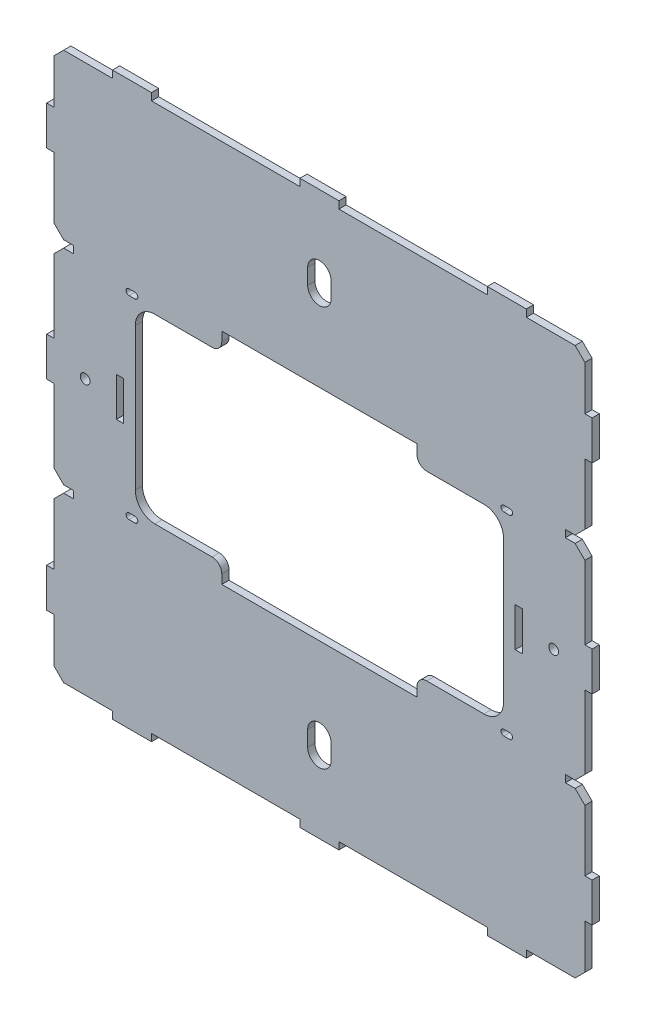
ISO-10303-21;
HEADER;
FILE_DESCRIPTION(('STEP AP214'),'2;1');
FILE_NAME('part.step','',(''),(''),'','','');
FILE_SCHEMA(('AUTOMOTIVE_DESIGN { 1 0 10303 214 1 1 1 1 }'));
ENDSEC;
DATA;
#1=APPLICATION_CONTEXT('core data for automotive mechanical design processes');
#2=APPLICATION_PROTOCOL_DEFINITION('international standard','automotive_design',2000,#1);
#3=PRODUCT_CONTEXT('',#1,'mechanical');
#4=PRODUCT('Part','Part','',(#3));
#5=PRODUCT_RELATED_PRODUCT_CATEGORY('part','',(#4));
#6=PRODUCT_DEFINITION_FORMATION('','',#4);
#7=PRODUCT_DEFINITION_CONTEXT('part definition',#1,'design');
#8=PRODUCT_DEFINITION('design','',#6,#7);
#9=PRODUCT_DEFINITION_SHAPE('','',#8);
#10=(LENGTH_UNIT() NAMED_UNIT(*) SI_UNIT(.MILLI.,.METRE.));
#11=(NAMED_UNIT(*) PLANE_ANGLE_UNIT() SI_UNIT($,.RADIAN.));
#12=(NAMED_UNIT(*) SI_UNIT($,.STERADIAN.) SOLID_ANGLE_UNIT());
#13=UNCERTAINTY_MEASURE_WITH_UNIT(LENGTH_MEASURE(1.E-05),#10,'distance_accuracy_value','');
#14=(GEOMETRIC_REPRESENTATION_CONTEXT(3) GLOBAL_UNCERTAINTY_ASSIGNED_CONTEXT((#13)) GLOBAL_UNIT_ASSIGNED_CONTEXT((#10,
#11,#12)) REPRESENTATION_CONTEXT('',''));
#15=CARTESIAN_POINT('',(0.,0.,0.));
#16=DIRECTION('',(0.,0.,1.));
#17=DIRECTION('',(1.,0.,0.));
#18=AXIS2_PLACEMENT_3D('',#15,#16,#17);
#19=CARTESIAN_POINT('',(0.,4.,3.7));
#20=DIRECTION('',(0.,0.,1.));
#21=DIRECTION('',(1.,0.,0.));
#22=AXIS2_PLACEMENT_3D('',#19,#20,#21);
#23=PLANE('',#22);
#24=DIRECTION('',(0.,-1.,0.));
#25=VECTOR('',#24,1.);
#26=CARTESIAN_POINT('',(-94.3,66.0000000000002,3.7));
#27=LINE('',#26,#25);
#28=CARTESIAN_POINT('',(-94.299999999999,139.000000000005,3.7));
#29=VERTEX_POINT('',#28);
#30=CARTESIAN_POINT('',(-94.3,66.0000000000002,3.7));
#31=VERTEX_POINT('',#30);
#32=EDGE_CURVE('E1390',#29,#31,#27,.T.);
#33=ORIENTED_EDGE('',*,*,#32,.F.);
#34=CARTESIAN_POINT('',(-84.299999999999,139.000000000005,3.7));
#35=DIRECTION('',(0.,0.,-1.));
#36=DIRECTION('',(1.,0.,0.));
#37=AXIS2_PLACEMENT_3D('',#34,#35,#36);
#38=CIRCLE('',#37,9.99999999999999);
#39=CARTESIAN_POINT('',(-84.2999999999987,149.000000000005,3.7));
#40=VERTEX_POINT('',#39);
#41=EDGE_CURVE('E932',#29,#40,#38,.T.);
#42=ORIENTED_EDGE('',*,*,#41,.T.);
#43=DIRECTION('',(1.,0.,0.));
#44=VECTOR('',#43,1.);
#45=CARTESIAN_POINT('',(-84.2999999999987,149.000000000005,3.7));
#46=LINE('',#45,#44);
#47=CARTESIAN_POINT('',(-54.9999999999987,149.000000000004,3.7));
#48=VERTEX_POINT('',#47);
#49=EDGE_CURVE('E934',#40,#48,#46,.T.);
#50=ORIENTED_EDGE('',*,*,#49,.T.);
#51=CARTESIAN_POINT('',(-54.9999999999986,154.000000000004,3.7));
#52=DIRECTION('',(0.,0.,1.));
#53=DIRECTION('',(1.,0.,0.));
#54=AXIS2_PLACEMENT_3D('',#51,#52,#53);
#55=CIRCLE('',#54,4.99999999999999);
#56=CARTESIAN_POINT('',(-49.9999999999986,154.000000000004,3.7));
#57=VERTEX_POINT('',#56);
#58=EDGE_CURVE('E936',#48,#57,#55,.T.);
#59=ORIENTED_EDGE('',*,*,#58,.T.);
#60=DIRECTION('',(0.,1.,0.));
#61=VECTOR('',#60,1.);
#62=CARTESIAN_POINT('',(-49.9999999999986,154.000000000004,3.7));
#63=LINE('',#62,#61);
#64=CARTESIAN_POINT('',(-49.9999999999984,158.700000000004,3.7));
#65=VERTEX_POINT('',#64);
#66=EDGE_CURVE('E938',#57,#65,#63,.T.);
#67=ORIENTED_EDGE('',*,*,#66,.T.);
#68=DIRECTION('',(-1.,0.,0.));
#69=VECTOR('',#68,1.);
#70=CARTESIAN_POINT('',(1.55982661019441E-12,158.700000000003,3.7));
#71=LINE('',#70,#69);
#72=CARTESIAN_POINT('',(50.0000000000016,158.700000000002,3.7));
#73=VERTEX_POINT('',#72);
#74=EDGE_CURVE('E1113',#73,#65,#71,.T.);
#75=ORIENTED_EDGE('',*,*,#74,.F.);
#76=DIRECTION('',(0.,1.,0.));
#77=VECTOR('',#76,1.);
#78=CARTESIAN_POINT('',(50.0000000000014,154.000000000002,3.7));
#79=LINE('',#78,#77);
#80=CARTESIAN_POINT('',(50.0000000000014,154.000000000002,3.7));
#81=VERTEX_POINT('',#80);
#82=EDGE_CURVE('E1115',#81,#73,#79,.T.);
#83=ORIENTED_EDGE('',*,*,#82,.F.);
#84=CARTESIAN_POINT('',(55.0000000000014,154.000000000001,3.7));
#85=DIRECTION('',(0.,0.,-1.));
#86=DIRECTION('',(-1.,0.,0.));
#87=AXIS2_PLACEMENT_3D('',#84,#85,#86);
#88=CIRCLE('',#87,4.99999999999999);
#89=CARTESIAN_POINT('',(55.0000000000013,149.000000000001,3.7));
#90=VERTEX_POINT('',#89);
#91=EDGE_CURVE('E1119',#90,#81,#88,.T.);
#92=ORIENTED_EDGE('',*,*,#91,.F.);
#93=DIRECTION('',(-1.,0.,0.));
#94=VECTOR('',#93,1.);
#95=CARTESIAN_POINT('',(84.3000000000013,149.,3.7));
#96=LINE('',#95,#94);
#97=CARTESIAN_POINT('',(84.3000000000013,149.,3.7));
#98=VERTEX_POINT('',#97);
#99=EDGE_CURVE('E1122',#98,#90,#96,.T.);
#100=ORIENTED_EDGE('',*,*,#99,.F.);
#101=CARTESIAN_POINT('',(84.300000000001,139.,3.7));
#102=DIRECTION('',(0.,0.,1.));
#103=DIRECTION('',(-1.,0.,0.));
#104=AXIS2_PLACEMENT_3D('',#101,#102,#103);
#105=CIRCLE('',#104,9.99999999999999);
#106=CARTESIAN_POINT('',(94.300000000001,139.,3.7));
#107=VERTEX_POINT('',#106);
#108=EDGE_CURVE('E1125',#107,#98,#105,.T.);
#109=ORIENTED_EDGE('',*,*,#108,.F.);
#110=DIRECTION('',(0.,-1.,0.));
#111=VECTOR('',#110,1.);
#112=CARTESIAN_POINT('',(94.3,66.0000000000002,3.7));
#113=LINE('',#112,#111);
#114=CARTESIAN_POINT('',(94.3,66.0000000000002,3.7));
#115=VERTEX_POINT('',#114);
#116=EDGE_CURVE('E1698',#107,#115,#113,.T.);
#117=ORIENTED_EDGE('',*,*,#116,.T.);
#118=CARTESIAN_POINT('',(84.3,66.0000000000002,3.7));
#119=DIRECTION('',(0.,0.,-1.));
#120=DIRECTION('',(-1.,0.,0.));
#121=AXIS2_PLACEMENT_3D('',#118,#119,#120);
#122=CIRCLE('',#121,9.99999999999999);
#123=CARTESIAN_POINT('',(84.3,56.0000000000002,3.7));
#124=VERTEX_POINT('',#123);
#125=EDGE_CURVE('E1700',#115,#124,#122,.T.);
#126=ORIENTED_EDGE('',*,*,#125,.T.);
#127=DIRECTION('',(-1.,0.,0.));
#128=VECTOR('',#127,1.);
#129=CARTESIAN_POINT('',(84.3,56.0000000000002,3.7));
#130=LINE('',#129,#128);
#131=CARTESIAN_POINT('',(55.,56.0000000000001,3.7));
#132=VERTEX_POINT('',#131);
#133=EDGE_CURVE('E1702',#124,#132,#130,.T.);
#134=ORIENTED_EDGE('',*,*,#133,.T.);
#135=CARTESIAN_POINT('',(55.,51.0000000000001,3.7));
#136=DIRECTION('',(0.,0.,1.));
#137=DIRECTION('',(-1.,0.,0.));
#138=AXIS2_PLACEMENT_3D('',#135,#136,#137);
#139=CIRCLE('',#138,4.99999999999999);
#140=CARTESIAN_POINT('',(50.,51.0000000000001,3.7));
#141=VERTEX_POINT('',#140);
#142=EDGE_CURVE('E1704',#132,#141,#139,.T.);
#143=ORIENTED_EDGE('',*,*,#142,.T.);
#144=DIRECTION('',(0.,-1.,0.));
#145=VECTOR('',#144,1.);
#146=CARTESIAN_POINT('',(50.,51.0000000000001,3.7));
#147=LINE('',#146,#145);
#148=CARTESIAN_POINT('',(50.,46.3,3.7));
#149=VERTEX_POINT('',#148);
#150=EDGE_CURVE('E1706',#141,#149,#147,.T.);
#151=ORIENTED_EDGE('',*,*,#150,.T.);
#152=DIRECTION('',(-1.,0.,0.));
#153=VECTOR('',#152,1.);
#154=CARTESIAN_POINT('',(0.,46.3,3.7));
#155=LINE('',#154,#153);
#156=CARTESIAN_POINT('',(-50.,46.3,3.7));
#157=VERTEX_POINT('',#156);
#158=EDGE_CURVE('E1708',#149,#157,#155,.T.);
#159=ORIENTED_EDGE('',*,*,#158,.T.);
#160=DIRECTION('',(0.,-1.,0.));
#161=VECTOR('',#160,1.);
#162=CARTESIAN_POINT('',(-50.,51.0000000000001,3.7));
#163=LINE('',#162,#161);
#164=CARTESIAN_POINT('',(-50.,51.0000000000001,3.7));
#165=VERTEX_POINT('',#164);
#166=EDGE_CURVE('E1377',#165,#157,#163,.T.);
#167=ORIENTED_EDGE('',*,*,#166,.F.);
#168=CARTESIAN_POINT('',(-55.,51.0000000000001,3.7));
#169=DIRECTION('',(0.,0.,-1.));
#170=DIRECTION('',(1.,0.,0.));
#171=AXIS2_PLACEMENT_3D('',#168,#169,#170);
#172=CIRCLE('',#171,4.99999999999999);
#173=CARTESIAN_POINT('',(-55.,56.0000000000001,3.7));
#174=VERTEX_POINT('',#173);
#175=EDGE_CURVE('E1380',#174,#165,#172,.T.);
#176=ORIENTED_EDGE('',*,*,#175,.F.);
#177=DIRECTION('',(1.,0.,0.));
#178=VECTOR('',#177,1.);
#179=CARTESIAN_POINT('',(-84.3,56.0000000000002,3.7));
#180=LINE('',#179,#178);
#181=CARTESIAN_POINT('',(-84.3,56.0000000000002,3.7));
#182=VERTEX_POINT('',#181);
#183=EDGE_CURVE('E1384',#182,#174,#180,.T.);
#184=ORIENTED_EDGE('',*,*,#183,.F.);
#185=CARTESIAN_POINT('',(-84.3,66.0000000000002,3.7));
#186=DIRECTION('',(0.,0.,1.));
#187=DIRECTION('',(1.,0.,0.));
#188=AXIS2_PLACEMENT_3D('',#185,#186,#187);
#189=CIRCLE('',#188,9.99999999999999);
#190=EDGE_CURVE('E1387',#31,#182,#189,.T.);
#191=ORIENTED_EDGE('',*,*,#190,.F.);
#192=EDGE_LOOP('',(#33,#42,#50,#59,#67,#75,#83,#92,#100,#109,#117,#126,#134,#143,#151,#159,#167,
#176,#184,#191));
#193=FACE_BOUND('',#192,.T.);
#194=DIRECTION('',(0.,-1.,0.));
#195=VECTOR('',#194,1.);
#196=CARTESIAN_POINT('',(-104.,92.5000000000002,3.7));
#197=LINE('',#196,#195);
#198=CARTESIAN_POINT('',(-104.,112.500000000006,3.7));
#199=VERTEX_POINT('',#198);
#200=CARTESIAN_POINT('',(-104.,92.5000000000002,3.7));
#201=VERTEX_POINT('',#200);
#202=EDGE_CURVE('E1398',#199,#201,#197,.T.);
#203=ORIENTED_EDGE('',*,*,#202,.F.);
#204=DIRECTION('',(1.,0.,0.));
#205=VECTOR('',#204,1.);
#206=CARTESIAN_POINT('',(-100.3,112.500000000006,3.7));
#207=LINE('',#206,#205);
#208=CARTESIAN_POINT('',(-100.3,112.500000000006,3.7));
#209=VERTEX_POINT('',#208);
#210=EDGE_CURVE('E929',#199,#209,#207,.T.);
#211=ORIENTED_EDGE('',*,*,#210,.T.);
#212=DIRECTION('',(0.,1.,0.));
#213=VECTOR('',#212,1.);
#214=CARTESIAN_POINT('',(-100.3,92.5000000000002,3.7));
#215=LINE('',#214,#213);
#216=CARTESIAN_POINT('',(-100.3,92.5000000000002,3.7));
#217=VERTEX_POINT('',#216);
#218=EDGE_CURVE('E1393',#217,#209,#215,.T.);
#219=ORIENTED_EDGE('',*,*,#218,.F.);
#220=DIRECTION('',(1.,0.,0.));
#221=VECTOR('',#220,1.);
#222=CARTESIAN_POINT('',(-100.3,92.5000000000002,3.7));
#223=LINE('',#222,#221);
#224=EDGE_CURVE('E1395',#201,#217,#223,.T.);
#225=ORIENTED_EDGE('',*,*,#224,.F.);
#226=EDGE_LOOP('',(#203,#211,#219,#225));
#227=FACE_BOUND('',#226,.T.);
#228=CARTESIAN_POINT('',(-120.,102.5,3.7));
#229=DIRECTION('',(0.,0.,1.));
#230=DIRECTION('',(-1.,0.,0.));
#231=AXIS2_PLACEMENT_3D('',#228,#229,#230);
#232=CIRCLE('',#231,2.5);
#233=CARTESIAN_POINT('',(-122.5,102.5,3.7));
#234=VERTEX_POINT('',#233);
#235=EDGE_CURVE('E1401',#234,#234,#232,.T.);
#236=ORIENTED_EDGE('',*,*,#235,.F.);
#237=EDGE_LOOP('',(#236));
#238=FACE_BOUND('',#237,.T.);
#239=CARTESIAN_POINT('',(2.73392419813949E-12,201.000000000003,3.7));
#240=DIRECTION('',(0.,0.,1.));
#241=DIRECTION('',(1.,0.,0.));
#242=AXIS2_PLACEMENT_3D('',#239,#240,#241);
#243=CIRCLE('',#242,6.);
#244=CARTESIAN_POINT('',(-5.99999999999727,201.000000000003,3.7));
#245=VERTEX_POINT('',#244);
#246=CARTESIAN_POINT('',(6.00000000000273,201.000000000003,3.7));
#247=VERTEX_POINT('',#246);
#248=EDGE_CURVE('E1196',#245,#247,#243,.T.);
#249=ORIENTED_EDGE('',*,*,#248,.F.);
#250=DIRECTION('',(0.,1.,0.));
#251=VECTOR('',#250,1.);
#252=CARTESIAN_POINT('',(-5.99999999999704,209.000000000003,3.7));
#253=LINE('',#252,#251);
#254=CARTESIAN_POINT('',(-5.99999999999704,209.000000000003,3.7));
#255=VERTEX_POINT('',#254);
#256=EDGE_CURVE('E886',#245,#255,#253,.T.);
#257=ORIENTED_EDGE('',*,*,#256,.T.);
#258=CARTESIAN_POINT('',(2.95596880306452E-12,209.000000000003,3.7));
#259=DIRECTION('',(0.,0.,1.));
#260=DIRECTION('',(1.,0.,0.));
#261=AXIS2_PLACEMENT_3D('',#258,#259,#260);
#262=CIRCLE('',#261,6.);
#263=CARTESIAN_POINT('',(6.00000000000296,209.000000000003,3.7));
#264=VERTEX_POINT('',#263);
#265=EDGE_CURVE('E1191',#264,#255,#262,.T.);
#266=ORIENTED_EDGE('',*,*,#265,.F.);
#267=DIRECTION('',(0.,1.,0.));
#268=VECTOR('',#267,1.);
#269=CARTESIAN_POINT('',(6.00000000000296,209.000000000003,3.7));
#270=LINE('',#269,#268);
#271=EDGE_CURVE('E1193',#247,#264,#270,.T.);
#272=ORIENTED_EDGE('',*,*,#271,.F.);
#273=EDGE_LOOP('',(#249,#257,#266,#272));
#274=FACE_BOUND('',#273,.T.);
#275=CARTESIAN_POINT('',(120.,102.5,3.7));
#276=DIRECTION('',(0.,0.,-1.));
#277=DIRECTION('',(1.,0.,0.));
#278=AXIS2_PLACEMENT_3D('',#275,#276,#277);
#279=CIRCLE('',#278,2.5);
#280=CARTESIAN_POINT('',(122.5,102.5,3.7));
#281=VERTEX_POINT('',#280);
#282=EDGE_CURVE('E1689',#281,#281,#279,.T.);
#283=ORIENTED_EDGE('',*,*,#282,.T.);
#284=EDGE_LOOP('',(#283));
#285=FACE_BOUND('',#284,.T.);
#286=DIRECTION('',(-1.,0.,0.));
#287=VECTOR('',#286,1.);
#288=CARTESIAN_POINT('',(100.3,112.5,3.7));
#289=LINE('',#288,#287);
#290=CARTESIAN_POINT('',(104.,112.5,3.7));
#291=VERTEX_POINT('',#290);
#292=CARTESIAN_POINT('',(100.3,112.5,3.7));
#293=VERTEX_POINT('',#292);
#294=EDGE_CURVE('E1128',#291,#293,#289,.T.);
#295=ORIENTED_EDGE('',*,*,#294,.F.);
#296=DIRECTION('',(0.,-1.,0.));
#297=VECTOR('',#296,1.);
#298=CARTESIAN_POINT('',(104.,92.5000000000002,3.7));
#299=LINE('',#298,#297);
#300=CARTESIAN_POINT('',(104.,92.5000000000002,3.7));
#301=VERTEX_POINT('',#300);
#302=EDGE_CURVE('E1692',#291,#301,#299,.T.);
#303=ORIENTED_EDGE('',*,*,#302,.T.);
#304=DIRECTION('',(-1.,0.,0.));
#305=VECTOR('',#304,1.);
#306=CARTESIAN_POINT('',(100.3,92.5000000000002,3.7));
#307=LINE('',#306,#305);
#308=CARTESIAN_POINT('',(100.3,92.5000000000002,3.7));
#309=VERTEX_POINT('',#308);
#310=EDGE_CURVE('E1694',#301,#309,#307,.T.);
#311=ORIENTED_EDGE('',*,*,#310,.T.);
#312=DIRECTION('',(0.,1.,0.));
#313=VECTOR('',#312,1.);
#314=CARTESIAN_POINT('',(100.3,92.5000000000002,3.7));
#315=LINE('',#314,#313);
#316=EDGE_CURVE('E1696',#309,#293,#315,.T.);
#317=ORIENTED_EDGE('',*,*,#316,.T.);
#318=EDGE_LOOP('',(#295,#303,#311,#317));
#319=FACE_BOUND('',#318,.T.);
#320=DIRECTION('',(0.,-1.,0.));
#321=VECTOR('',#320,1.);
#322=CARTESIAN_POINT('',(-6.,-4.,3.7));
#323=LINE('',#322,#321);
#324=CARTESIAN_POINT('',(-6.,4.,3.7));
#325=VERTEX_POINT('',#324);
#326=CARTESIAN_POINT('',(-6.,-4.,3.7));
#327=VERTEX_POINT('',#326);
#328=EDGE_CURVE('E1463',#325,#327,#323,.T.);
#329=ORIENTED_EDGE('',*,*,#328,.F.);
#330=CARTESIAN_POINT('',(0.,4.,3.7));
#331=DIRECTION('',(0.,0.,-1.));
#332=DIRECTION('',(1.,0.,0.));
#333=AXIS2_PLACEMENT_3D('',#330,#331,#332);
#334=CIRCLE('',#333,6.);
#335=CARTESIAN_POINT('',(6.,4.,3.7));
#336=VERTEX_POINT('',#335);
#337=EDGE_CURVE('E1640',#325,#336,#334,.T.);
#338=ORIENTED_EDGE('',*,*,#337,.T.);
#339=DIRECTION('',(0.,-1.,0.));
#340=VECTOR('',#339,1.);
#341=CARTESIAN_POINT('',(6.,-4.,3.7));
#342=LINE('',#341,#340);
#343=CARTESIAN_POINT('',(6.,-4.,3.7));
#344=VERTEX_POINT('',#343);
#345=EDGE_CURVE('E1642',#336,#344,#342,.T.);
#346=ORIENTED_EDGE('',*,*,#345,.T.);
#347=CARTESIAN_POINT('',(0.,-4.,3.7));
#348=DIRECTION('',(0.,0.,-1.));
#349=DIRECTION('',(1.,0.,0.));
#350=AXIS2_PLACEMENT_3D('',#347,#348,#349);
#351=CIRCLE('',#350,6.);
#352=EDGE_CURVE('E1645',#344,#327,#351,.T.);
#353=ORIENTED_EDGE('',*,*,#352,.T.);
#354=EDGE_LOOP('',(#329,#338,#346,#353));
#355=FACE_BOUND('',#354,.T.);
#356=DIRECTION('',(-1.,0.,0.));
#357=VECTOR('',#356,1.);
#358=CARTESIAN_POINT('',(-136.,112.500000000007,3.7));
#359=LINE('',#358,#357);
#360=CARTESIAN_POINT('',(-136.,112.500000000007,3.7));
#361=VERTEX_POINT('',#360);
#362=CARTESIAN_POINT('',(-139.7,112.500000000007,3.7));
#363=VERTEX_POINT('',#362);
#364=EDGE_CURVE('E926',#361,#363,#359,.T.);
#365=ORIENTED_EDGE('',*,*,#364,.T.);
#366=DIRECTION('',(0.,1.,0.));
#367=VECTOR('',#366,1.);
#368=CARTESIAN_POINT('',(-139.7,92.5000000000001,3.7));
#369=LINE('',#368,#367);
#370=CARTESIAN_POINT('',(-139.7,92.5000000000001,3.7));
#371=VERTEX_POINT('',#370);
#372=EDGE_CURVE('E1404',#371,#363,#369,.T.);
#373=ORIENTED_EDGE('',*,*,#372,.F.);
#374=DIRECTION('',(-1.,0.,0.));
#375=VECTOR('',#374,1.);
#376=CARTESIAN_POINT('',(-136.,92.5,3.7));
#377=LINE('',#376,#375);
#378=CARTESIAN_POINT('',(-136.,92.5,3.7));
#379=VERTEX_POINT('',#378);
#380=EDGE_CURVE('E1406',#379,#371,#377,.T.);
#381=ORIENTED_EDGE('',*,*,#380,.F.);
#382=DIRECTION('',(0.,1.,0.));
#383=VECTOR('',#382,1.);
#384=CARTESIAN_POINT('',(-136.,55.,3.7));
#385=LINE('',#384,#383);
#386=CARTESIAN_POINT('',(-136.,55.,3.7));
#387=VERTEX_POINT('',#386);
#388=EDGE_CURVE('E1409',#387,#379,#385,.T.);
#389=ORIENTED_EDGE('',*,*,#388,.F.);
#390=DIRECTION('',(-0.707106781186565,0.70710678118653,0.));
#391=VECTOR('',#390,1.);
#392=CARTESIAN_POINT('',(-131.,50.0000000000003,3.7));
#393=LINE('',#392,#391);
#394=CARTESIAN_POINT('',(-131.,50.0000000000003,3.7));
#395=VERTEX_POINT('',#394);
#396=EDGE_CURVE('E1412',#395,#387,#393,.T.);
#397=ORIENTED_EDGE('',*,*,#396,.F.);
#398=DIRECTION('',(-1.,0.,0.));
#399=VECTOR('',#398,1.);
#400=CARTESIAN_POINT('',(-126.,50.,3.7));
#401=LINE('',#400,#399);
#402=CARTESIAN_POINT('',(-126.,50.,3.7));
#403=VERTEX_POINT('',#402);
#404=EDGE_CURVE('E1415',#403,#395,#401,.T.);
#405=ORIENTED_EDGE('',*,*,#404,.F.);
#406=DIRECTION('',(0.,1.,0.));
#407=VECTOR('',#406,1.);
#408=CARTESIAN_POINT('',(-126.,46.3,3.7));
#409=LINE('',#408,#407);
#410=CARTESIAN_POINT('',(-126.,46.3,3.7));
#411=VERTEX_POINT('',#410);
#412=EDGE_CURVE('E1418',#411,#403,#409,.T.);
#413=ORIENTED_EDGE('',*,*,#412,.F.);
#414=DIRECTION('',(1.,0.,0.));
#415=VECTOR('',#414,1.);
#416=CARTESIAN_POINT('',(-126.,46.3,3.7));
#417=LINE('',#416,#415);
#418=CARTESIAN_POINT('',(-131.,46.3,3.7));
#419=VERTEX_POINT('',#418);
#420=EDGE_CURVE('E1421',#419,#411,#417,.T.);
#421=ORIENTED_EDGE('',*,*,#420,.F.);
#422=DIRECTION('',(0.707106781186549,0.707106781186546,0.));
#423=VECTOR('',#422,1.);
#424=CARTESIAN_POINT('',(-131.,46.3,3.7));
#425=LINE('',#424,#423);
#426=CARTESIAN_POINT('',(-136.,41.3,3.7));
#427=VERTEX_POINT('',#426);
#428=EDGE_CURVE('E1424',#427,#419,#425,.T.);
#429=ORIENTED_EDGE('',*,*,#428,.F.);
#430=DIRECTION('',(0.,1.,0.));
#431=VECTOR('',#430,1.);
#432=CARTESIAN_POINT('',(-136.,41.3,3.7));
#433=LINE('',#432,#431);
#434=CARTESIAN_POINT('',(-136.,10.,3.7));
#435=VERTEX_POINT('',#434);
#436=EDGE_CURVE('E1427',#435,#427,#433,.T.);
#437=ORIENTED_EDGE('',*,*,#436,.F.);
#438=DIRECTION('',(1.,0.,0.));
#439=VECTOR('',#438,1.);
#440=CARTESIAN_POINT('',(-136.,10.,3.7));
#441=LINE('',#440,#439);
#442=CARTESIAN_POINT('',(-139.7,10.,3.7));
#443=VERTEX_POINT('',#442);
#444=EDGE_CURVE('E1430',#443,#435,#441,.T.);
#445=ORIENTED_EDGE('',*,*,#444,.F.);
#446=DIRECTION('',(0.,1.,0.));
#447=VECTOR('',#446,1.);
#448=CARTESIAN_POINT('',(-139.7,10.,3.7));
#449=LINE('',#448,#447);
#450=CARTESIAN_POINT('',(-139.7,-10.,3.7));
#451=VERTEX_POINT('',#450);
#452=EDGE_CURVE('E1433',#451,#443,#449,.T.);
#453=ORIENTED_EDGE('',*,*,#452,.F.);
#454=DIRECTION('',(-1.,0.,0.));
#455=VECTOR('',#454,1.);
#456=CARTESIAN_POINT('',(-136.,-10.,3.7));
#457=LINE('',#456,#455);
#458=CARTESIAN_POINT('',(-136.,-10.,3.7));
#459=VERTEX_POINT('',#458);
#460=EDGE_CURVE('E1436',#459,#451,#457,.T.);
#461=ORIENTED_EDGE('',*,*,#460,.F.);
#462=DIRECTION('',(0.,1.,0.));
#463=VECTOR('',#462,1.);
#464=CARTESIAN_POINT('',(-136.,-10.,3.7));
#465=LINE('',#464,#463);
#466=CARTESIAN_POINT('',(-136.,-32.7999999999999,3.7));
#467=VERTEX_POINT('',#466);
#468=EDGE_CURVE('E1439',#467,#459,#465,.T.);
#469=ORIENTED_EDGE('',*,*,#468,.F.);
#470=DIRECTION('',(-0.707106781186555,0.70710678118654,0.));
#471=VECTOR('',#470,1.);
#472=CARTESIAN_POINT('',(-131.,-37.7999999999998,3.7));
#473=LINE('',#472,#471);
#474=CARTESIAN_POINT('',(-131.,-37.7999999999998,3.7));
#475=VERTEX_POINT('',#474);
#476=EDGE_CURVE('E1442',#475,#467,#473,.T.);
#477=ORIENTED_EDGE('',*,*,#476,.F.);
#478=DIRECTION('',(-1.,0.,0.));
#479=VECTOR('',#478,1.);
#480=CARTESIAN_POINT('',(-106.,-37.7999999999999,3.7));
#481=LINE('',#480,#479);
#482=CARTESIAN_POINT('',(-106.,-37.7999999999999,3.7));
#483=VERTEX_POINT('',#482);
#484=EDGE_CURVE('E1445',#483,#475,#481,.T.);
#485=ORIENTED_EDGE('',*,*,#484,.F.);
#486=DIRECTION('',(0.,1.,0.));
#487=VECTOR('',#486,1.);
#488=CARTESIAN_POINT('',(-106.,-37.7999999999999,3.7));
#489=LINE('',#488,#487);
#490=CARTESIAN_POINT('',(-106.,-41.5,3.7));
#491=VERTEX_POINT('',#490);
#492=EDGE_CURVE('E1448',#491,#483,#489,.T.);
#493=ORIENTED_EDGE('',*,*,#492,.F.);
#494=DIRECTION('',(-1.,0.,0.));
#495=VECTOR('',#494,1.);
#496=CARTESIAN_POINT('',(-86.,-41.5,3.7));
#497=LINE('',#496,#495);
#498=CARTESIAN_POINT('',(-86.,-41.5,3.7));
#499=VERTEX_POINT('',#498);
#500=EDGE_CURVE('E1451',#499,#491,#497,.T.);
#501=ORIENTED_EDGE('',*,*,#500,.F.);
#502=DIRECTION('',(0.,-1.,0.));
#503=VECTOR('',#502,1.);
#504=CARTESIAN_POINT('',(-86.,-37.7999999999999,3.7));
#505=LINE('',#504,#503);
#506=CARTESIAN_POINT('',(-86.,-37.7999999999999,3.7));
#507=VERTEX_POINT('',#506);
#508=EDGE_CURVE('E1454',#507,#499,#505,.T.);
#509=ORIENTED_EDGE('',*,*,#508,.F.);
#510=DIRECTION('',(-1.,0.,0.));
#511=VECTOR('',#510,1.);
#512=CARTESIAN_POINT('',(-10.,-37.7999999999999,3.7));
#513=LINE('',#512,#511);
#514=CARTESIAN_POINT('',(-10.,-37.7999999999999,3.7));
#515=VERTEX_POINT('',#514);
#516=EDGE_CURVE('E1457',#515,#507,#513,.T.);
#517=ORIENTED_EDGE('',*,*,#516,.F.);
#518=DIRECTION('',(0.,1.,0.));
#519=VECTOR('',#518,1.);
#520=CARTESIAN_POINT('',(-10.,-41.5,3.7));
#521=LINE('',#520,#519);
#522=CARTESIAN_POINT('',(-10.,-41.5,3.7));
#523=VERTEX_POINT('',#522);
#524=EDGE_CURVE('E1460',#523,#515,#521,.T.);
#525=ORIENTED_EDGE('',*,*,#524,.F.);
#526=DIRECTION('',(1.,0.,0.));
#527=VECTOR('',#526,1.);
#528=CARTESIAN_POINT('',(0.,-41.5,3.7));
#529=LINE('',#528,#527);
#530=CARTESIAN_POINT('',(10.,-41.5,3.7));
#531=VERTEX_POINT('',#530);
#532=EDGE_CURVE('E1647',#523,#531,#529,.T.);
#533=ORIENTED_EDGE('',*,*,#532,.T.);
#534=DIRECTION('',(0.,1.,0.));
#535=VECTOR('',#534,1.);
#536=CARTESIAN_POINT('',(10.,-41.5,3.7));
#537=LINE('',#536,#535);
#538=CARTESIAN_POINT('',(10.,-37.7999999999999,3.7));
#539=VERTEX_POINT('',#538);
#540=EDGE_CURVE('E1649',#531,#539,#537,.T.);
#541=ORIENTED_EDGE('',*,*,#540,.T.);
#542=DIRECTION('',(1.,0.,0.));
#543=VECTOR('',#542,1.);
#544=CARTESIAN_POINT('',(10.,-37.7999999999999,3.7));
#545=LINE('',#544,#543);
#546=CARTESIAN_POINT('',(86.,-37.7999999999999,3.7));
#547=VERTEX_POINT('',#546);
#548=EDGE_CURVE('E1651',#539,#547,#545,.T.);
#549=ORIENTED_EDGE('',*,*,#548,.T.);
#550=DIRECTION('',(0.,-1.,0.));
#551=VECTOR('',#550,1.);
#552=CARTESIAN_POINT('',(86.,-37.7999999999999,3.7));
#553=LINE('',#552,#551);
#554=CARTESIAN_POINT('',(86.,-41.5,3.7));
#555=VERTEX_POINT('',#554);
#556=EDGE_CURVE('E1653',#547,#555,#553,.T.);
#557=ORIENTED_EDGE('',*,*,#556,.T.);
#558=DIRECTION('',(1.,0.,0.));
#559=VECTOR('',#558,1.);
#560=CARTESIAN_POINT('',(86.,-41.5,3.7));
#561=LINE('',#560,#559);
#562=CARTESIAN_POINT('',(106.,-41.5,3.7));
#563=VERTEX_POINT('',#562);
#564=EDGE_CURVE('E1655',#555,#563,#561,.T.);
#565=ORIENTED_EDGE('',*,*,#564,.T.);
#566=DIRECTION('',(0.,1.,0.));
#567=VECTOR('',#566,1.);
#568=CARTESIAN_POINT('',(106.,-37.7999999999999,3.7));
#569=LINE('',#568,#567);
#570=CARTESIAN_POINT('',(106.,-37.7999999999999,3.7));
#571=VERTEX_POINT('',#570);
#572=EDGE_CURVE('E1657',#563,#571,#569,.T.);
#573=ORIENTED_EDGE('',*,*,#572,.T.);
#574=DIRECTION('',(1.,0.,0.));
#575=VECTOR('',#574,1.);
#576=CARTESIAN_POINT('',(106.,-37.7999999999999,3.7));
#577=LINE('',#576,#575);
#578=CARTESIAN_POINT('',(131.,-37.7999999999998,3.7));
#579=VERTEX_POINT('',#578);
#580=EDGE_CURVE('E1659',#571,#579,#577,.T.);
#581=ORIENTED_EDGE('',*,*,#580,.T.);
#582=DIRECTION('',(0.707106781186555,0.70710678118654,0.));
#583=VECTOR('',#582,1.);
#584=CARTESIAN_POINT('',(131.,-37.7999999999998,3.7));
#585=LINE('',#584,#583);
#586=CARTESIAN_POINT('',(136.,-32.7999999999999,3.7));
#587=VERTEX_POINT('',#586);
#588=EDGE_CURVE('E1661',#579,#587,#585,.T.);
#589=ORIENTED_EDGE('',*,*,#588,.T.);
#590=DIRECTION('',(0.,1.,0.));
#591=VECTOR('',#590,1.);
#592=CARTESIAN_POINT('',(136.,-10.,3.7));
#593=LINE('',#592,#591);
#594=CARTESIAN_POINT('',(136.,-10.,3.7));
#595=VERTEX_POINT('',#594);
#596=EDGE_CURVE('E1663',#587,#595,#593,.T.);
#597=ORIENTED_EDGE('',*,*,#596,.T.);
#598=DIRECTION('',(1.,0.,0.));
#599=VECTOR('',#598,1.);
#600=CARTESIAN_POINT('',(136.,-10.,3.7));
#601=LINE('',#600,#599);
#602=CARTESIAN_POINT('',(139.7,-10.,3.7));
#603=VERTEX_POINT('',#602);
#604=EDGE_CURVE('E1665',#595,#603,#601,.T.);
#605=ORIENTED_EDGE('',*,*,#604,.T.);
#606=DIRECTION('',(0.,1.,0.));
#607=VECTOR('',#606,1.);
#608=CARTESIAN_POINT('',(139.7,10.,3.7));
#609=LINE('',#608,#607);
#610=CARTESIAN_POINT('',(139.7,10.,3.7));
#611=VERTEX_POINT('',#610);
#612=EDGE_CURVE('E1667',#603,#611,#609,.T.);
#613=ORIENTED_EDGE('',*,*,#612,.T.);
#614=DIRECTION('',(-1.,0.,0.));
#615=VECTOR('',#614,1.);
#616=CARTESIAN_POINT('',(136.,10.,3.7));
#617=LINE('',#616,#615);
#618=CARTESIAN_POINT('',(136.,10.,3.7));
#619=VERTEX_POINT('',#618);
#620=EDGE_CURVE('E1669',#611,#619,#617,.T.);
#621=ORIENTED_EDGE('',*,*,#620,.T.);
#622=DIRECTION('',(0.,1.,0.));
#623=VECTOR('',#622,1.);
#624=CARTESIAN_POINT('',(136.,41.3,3.7));
#625=LINE('',#624,#623);
#626=CARTESIAN_POINT('',(136.,41.3,3.7));
#627=VERTEX_POINT('',#626);
#628=EDGE_CURVE('E1671',#619,#627,#625,.T.);
#629=ORIENTED_EDGE('',*,*,#628,.T.);
#630=DIRECTION('',(-0.707106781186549,0.707106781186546,0.));
#631=VECTOR('',#630,1.);
#632=CARTESIAN_POINT('',(131.,46.3,3.7));
#633=LINE('',#632,#631);
#634=CARTESIAN_POINT('',(131.,46.3,3.7));
#635=VERTEX_POINT('',#634);
#636=EDGE_CURVE('E1673',#627,#635,#633,.T.);
#637=ORIENTED_EDGE('',*,*,#636,.T.);
#638=DIRECTION('',(-1.,0.,0.));
#639=VECTOR('',#638,1.);
#640=CARTESIAN_POINT('',(126.,46.3,3.7));
#641=LINE('',#640,#639);
#642=CARTESIAN_POINT('',(126.,46.3,3.7));
#643=VERTEX_POINT('',#642);
#644=EDGE_CURVE('E1675',#635,#643,#641,.T.);
#645=ORIENTED_EDGE('',*,*,#644,.T.);
#646=DIRECTION('',(0.,1.,0.));
#647=VECTOR('',#646,1.);
#648=CARTESIAN_POINT('',(126.,46.3,3.7));
#649=LINE('',#648,#647);
#650=CARTESIAN_POINT('',(126.,50.,3.7));
#651=VERTEX_POINT('',#650);
#652=EDGE_CURVE('E1677',#643,#651,#649,.T.);
#653=ORIENTED_EDGE('',*,*,#652,.T.);
#654=DIRECTION('',(1.,0.,0.));
#655=VECTOR('',#654,1.);
#656=CARTESIAN_POINT('',(126.,50.,3.7));
#657=LINE('',#656,#655);
#658=CARTESIAN_POINT('',(131.,50.0000000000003,3.7));
#659=VERTEX_POINT('',#658);
#660=EDGE_CURVE('E1679',#651,#659,#657,.T.);
#661=ORIENTED_EDGE('',*,*,#660,.T.);
#662=DIRECTION('',(0.707106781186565,0.70710678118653,0.));
#663=VECTOR('',#662,1.);
#664=CARTESIAN_POINT('',(131.,50.0000000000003,3.7));
#665=LINE('',#664,#663);
#666=CARTESIAN_POINT('',(136.,55.,3.7));
#667=VERTEX_POINT('',#666);
#668=EDGE_CURVE('E1681',#659,#667,#665,.T.);
#669=ORIENTED_EDGE('',*,*,#668,.T.);
#670=DIRECTION('',(0.,1.,0.));
#671=VECTOR('',#670,1.);
#672=CARTESIAN_POINT('',(136.,55.,3.7));
#673=LINE('',#672,#671);
#674=CARTESIAN_POINT('',(136.,92.5,3.7));
#675=VERTEX_POINT('',#674);
#676=EDGE_CURVE('E1683',#667,#675,#673,.T.);
#677=ORIENTED_EDGE('',*,*,#676,.T.);
#678=DIRECTION('',(1.,0.,0.));
#679=VECTOR('',#678,1.);
#680=CARTESIAN_POINT('',(136.,92.5,3.7));
#681=LINE('',#680,#679);
#682=CARTESIAN_POINT('',(139.7,92.5000000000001,3.7));
#683=VERTEX_POINT('',#682);
#684=EDGE_CURVE('E1685',#675,#683,#681,.T.);
#685=ORIENTED_EDGE('',*,*,#684,.T.);
#686=DIRECTION('',(0.,1.,0.));
#687=VECTOR('',#686,1.);
#688=CARTESIAN_POINT('',(139.7,92.5000000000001,3.7));
#689=LINE('',#688,#687);
#690=CARTESIAN_POINT('',(139.7,112.499999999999,3.7));
#691=VERTEX_POINT('',#690);
#692=EDGE_CURVE('E1687',#683,#691,#689,.T.);
#693=ORIENTED_EDGE('',*,*,#692,.T.);
#694=DIRECTION('',(1.,0.,0.));
#695=VECTOR('',#694,1.);
#696=CARTESIAN_POINT('',(136.,112.499999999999,3.7));
#697=LINE('',#696,#695);
#698=CARTESIAN_POINT('',(136.,112.499999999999,3.7));
#699=VERTEX_POINT('',#698);
#700=EDGE_CURVE('E1131',#699,#691,#697,.T.);
#701=ORIENTED_EDGE('',*,*,#700,.F.);
#702=DIRECTION('',(0.,-1.,0.));
#703=VECTOR('',#702,1.);
#704=CARTESIAN_POINT('',(136.000000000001,149.999999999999,3.7));
#705=LINE('',#704,#703);
#706=CARTESIAN_POINT('',(136.000000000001,149.999999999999,3.7));
#707=VERTEX_POINT('',#706);
#708=EDGE_CURVE('E1134',#707,#699,#705,.T.);
#709=ORIENTED_EDGE('',*,*,#708,.F.);
#710=DIRECTION('',(0.707106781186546,-0.70710678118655,0.));
#711=VECTOR('',#710,1.);
#712=CARTESIAN_POINT('',(131.000000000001,154.999999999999,3.7));
#713=LINE('',#712,#711);
#714=CARTESIAN_POINT('',(131.000000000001,154.999999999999,3.7));
#715=VERTEX_POINT('',#714);
#716=EDGE_CURVE('E1137',#715,#707,#713,.T.);
#717=ORIENTED_EDGE('',*,*,#716,.F.);
#718=DIRECTION('',(1.,0.,0.));
#719=VECTOR('',#718,1.);
#720=CARTESIAN_POINT('',(126.000000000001,155.,3.7));
#721=LINE('',#720,#719);
#722=CARTESIAN_POINT('',(126.000000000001,155.,3.7));
#723=VERTEX_POINT('',#722);
#724=EDGE_CURVE('E1140',#723,#715,#721,.T.);
#725=ORIENTED_EDGE('',*,*,#724,.F.);
#726=DIRECTION('',(0.,-1.,0.));
#727=VECTOR('',#726,1.);
#728=CARTESIAN_POINT('',(126.000000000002,158.7,3.7));
#729=LINE('',#728,#727);
#730=CARTESIAN_POINT('',(126.000000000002,158.7,3.7));
#731=VERTEX_POINT('',#730);
#732=EDGE_CURVE('E1143',#731,#723,#729,.T.);
#733=ORIENTED_EDGE('',*,*,#732,.F.);
#734=DIRECTION('',(-1.,0.,0.));
#735=VECTOR('',#734,1.);
#736=CARTESIAN_POINT('',(126.000000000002,158.7,3.7));
#737=LINE('',#736,#735);
#738=CARTESIAN_POINT('',(131.000000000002,158.699999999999,3.7));
#739=VERTEX_POINT('',#738);
#740=EDGE_CURVE('E1146',#739,#731,#737,.T.);
#741=ORIENTED_EDGE('',*,*,#740,.F.);
#742=DIRECTION('',(-0.707106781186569,-0.707106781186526,0.));
#743=VECTOR('',#742,1.);
#744=CARTESIAN_POINT('',(131.000000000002,158.699999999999,3.7));
#745=LINE('',#744,#743);
#746=CARTESIAN_POINT('',(136.000000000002,163.699999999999,3.7));
#747=VERTEX_POINT('',#746);
#748=EDGE_CURVE('E1149',#747,#739,#745,.T.);
#749=ORIENTED_EDGE('',*,*,#748,.F.);
#750=DIRECTION('',(0.,-1.,0.));
#751=VECTOR('',#750,1.);
#752=CARTESIAN_POINT('',(136.000000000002,163.699999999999,3.7));
#753=LINE('',#752,#751);
#754=CARTESIAN_POINT('',(136.000000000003,194.999999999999,3.7));
#755=VERTEX_POINT('',#754);
#756=EDGE_CURVE('E1152',#755,#747,#753,.T.);
#757=ORIENTED_EDGE('',*,*,#756,.F.);
#758=DIRECTION('',(-1.,0.,0.));
#759=VECTOR('',#758,1.);
#760=CARTESIAN_POINT('',(136.000000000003,194.999999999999,3.7));
#761=LINE('',#760,#759);
#762=CARTESIAN_POINT('',(139.700000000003,194.999999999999,3.7));
#763=VERTEX_POINT('',#762);
#764=EDGE_CURVE('E1155',#763,#755,#761,.T.);
#765=ORIENTED_EDGE('',*,*,#764,.F.);
#766=DIRECTION('',(0.,-1.,0.));
#767=VECTOR('',#766,1.);
#768=CARTESIAN_POINT('',(139.700000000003,194.999999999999,3.7));
#769=LINE('',#768,#767);
#770=CARTESIAN_POINT('',(139.700000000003,214.999999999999,3.7));
#771=VERTEX_POINT('',#770);
#772=EDGE_CURVE('E1158',#771,#763,#769,.T.);
#773=ORIENTED_EDGE('',*,*,#772,.F.);
#774=DIRECTION('',(1.,0.,0.));
#775=VECTOR('',#774,1.);
#776=CARTESIAN_POINT('',(136.000000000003,214.999999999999,3.7));
#777=LINE('',#776,#775);
#778=CARTESIAN_POINT('',(136.000000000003,214.999999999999,3.7));
#779=VERTEX_POINT('',#778);
#780=EDGE_CURVE('E1161',#779,#771,#777,.T.);
#781=ORIENTED_EDGE('',*,*,#780,.F.);
#782=DIRECTION('',(0.,-1.,0.));
#783=VECTOR('',#782,1.);
#784=CARTESIAN_POINT('',(136.000000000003,214.999999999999,3.7));
#785=LINE('',#784,#783);
#786=CARTESIAN_POINT('',(136.000000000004,237.799999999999,3.7));
#787=VERTEX_POINT('',#786);
#788=EDGE_CURVE('E1164',#787,#779,#785,.T.);
#789=ORIENTED_EDGE('',*,*,#788,.F.);
#790=DIRECTION('',(0.707106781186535,-0.70710678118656,0.));
#791=VECTOR('',#790,1.);
#792=CARTESIAN_POINT('',(131.000000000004,242.799999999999,3.7));
#793=LINE('',#792,#791);
#794=CARTESIAN_POINT('',(131.000000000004,242.799999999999,3.7));
#795=VERTEX_POINT('',#794);
#796=EDGE_CURVE('E1167',#795,#787,#793,.T.);
#797=ORIENTED_EDGE('',*,*,#796,.F.);
#798=DIRECTION('',(1.,0.,0.));
#799=VECTOR('',#798,1.);
#800=CARTESIAN_POINT('',(106.000000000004,242.8,3.7));
#801=LINE('',#800,#799);
#802=CARTESIAN_POINT('',(106.000000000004,242.8,3.7));
#803=VERTEX_POINT('',#802);
#804=EDGE_CURVE('E1170',#803,#795,#801,.T.);
#805=ORIENTED_EDGE('',*,*,#804,.F.);
#806=DIRECTION('',(0.,-1.,0.));
#807=VECTOR('',#806,1.);
#808=CARTESIAN_POINT('',(106.000000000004,242.8,3.7));
#809=LINE('',#808,#807);
#810=CARTESIAN_POINT('',(106.000000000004,246.5,3.7));
#811=VERTEX_POINT('',#810);
#812=EDGE_CURVE('E1173',#811,#803,#809,.T.);
#813=ORIENTED_EDGE('',*,*,#812,.F.);
#814=DIRECTION('',(1.,0.,0.));
#815=VECTOR('',#814,1.);
#816=CARTESIAN_POINT('',(86.000000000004,246.500000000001,3.7));
#817=LINE('',#816,#815);
#818=CARTESIAN_POINT('',(86.000000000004,246.500000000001,3.7));
#819=VERTEX_POINT('',#818);
#820=EDGE_CURVE('E1176',#819,#811,#817,.T.);
#821=ORIENTED_EDGE('',*,*,#820,.F.);
#822=DIRECTION('',(0.,1.,0.));
#823=VECTOR('',#822,1.);
#824=CARTESIAN_POINT('',(86.0000000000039,242.800000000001,3.7));
#825=LINE('',#824,#823);
#826=CARTESIAN_POINT('',(86.0000000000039,242.800000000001,3.7));
#827=VERTEX_POINT('',#826);
#828=EDGE_CURVE('E1179',#827,#819,#825,.T.);
#829=ORIENTED_EDGE('',*,*,#828,.F.);
#830=DIRECTION('',(1.,0.,0.));
#831=VECTOR('',#830,1.);
#832=CARTESIAN_POINT('',(10.0000000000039,242.800000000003,3.7));
#833=LINE('',#832,#831);
#834=CARTESIAN_POINT('',(10.0000000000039,242.800000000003,3.7));
#835=VERTEX_POINT('',#834);
#836=EDGE_CURVE('E1182',#835,#827,#833,.T.);
#837=ORIENTED_EDGE('',*,*,#836,.F.);
#838=DIRECTION('',(0.,-1.,0.));
#839=VECTOR('',#838,1.);
#840=CARTESIAN_POINT('',(10.000000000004,246.500000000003,3.7));
#841=LINE('',#840,#839);
#842=CARTESIAN_POINT('',(10.000000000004,246.500000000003,3.7));
#843=VERTEX_POINT('',#842);
#844=EDGE_CURVE('E1185',#843,#835,#841,.T.);
#845=ORIENTED_EDGE('',*,*,#844,.F.);
#846=DIRECTION('',(1.,0.,0.));
#847=VECTOR('',#846,1.);
#848=CARTESIAN_POINT('',(4.00751854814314E-12,246.500000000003,3.7));
#849=LINE('',#848,#847);
#850=CARTESIAN_POINT('',(-9.99999999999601,246.500000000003,3.7));
#851=VERTEX_POINT('',#850);
#852=EDGE_CURVE('E1188',#851,#843,#849,.T.);
#853=ORIENTED_EDGE('',*,*,#852,.F.);
#854=DIRECTION('',(0.,-1.,0.));
#855=VECTOR('',#854,1.);
#856=CARTESIAN_POINT('',(-9.99999999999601,246.500000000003,3.7));
#857=LINE('',#856,#855);
#858=CARTESIAN_POINT('',(-9.99999999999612,242.800000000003,3.7));
#859=VERTEX_POINT('',#858);
#860=EDGE_CURVE('E889',#851,#859,#857,.T.);
#861=ORIENTED_EDGE('',*,*,#860,.T.);
#862=DIRECTION('',(-1.,0.,0.));
#863=VECTOR('',#862,1.);
#864=CARTESIAN_POINT('',(-9.99999999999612,242.800000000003,3.7));
#865=LINE('',#864,#863);
#866=CARTESIAN_POINT('',(-85.9999999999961,242.800000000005,3.7));
#867=VERTEX_POINT('',#866);
#868=EDGE_CURVE('E892',#859,#867,#865,.T.);
#869=ORIENTED_EDGE('',*,*,#868,.T.);
#870=DIRECTION('',(0.,1.,0.));
#871=VECTOR('',#870,1.);
#872=CARTESIAN_POINT('',(-85.9999999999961,242.800000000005,3.7));
#873=LINE('',#872,#871);
#874=CARTESIAN_POINT('',(-85.999999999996,246.500000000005,3.7));
#875=VERTEX_POINT('',#874);
#876=EDGE_CURVE('E894',#867,#875,#873,.T.);
#877=ORIENTED_EDGE('',*,*,#876,.T.);
#878=DIRECTION('',(-1.,0.,0.));
#879=VECTOR('',#878,1.);
#880=CARTESIAN_POINT('',(-85.999999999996,246.500000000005,3.7));
#881=LINE('',#880,#879);
#882=CARTESIAN_POINT('',(-105.999999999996,246.500000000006,3.7));
#883=VERTEX_POINT('',#882);
#884=EDGE_CURVE('E896',#875,#883,#881,.T.);
#885=ORIENTED_EDGE('',*,*,#884,.T.);
#886=DIRECTION('',(0.,-1.,0.));
#887=VECTOR('',#886,1.);
#888=CARTESIAN_POINT('',(-105.999999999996,242.800000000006,3.7));
#889=LINE('',#888,#887);
#890=CARTESIAN_POINT('',(-105.999999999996,242.800000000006,3.7));
#891=VERTEX_POINT('',#890);
#892=EDGE_CURVE('E898',#883,#891,#889,.T.);
#893=ORIENTED_EDGE('',*,*,#892,.T.);
#894=DIRECTION('',(-1.,0.,0.));
#895=VECTOR('',#894,1.);
#896=CARTESIAN_POINT('',(-105.999999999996,242.800000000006,3.7));
#897=LINE('',#896,#895);
#898=CARTESIAN_POINT('',(-130.999999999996,242.800000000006,3.7));
#899=VERTEX_POINT('',#898);
#900=EDGE_CURVE('E900',#891,#899,#897,.T.);
#901=ORIENTED_EDGE('',*,*,#900,.T.);
#902=DIRECTION('',(-0.707106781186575,-0.707106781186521,0.));
#903=VECTOR('',#902,1.);
#904=CARTESIAN_POINT('',(-130.999999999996,242.800000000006,3.7));
#905=LINE('',#904,#903);
#906=CARTESIAN_POINT('',(-135.999999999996,237.800000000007,3.7));
#907=VERTEX_POINT('',#906);
#908=EDGE_CURVE('E902',#899,#907,#905,.T.);
#909=ORIENTED_EDGE('',*,*,#908,.T.);
#910=DIRECTION('',(0.,-1.,0.));
#911=VECTOR('',#910,1.);
#912=CARTESIAN_POINT('',(-135.999999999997,215.000000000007,3.7));
#913=LINE('',#912,#911);
#914=CARTESIAN_POINT('',(-135.999999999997,215.000000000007,3.7));
#915=VERTEX_POINT('',#914);
#916=EDGE_CURVE('E904',#907,#915,#913,.T.);
#917=ORIENTED_EDGE('',*,*,#916,.T.);
#918=DIRECTION('',(-1.,0.,0.));
#919=VECTOR('',#918,1.);
#920=CARTESIAN_POINT('',(-135.999999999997,215.000000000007,3.7));
#921=LINE('',#920,#919);
#922=CARTESIAN_POINT('',(-139.699999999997,215.000000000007,3.7));
#923=VERTEX_POINT('',#922);
#924=EDGE_CURVE('E906',#915,#923,#921,.T.);
#925=ORIENTED_EDGE('',*,*,#924,.T.);
#926=DIRECTION('',(0.,-1.,0.));
#927=VECTOR('',#926,1.);
#928=CARTESIAN_POINT('',(-139.699999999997,195.000000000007,3.7));
#929=LINE('',#928,#927);
#930=CARTESIAN_POINT('',(-139.699999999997,195.000000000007,3.7));
#931=VERTEX_POINT('',#930);
#932=EDGE_CURVE('E908',#923,#931,#929,.T.);
#933=ORIENTED_EDGE('',*,*,#932,.T.);
#934=DIRECTION('',(1.,0.,0.));
#935=VECTOR('',#934,1.);
#936=CARTESIAN_POINT('',(-135.999999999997,195.000000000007,3.7));
#937=LINE('',#936,#935);
#938=CARTESIAN_POINT('',(-135.999999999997,195.000000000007,3.7));
#939=VERTEX_POINT('',#938);
#940=EDGE_CURVE('E910',#931,#939,#937,.T.);
#941=ORIENTED_EDGE('',*,*,#940,.T.);
#942=DIRECTION('',(0.,-1.,0.));
#943=VECTOR('',#942,1.);
#944=CARTESIAN_POINT('',(-135.999999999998,163.700000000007,3.7));
#945=LINE('',#944,#943);
#946=CARTESIAN_POINT('',(-135.999999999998,163.700000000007,3.7));
#947=VERTEX_POINT('',#946);
#948=EDGE_CURVE('E912',#939,#947,#945,.T.);
#949=ORIENTED_EDGE('',*,*,#948,.T.);
#950=DIRECTION('',(0.70710678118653,-0.707106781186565,0.));
#951=VECTOR('',#950,1.);
#952=CARTESIAN_POINT('',(-130.999999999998,158.700000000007,3.7));
#953=LINE('',#952,#951);
#954=CARTESIAN_POINT('',(-130.999999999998,158.700000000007,3.7));
#955=VERTEX_POINT('',#954);
#956=EDGE_CURVE('E914',#947,#955,#953,.T.);
#957=ORIENTED_EDGE('',*,*,#956,.T.);
#958=DIRECTION('',(1.,0.,0.));
#959=VECTOR('',#958,1.);
#960=CARTESIAN_POINT('',(-125.999999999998,158.700000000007,3.7));
#961=LINE('',#960,#959);
#962=CARTESIAN_POINT('',(-125.999999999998,158.700000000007,3.7));
#963=VERTEX_POINT('',#962);
#964=EDGE_CURVE('E916',#955,#963,#961,.T.);
#965=ORIENTED_EDGE('',*,*,#964,.T.);
#966=DIRECTION('',(0.,-1.,0.));
#967=VECTOR('',#966,1.);
#968=CARTESIAN_POINT('',(-125.999999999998,158.700000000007,3.7));
#969=LINE('',#968,#967);
#970=CARTESIAN_POINT('',(-125.999999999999,155.000000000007,3.7));
#971=VERTEX_POINT('',#970);
#972=EDGE_CURVE('E918',#963,#971,#969,.T.);
#973=ORIENTED_EDGE('',*,*,#972,.T.);
#974=DIRECTION('',(-1.,0.,0.));
#975=VECTOR('',#974,1.);
#976=CARTESIAN_POINT('',(-125.999999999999,155.000000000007,3.7));
#977=LINE('',#976,#975);
#978=CARTESIAN_POINT('',(-130.999999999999,155.000000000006,3.7));
#979=VERTEX_POINT('',#978);
#980=EDGE_CURVE('E920',#971,#979,#977,.T.);
#981=ORIENTED_EDGE('',*,*,#980,.T.);
#982=DIRECTION('',(-0.707106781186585,-0.70710678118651,0.));
#983=VECTOR('',#982,1.);
#984=CARTESIAN_POINT('',(-130.999999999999,155.000000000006,3.7));
#985=LINE('',#984,#983);
#986=CARTESIAN_POINT('',(-135.999999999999,150.000000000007,3.7));
#987=VERTEX_POINT('',#986);
#988=EDGE_CURVE('E922',#979,#987,#985,.T.);
#989=ORIENTED_EDGE('',*,*,#988,.T.);
#990=DIRECTION('',(0.,-1.,0.));
#991=VECTOR('',#990,1.);
#992=CARTESIAN_POINT('',(-135.999999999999,150.000000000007,3.7));
#993=LINE('',#992,#991);
#994=EDGE_CURVE('E924',#987,#361,#993,.T.);
#995=ORIENTED_EDGE('',*,*,#994,.T.);
#996=EDGE_LOOP('',(#365,#373,#381,#389,#397,#405,#413,#421,#429,#437,#445,#453,#461,#469,#477,
#485,#493,#501,#509,#517,#525,#533,#541,#549,#557,#565,#573,#581,#589,#597,#605,#613,#621,#629,
#637,#645,#653,#661,#669,#677,#685,#693,#701,#709,#717,#725,#733,#741,#749,#757,#765,#773,#781,
#789,#797,#805,#813,#821,#829,#837,#845,#853,#861,#869,#877,#885,#893,#901,#909,#917,#925,#933,
#941,#949,#957,#965,#973,#981,#989,#995));
#997=FACE_BOUND('',#996,.T.);
#998=DIRECTION('',(1.,0.,0.));
#999=VECTOR('',#998,1.);
#1000=CARTESIAN_POINT('',(94.5,51.3,3.7));
#1001=LINE('',#1000,#999);
#1002=CARTESIAN_POINT('',(94.5,51.3,3.7));
#1003=VERTEX_POINT('',#1002);
#1004=CARTESIAN_POINT('',(97.5,51.3,3.7));
#1005=VERTEX_POINT('',#1004);
#1006=EDGE_CURVE('E1616',#1003,#1005,#1001,.T.);
#1007=ORIENTED_EDGE('',*,*,#1006,.F.);
#1008=CARTESIAN_POINT('',(94.5,52.8,3.7));
#1009=DIRECTION('',(0.,0.,1.));
#1010=DIRECTION('',(1.,0.,0.));
#1011=AXIS2_PLACEMENT_3D('',#1008,#1009,#1010);
#1012=CIRCLE('',#1011,1.5);
#1013=CARTESIAN_POINT('',(94.5,54.3,3.7));
#1014=VERTEX_POINT('',#1013);
#1015=EDGE_CURVE('E1614',#1014,#1003,#1012,.T.);
#1016=ORIENTED_EDGE('',*,*,#1015,.F.);
#1017=DIRECTION('',(-1.,0.,0.));
#1018=VECTOR('',#1017,1.);
#1019=CARTESIAN_POINT('',(94.5,54.3,3.7));
#1020=LINE('',#1019,#1018);
#1021=CARTESIAN_POINT('',(97.5,54.3,3.7));
#1022=VERTEX_POINT('',#1021);
#1023=EDGE_CURVE('E1621',#1022,#1014,#1020,.T.);
#1024=ORIENTED_EDGE('',*,*,#1023,.F.);
#1025=CARTESIAN_POINT('',(97.5,52.8,3.7));
#1026=DIRECTION('',(0.,0.,1.));
#1027=DIRECTION('',(1.,0.,0.));
#1028=AXIS2_PLACEMENT_3D('',#1025,#1026,#1027);
#1029=CIRCLE('',#1028,1.5);
#1030=EDGE_CURVE('E1619',#1005,#1022,#1029,.T.);
#1031=ORIENTED_EDGE('',*,*,#1030,.F.);
#1032=EDGE_LOOP('',(#1007,#1016,#1024,#1031));
#1033=FACE_BOUND('',#1032,.T.);
#1034=CARTESIAN_POINT('',(-94.5,52.8,3.7));
#1035=DIRECTION('',(0.,0.,-1.));
#1036=DIRECTION('',(-1.,0.,0.));
#1037=AXIS2_PLACEMENT_3D('',#1034,#1035,#1036);
#1038=CIRCLE('',#1037,1.5);
#1039=CARTESIAN_POINT('',(-94.5,54.3,3.7));
#1040=VERTEX_POINT('',#1039);
#1041=CARTESIAN_POINT('',(-94.5,51.3,3.7));
#1042=VERTEX_POINT('',#1041);
#1043=EDGE_CURVE('E1345',#1040,#1042,#1038,.T.);
#1044=ORIENTED_EDGE('',*,*,#1043,.T.);
#1045=DIRECTION('',(-1.,0.,0.));
#1046=VECTOR('',#1045,1.);
#1047=CARTESIAN_POINT('',(-94.5,51.3,3.7));
#1048=LINE('',#1047,#1046);
#1049=CARTESIAN_POINT('',(-97.5,51.3,3.7));
#1050=VERTEX_POINT('',#1049);
#1051=EDGE_CURVE('E1355',#1042,#1050,#1048,.T.);
#1052=ORIENTED_EDGE('',*,*,#1051,.T.);
#1053=CARTESIAN_POINT('',(-97.5,52.8,3.7));
#1054=DIRECTION('',(0.,0.,-1.));
#1055=DIRECTION('',(-1.,0.,0.));
#1056=AXIS2_PLACEMENT_3D('',#1053,#1054,#1055);
#1057=CIRCLE('',#1056,1.5);
#1058=CARTESIAN_POINT('',(-97.5,54.3,3.7));
#1059=VERTEX_POINT('',#1058);
#1060=EDGE_CURVE('E1352',#1050,#1059,#1057,.T.);
#1061=ORIENTED_EDGE('',*,*,#1060,.T.);
#1062=DIRECTION('',(1.,0.,0.));
#1063=VECTOR('',#1062,1.);
#1064=CARTESIAN_POINT('',(-94.5,54.3,3.7));
#1065=LINE('',#1064,#1063);
#1066=EDGE_CURVE('E1348',#1059,#1040,#1065,.T.);
#1067=ORIENTED_EDGE('',*,*,#1066,.T.);
#1068=EDGE_LOOP('',(#1044,#1052,#1061,#1067));
#1069=FACE_BOUND('',#1068,.T.);
#1070=CARTESIAN_POINT('',(94.5000000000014,152.2,3.7));
#1071=DIRECTION('',(0.,0.,-1.));
#1072=DIRECTION('',(1.,0.,0.));
#1073=AXIS2_PLACEMENT_3D('',#1070,#1071,#1072);
#1074=CIRCLE('',#1073,1.5);
#1075=CARTESIAN_POINT('',(94.5000000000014,150.7,3.7));
#1076=VERTEX_POINT('',#1075);
#1077=CARTESIAN_POINT('',(94.5000000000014,153.7,3.7));
#1078=VERTEX_POINT('',#1077);
#1079=EDGE_CURVE('E1081',#1076,#1078,#1074,.T.);
#1080=ORIENTED_EDGE('',*,*,#1079,.T.);
#1081=DIRECTION('',(1.,0.,0.));
#1082=VECTOR('',#1081,1.);
#1083=CARTESIAN_POINT('',(94.5000000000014,153.7,3.7));
#1084=LINE('',#1083,#1082);
#1085=CARTESIAN_POINT('',(97.5000000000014,153.7,3.7));
#1086=VERTEX_POINT('',#1085);
#1087=EDGE_CURVE('E1091',#1078,#1086,#1084,.T.);
#1088=ORIENTED_EDGE('',*,*,#1087,.T.);
#1089=CARTESIAN_POINT('',(97.5000000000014,152.2,3.7));
#1090=DIRECTION('',(0.,0.,-1.));
#1091=DIRECTION('',(1.,0.,0.));
#1092=AXIS2_PLACEMENT_3D('',#1089,#1090,#1091);
#1093=CIRCLE('',#1092,1.5);
#1094=CARTESIAN_POINT('',(97.5000000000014,150.7,3.7));
#1095=VERTEX_POINT('',#1094);
#1096=EDGE_CURVE('E1088',#1086,#1095,#1093,.T.);
#1097=ORIENTED_EDGE('',*,*,#1096,.T.);
#1098=DIRECTION('',(-1.,0.,0.));
#1099=VECTOR('',#1098,1.);
#1100=CARTESIAN_POINT('',(94.5000000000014,150.7,3.7));
#1101=LINE('',#1100,#1099);
#1102=EDGE_CURVE('E1084',#1095,#1076,#1101,.T.);
#1103=ORIENTED_EDGE('',*,*,#1102,.T.);
#1104=EDGE_LOOP('',(#1080,#1088,#1097,#1103));
#1105=FACE_BOUND('',#1104,.T.);
#1106=DIRECTION('',(-1.,0.,0.));
#1107=VECTOR('',#1106,1.);
#1108=CARTESIAN_POINT('',(-94.4999999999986,153.700000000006,3.7));
#1109=LINE('',#1108,#1107);
#1110=CARTESIAN_POINT('',(-94.4999999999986,153.700000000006,3.7));
#1111=VERTEX_POINT('',#1110);
#1112=CARTESIAN_POINT('',(-97.4999999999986,153.700000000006,3.7));
#1113=VERTEX_POINT('',#1112);
#1114=EDGE_CURVE('E855',#1111,#1113,#1109,.T.);
#1115=ORIENTED_EDGE('',*,*,#1114,.F.);
#1116=CARTESIAN_POINT('',(-94.4999999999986,152.200000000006,3.7));
#1117=DIRECTION('',(0.,0.,1.));
#1118=DIRECTION('',(-1.,0.,0.));
#1119=AXIS2_PLACEMENT_3D('',#1116,#1117,#1118);
#1120=CIRCLE('',#1119,1.5);
#1121=CARTESIAN_POINT('',(-94.4999999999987,150.700000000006,3.7));
#1122=VERTEX_POINT('',#1121);
#1123=EDGE_CURVE('E845',#1122,#1111,#1120,.T.);
#1124=ORIENTED_EDGE('',*,*,#1123,.F.);
#1125=DIRECTION('',(1.,0.,0.));
#1126=VECTOR('',#1125,1.);
#1127=CARTESIAN_POINT('',(-94.4999999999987,150.700000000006,3.7));
#1128=LINE('',#1127,#1126);
#1129=CARTESIAN_POINT('',(-97.4999999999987,150.700000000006,3.7));
#1130=VERTEX_POINT('',#1129);
#1131=EDGE_CURVE('E870',#1130,#1122,#1128,.T.);
#1132=ORIENTED_EDGE('',*,*,#1131,.F.);
#1133=CARTESIAN_POINT('',(-97.4999999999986,152.200000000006,3.7));
#1134=DIRECTION('',(0.,0.,1.));
#1135=DIRECTION('',(-1.,0.,0.));
#1136=AXIS2_PLACEMENT_3D('',#1133,#1134,#1135);
#1137=CIRCLE('',#1136,1.5);
#1138=EDGE_CURVE('E868',#1113,#1130,#1137,.T.);
#1139=ORIENTED_EDGE('',*,*,#1138,.F.);
#1140=EDGE_LOOP('',(#1115,#1124,#1132,#1139));
#1141=FACE_BOUND('',#1140,.T.);
#1142=ADVANCED_FACE('F33',(#193,#227,#238,#274,#285,#319,#355,#997,#1033,#1069,#1105,#1141),#23,.T.);
#1143=CARTESIAN_POINT('',(0.,4.,0.));
#1144=DIRECTION('',(0.,0.,1.));
#1145=DIRECTION('',(1.,0.,0.));
#1146=AXIS2_PLACEMENT_3D('',#1143,#1144,#1145);
#1147=PLANE('',#1146);
#1148=CARTESIAN_POINT('',(-84.299999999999,139.000000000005,0.));
#1149=DIRECTION('',(0.,0.,-1.));
#1150=DIRECTION('',(1.,0.,0.));
#1151=AXIS2_PLACEMENT_3D('',#1148,#1149,#1150);
#1152=CIRCLE('',#1151,9.99999999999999);
#1153=CARTESIAN_POINT('',(-94.299999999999,139.000000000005,0.));
#1154=VERTEX_POINT('',#1153);
#1155=CARTESIAN_POINT('',(-84.2999999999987,149.000000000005,0.));
#1156=VERTEX_POINT('',#1155);
#1157=EDGE_CURVE('E986',#1154,#1156,#1152,.T.);
#1158=ORIENTED_EDGE('',*,*,#1157,.F.);
#1159=DIRECTION('',(0.,-1.,0.));
#1160=VECTOR('',#1159,1.);
#1161=CARTESIAN_POINT('',(-94.3,66.0000000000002,0.));
#1162=LINE('',#1161,#1160);
#1163=CARTESIAN_POINT('',(-94.3,66.0000000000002,0.));
#1164=VERTEX_POINT('',#1163);
#1165=EDGE_CURVE('E1478',#1154,#1164,#1162,.T.);
#1166=ORIENTED_EDGE('',*,*,#1165,.T.);
#1167=CARTESIAN_POINT('',(-84.3,66.0000000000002,0.));
#1168=DIRECTION('',(0.,0.,1.));
#1169=DIRECTION('',(1.,0.,0.));
#1170=AXIS2_PLACEMENT_3D('',#1167,#1168,#1169);
#1171=CIRCLE('',#1170,9.99999999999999);
#1172=CARTESIAN_POINT('',(-84.3,56.0000000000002,0.));
#1173=VERTEX_POINT('',#1172);
#1174=EDGE_CURVE('E1475',#1164,#1173,#1171,.T.);
#1175=ORIENTED_EDGE('',*,*,#1174,.T.);
#1176=DIRECTION('',(1.,0.,0.));
#1177=VECTOR('',#1176,1.);
#1178=CARTESIAN_POINT('',(-84.3,56.0000000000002,0.));
#1179=LINE('',#1178,#1177);
#1180=CARTESIAN_POINT('',(-55.,56.0000000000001,0.));
#1181=VERTEX_POINT('',#1180);
#1182=EDGE_CURVE('E1472',#1173,#1181,#1179,.T.);
#1183=ORIENTED_EDGE('',*,*,#1182,.T.);
#1184=CARTESIAN_POINT('',(-55.,51.0000000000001,0.));
#1185=DIRECTION('',(0.,0.,-1.));
#1186=DIRECTION('',(1.,0.,0.));
#1187=AXIS2_PLACEMENT_3D('',#1184,#1185,#1186);
#1188=CIRCLE('',#1187,4.99999999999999);
#1189=CARTESIAN_POINT('',(-50.,51.0000000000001,0.));
#1190=VERTEX_POINT('',#1189);
#1191=EDGE_CURVE('E1469',#1181,#1190,#1188,.T.);
#1192=ORIENTED_EDGE('',*,*,#1191,.T.);
#1193=DIRECTION('',(0.,-1.,0.));
#1194=VECTOR('',#1193,1.);
#1195=CARTESIAN_POINT('',(-50.,51.0000000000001,0.));
#1196=LINE('',#1195,#1194);
#1197=CARTESIAN_POINT('',(-50.,46.3,0.));
#1198=VERTEX_POINT('',#1197);
#1199=EDGE_CURVE('E1376',#1190,#1198,#1196,.T.);
#1200=ORIENTED_EDGE('',*,*,#1199,.T.);
#1201=DIRECTION('',(-1.,0.,0.));
#1202=VECTOR('',#1201,1.);
#1203=CARTESIAN_POINT('',(0.,46.3,0.));
#1204=LINE('',#1203,#1202);
#1205=CARTESIAN_POINT('',(50.,46.3,0.));
#1206=VERTEX_POINT('',#1205);
#1207=EDGE_CURVE('E1643',#1206,#1198,#1204,.T.);
#1208=ORIENTED_EDGE('',*,*,#1207,.F.);
#1209=DIRECTION('',(0.,-1.,0.));
#1210=VECTOR('',#1209,1.);
#1211=CARTESIAN_POINT('',(50.,51.0000000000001,0.));
#1212=LINE('',#1211,#1210);
#1213=CARTESIAN_POINT('',(50.,51.0000000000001,0.));
#1214=VERTEX_POINT('',#1213);
#1215=EDGE_CURVE('E1775',#1214,#1206,#1212,.T.);
#1216=ORIENTED_EDGE('',*,*,#1215,.F.);
#1217=CARTESIAN_POINT('',(55.,51.0000000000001,0.));
#1218=DIRECTION('',(0.,0.,1.));
#1219=DIRECTION('',(-1.,0.,0.));
#1220=AXIS2_PLACEMENT_3D('',#1217,#1218,#1219);
#1221=CIRCLE('',#1220,4.99999999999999);
#1222=CARTESIAN_POINT('',(55.,56.0000000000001,0.));
#1223=VERTEX_POINT('',#1222);
#1224=EDGE_CURVE('E1773',#1223,#1214,#1221,.T.);
#1225=ORIENTED_EDGE('',*,*,#1224,.F.);
#1226=DIRECTION('',(-1.,0.,0.));
#1227=VECTOR('',#1226,1.);
#1228=CARTESIAN_POINT('',(84.3,56.0000000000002,0.));
#1229=LINE('',#1228,#1227);
#1230=CARTESIAN_POINT('',(84.3,56.0000000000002,0.));
#1231=VERTEX_POINT('',#1230);
#1232=EDGE_CURVE('E1771',#1231,#1223,#1229,.T.);
#1233=ORIENTED_EDGE('',*,*,#1232,.F.);
#1234=CARTESIAN_POINT('',(84.3,66.0000000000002,0.));
#1235=DIRECTION('',(0.,0.,-1.));
#1236=DIRECTION('',(-1.,0.,0.));
#1237=AXIS2_PLACEMENT_3D('',#1234,#1235,#1236);
#1238=CIRCLE('',#1237,9.99999999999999);
#1239=CARTESIAN_POINT('',(94.3,66.0000000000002,0.));
#1240=VERTEX_POINT('',#1239);
#1241=EDGE_CURVE('E1769',#1240,#1231,#1238,.T.);
#1242=ORIENTED_EDGE('',*,*,#1241,.F.);
#1243=DIRECTION('',(0.,-1.,0.));
#1244=VECTOR('',#1243,1.);
#1245=CARTESIAN_POINT('',(94.3,66.0000000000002,0.));
#1246=LINE('',#1245,#1244);
#1247=CARTESIAN_POINT('',(94.300000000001,139.,0.));
#1248=VERTEX_POINT('',#1247);
#1249=EDGE_CURVE('E1767',#1248,#1240,#1246,.T.);
#1250=ORIENTED_EDGE('',*,*,#1249,.F.);
#1251=CARTESIAN_POINT('',(84.300000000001,139.,0.));
#1252=DIRECTION('',(0.,0.,1.));
#1253=DIRECTION('',(-1.,0.,0.));
#1254=AXIS2_PLACEMENT_3D('',#1251,#1252,#1253);
#1255=CIRCLE('',#1254,9.99999999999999);
#1256=CARTESIAN_POINT('',(84.3000000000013,149.,0.));
#1257=VERTEX_POINT('',#1256);
#1258=EDGE_CURVE('E1210',#1248,#1257,#1255,.T.);
#1259=ORIENTED_EDGE('',*,*,#1258,.T.);
#1260=DIRECTION('',(-1.,0.,0.));
#1261=VECTOR('',#1260,1.);
#1262=CARTESIAN_POINT('',(84.3000000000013,149.,0.));
#1263=LINE('',#1262,#1261);
#1264=CARTESIAN_POINT('',(55.0000000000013,149.000000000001,0.));
#1265=VERTEX_POINT('',#1264);
#1266=EDGE_CURVE('E1207',#1257,#1265,#1263,.T.);
#1267=ORIENTED_EDGE('',*,*,#1266,.T.);
#1268=CARTESIAN_POINT('',(55.0000000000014,154.000000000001,0.));
#1269=DIRECTION('',(0.,0.,-1.));
#1270=DIRECTION('',(-1.,0.,0.));
#1271=AXIS2_PLACEMENT_3D('',#1268,#1269,#1270);
#1272=CIRCLE('',#1271,4.99999999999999);
#1273=CARTESIAN_POINT('',(50.0000000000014,154.000000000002,0.));
#1274=VERTEX_POINT('',#1273);
#1275=EDGE_CURVE('E1204',#1265,#1274,#1272,.T.);
#1276=ORIENTED_EDGE('',*,*,#1275,.T.);
#1277=DIRECTION('',(0.,1.,0.));
#1278=VECTOR('',#1277,1.);
#1279=CARTESIAN_POINT('',(50.0000000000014,154.000000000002,0.));
#1280=LINE('',#1279,#1278);
#1281=CARTESIAN_POINT('',(50.0000000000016,158.700000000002,0.));
#1282=VERTEX_POINT('',#1281);
#1283=EDGE_CURVE('E1201',#1274,#1282,#1280,.T.);
#1284=ORIENTED_EDGE('',*,*,#1283,.T.);
#1285=DIRECTION('',(-1.,0.,0.));
#1286=VECTOR('',#1285,1.);
#1287=CARTESIAN_POINT('',(1.55982661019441E-12,158.700000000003,0.));
#1288=LINE('',#1287,#1286);
#1289=CARTESIAN_POINT('',(-49.9999999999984,158.700000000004,0.));
#1290=VERTEX_POINT('',#1289);
#1291=EDGE_CURVE('E1112',#1282,#1290,#1288,.T.);
#1292=ORIENTED_EDGE('',*,*,#1291,.T.);
#1293=DIRECTION('',(0.,1.,0.));
#1294=VECTOR('',#1293,1.);
#1295=CARTESIAN_POINT('',(-49.9999999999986,154.000000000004,0.));
#1296=LINE('',#1295,#1294);
#1297=CARTESIAN_POINT('',(-49.9999999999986,154.000000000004,0.));
#1298=VERTEX_POINT('',#1297);
#1299=EDGE_CURVE('E890',#1298,#1290,#1296,.T.);
#1300=ORIENTED_EDGE('',*,*,#1299,.F.);
#1301=CARTESIAN_POINT('',(-54.9999999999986,154.000000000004,0.));
#1302=DIRECTION('',(0.,0.,1.));
#1303=DIRECTION('',(1.,0.,0.));
#1304=AXIS2_PLACEMENT_3D('',#1301,#1302,#1303);
#1305=CIRCLE('',#1304,4.99999999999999);
#1306=CARTESIAN_POINT('',(-54.9999999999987,149.000000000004,0.));
#1307=VERTEX_POINT('',#1306);
#1308=EDGE_CURVE('E990',#1307,#1298,#1305,.T.);
#1309=ORIENTED_EDGE('',*,*,#1308,.F.);
#1310=DIRECTION('',(1.,0.,0.));
#1311=VECTOR('',#1310,1.);
#1312=CARTESIAN_POINT('',(-84.2999999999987,149.000000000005,0.));
#1313=LINE('',#1312,#1311);
#1314=EDGE_CURVE('E988',#1156,#1307,#1313,.T.);
#1315=ORIENTED_EDGE('',*,*,#1314,.F.);
#1316=EDGE_LOOP('',(#1158,#1166,#1175,#1183,#1192,#1200,#1208,#1216,#1225,#1233,#1242,#1250,
#1259,#1267,#1276,#1284,#1292,#1300,#1309,#1315));
#1317=FACE_BOUND('',#1316,.T.);
#1318=DIRECTION('',(1.,0.,0.));
#1319=VECTOR('',#1318,1.);
#1320=CARTESIAN_POINT('',(-100.3,112.500000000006,0.));
#1321=LINE('',#1320,#1319);
#1322=CARTESIAN_POINT('',(-104.,112.500000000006,0.));
#1323=VERTEX_POINT('',#1322);
#1324=CARTESIAN_POINT('',(-100.3,112.500000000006,0.));
#1325=VERTEX_POINT('',#1324);
#1326=EDGE_CURVE('E983',#1323,#1325,#1321,.T.);
#1327=ORIENTED_EDGE('',*,*,#1326,.F.);
#1328=DIRECTION('',(0.,-1.,0.));
#1329=VECTOR('',#1328,1.);
#1330=CARTESIAN_POINT('',(-104.,92.5000000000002,0.));
#1331=LINE('',#1330,#1329);
#1332=CARTESIAN_POINT('',(-104.,92.5000000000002,0.));
#1333=VERTEX_POINT('',#1332);
#1334=EDGE_CURVE('E1486',#1323,#1333,#1331,.T.);
#1335=ORIENTED_EDGE('',*,*,#1334,.T.);
#1336=DIRECTION('',(1.,0.,0.));
#1337=VECTOR('',#1336,1.);
#1338=CARTESIAN_POINT('',(-100.3,92.5000000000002,0.));
#1339=LINE('',#1338,#1337);
#1340=CARTESIAN_POINT('',(-100.3,92.5000000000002,0.));
#1341=VERTEX_POINT('',#1340);
#1342=EDGE_CURVE('E1483',#1333,#1341,#1339,.T.);
#1343=ORIENTED_EDGE('',*,*,#1342,.T.);
#1344=DIRECTION('',(0.,1.,0.));
#1345=VECTOR('',#1344,1.);
#1346=CARTESIAN_POINT('',(-100.3,92.5000000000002,0.));
#1347=LINE('',#1346,#1345);
#1348=EDGE_CURVE('E1481',#1341,#1325,#1347,.T.);
#1349=ORIENTED_EDGE('',*,*,#1348,.T.);
#1350=EDGE_LOOP('',(#1327,#1335,#1343,#1349));
#1351=FACE_BOUND('',#1350,.T.);
#1352=CARTESIAN_POINT('',(-120.,102.5,0.));
#1353=DIRECTION('',(0.,0.,1.));
#1354=DIRECTION('',(-1.,0.,0.));
#1355=AXIS2_PLACEMENT_3D('',#1352,#1353,#1354);
#1356=CIRCLE('',#1355,2.5);
#1357=CARTESIAN_POINT('',(-122.5,102.5,0.));
#1358=VERTEX_POINT('',#1357);
#1359=EDGE_CURVE('E1489',#1358,#1358,#1356,.T.);
#1360=ORIENTED_EDGE('',*,*,#1359,.T.);
#1361=EDGE_LOOP('',(#1360));
#1362=FACE_BOUND('',#1361,.T.);
#1363=DIRECTION('',(0.,1.,0.));
#1364=VECTOR('',#1363,1.);
#1365=CARTESIAN_POINT('',(-5.99999999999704,209.000000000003,0.));
#1366=LINE('',#1365,#1364);
#1367=CARTESIAN_POINT('',(-5.99999999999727,201.000000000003,0.));
#1368=VERTEX_POINT('',#1367);
#1369=CARTESIAN_POINT('',(-5.99999999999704,209.000000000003,0.));
#1370=VERTEX_POINT('',#1369);
#1371=EDGE_CURVE('E863',#1368,#1370,#1366,.T.);
#1372=ORIENTED_EDGE('',*,*,#1371,.F.);
#1373=CARTESIAN_POINT('',(2.73392419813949E-12,201.000000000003,0.));
#1374=DIRECTION('',(0.,0.,1.));
#1375=DIRECTION('',(1.,0.,0.));
#1376=AXIS2_PLACEMENT_3D('',#1373,#1374,#1375);
#1377=CIRCLE('',#1376,6.);
#1378=CARTESIAN_POINT('',(6.00000000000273,201.000000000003,0.));
#1379=VERTEX_POINT('',#1378);
#1380=EDGE_CURVE('E1116',#1368,#1379,#1377,.T.);
#1381=ORIENTED_EDGE('',*,*,#1380,.T.);
#1382=DIRECTION('',(0.,1.,0.));
#1383=VECTOR('',#1382,1.);
#1384=CARTESIAN_POINT('',(6.00000000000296,209.000000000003,0.));
#1385=LINE('',#1384,#1383);
#1386=CARTESIAN_POINT('',(6.00000000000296,209.000000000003,0.));
#1387=VERTEX_POINT('',#1386);
#1388=EDGE_CURVE('E1278',#1379,#1387,#1385,.T.);
#1389=ORIENTED_EDGE('',*,*,#1388,.T.);
#1390=CARTESIAN_POINT('',(2.95596880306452E-12,209.000000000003,0.));
#1391=DIRECTION('',(0.,0.,1.));
#1392=DIRECTION('',(1.,0.,0.));
#1393=AXIS2_PLACEMENT_3D('',#1390,#1391,#1392);
#1394=CIRCLE('',#1393,6.);
#1395=EDGE_CURVE('E1276',#1387,#1370,#1394,.T.);
#1396=ORIENTED_EDGE('',*,*,#1395,.T.);
#1397=EDGE_LOOP('',(#1372,#1381,#1389,#1396));
#1398=FACE_BOUND('',#1397,.T.);
#1399=CARTESIAN_POINT('',(120.,102.5,0.));
#1400=DIRECTION('',(0.,0.,-1.));
#1401=DIRECTION('',(1.,0.,0.));
#1402=AXIS2_PLACEMENT_3D('',#1399,#1400,#1401);
#1403=CIRCLE('',#1402,2.5);
#1404=CARTESIAN_POINT('',(122.5,102.5,0.));
#1405=VERTEX_POINT('',#1404);
#1406=EDGE_CURVE('E1758',#1405,#1405,#1403,.T.);
#1407=ORIENTED_EDGE('',*,*,#1406,.F.);
#1408=EDGE_LOOP('',(#1407));
#1409=FACE_BOUND('',#1408,.T.);
#1410=DIRECTION('',(0.,-1.,0.));
#1411=VECTOR('',#1410,1.);
#1412=CARTESIAN_POINT('',(104.,92.5000000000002,0.));
#1413=LINE('',#1412,#1411);
#1414=CARTESIAN_POINT('',(104.,112.5,0.));
#1415=VERTEX_POINT('',#1414);
#1416=CARTESIAN_POINT('',(104.,92.5000000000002,0.));
#1417=VERTEX_POINT('',#1416);
#1418=EDGE_CURVE('E1761',#1415,#1417,#1413,.T.);
#1419=ORIENTED_EDGE('',*,*,#1418,.F.);
#1420=DIRECTION('',(-1.,0.,0.));
#1421=VECTOR('',#1420,1.);
#1422=CARTESIAN_POINT('',(100.3,112.5,0.));
#1423=LINE('',#1422,#1421);
#1424=CARTESIAN_POINT('',(100.3,112.5,0.));
#1425=VERTEX_POINT('',#1424);
#1426=EDGE_CURVE('E1213',#1415,#1425,#1423,.T.);
#1427=ORIENTED_EDGE('',*,*,#1426,.T.);
#1428=DIRECTION('',(0.,1.,0.));
#1429=VECTOR('',#1428,1.);
#1430=CARTESIAN_POINT('',(100.3,92.5000000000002,0.));
#1431=LINE('',#1430,#1429);
#1432=CARTESIAN_POINT('',(100.3,92.5000000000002,0.));
#1433=VERTEX_POINT('',#1432);
#1434=EDGE_CURVE('E1765',#1433,#1425,#1431,.T.);
#1435=ORIENTED_EDGE('',*,*,#1434,.F.);
#1436=DIRECTION('',(-1.,0.,0.));
#1437=VECTOR('',#1436,1.);
#1438=CARTESIAN_POINT('',(100.3,92.5000000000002,0.));
#1439=LINE('',#1438,#1437);
#1440=EDGE_CURVE('E1763',#1417,#1433,#1439,.T.);
#1441=ORIENTED_EDGE('',*,*,#1440,.F.);
#1442=EDGE_LOOP('',(#1419,#1427,#1435,#1441));
#1443=FACE_BOUND('',#1442,.T.);
#1444=CARTESIAN_POINT('',(0.,4.,0.));
#1445=DIRECTION('',(0.,0.,-1.));
#1446=DIRECTION('',(1.,0.,0.));
#1447=AXIS2_PLACEMENT_3D('',#1444,#1445,#1446);
#1448=CIRCLE('',#1447,6.);
#1449=CARTESIAN_POINT('',(-6.,4.,0.));
#1450=VERTEX_POINT('',#1449);
#1451=CARTESIAN_POINT('',(6.,4.,0.));
#1452=VERTEX_POINT('',#1451);
#1453=EDGE_CURVE('E1639',#1450,#1452,#1448,.T.);
#1454=ORIENTED_EDGE('',*,*,#1453,.F.);
#1455=DIRECTION('',(0.,-1.,0.));
#1456=VECTOR('',#1455,1.);
#1457=CARTESIAN_POINT('',(-6.,-4.,0.));
#1458=LINE('',#1457,#1456);
#1459=CARTESIAN_POINT('',(-6.,-4.,0.));
#1460=VERTEX_POINT('',#1459);
#1461=EDGE_CURVE('E1381',#1450,#1460,#1458,.T.);
#1462=ORIENTED_EDGE('',*,*,#1461,.T.);
#1463=CARTESIAN_POINT('',(0.,-4.,0.));
#1464=DIRECTION('',(0.,0.,-1.));
#1465=DIRECTION('',(1.,0.,0.));
#1466=AXIS2_PLACEMENT_3D('',#1463,#1464,#1465);
#1467=CIRCLE('',#1466,6.);
#1468=CARTESIAN_POINT('',(6.,-4.,0.));
#1469=VERTEX_POINT('',#1468);
#1470=EDGE_CURVE('E1714',#1469,#1460,#1467,.T.);
#1471=ORIENTED_EDGE('',*,*,#1470,.F.);
#1472=DIRECTION('',(0.,-1.,0.));
#1473=VECTOR('',#1472,1.);
#1474=CARTESIAN_POINT('',(6.,-4.,0.));
#1475=LINE('',#1474,#1473);
#1476=EDGE_CURVE('E1712',#1452,#1469,#1475,.T.);
#1477=ORIENTED_EDGE('',*,*,#1476,.F.);
#1478=EDGE_LOOP('',(#1454,#1462,#1471,#1477));
#1479=FACE_BOUND('',#1478,.T.);
#1480=DIRECTION('',(0.,1.,0.));
#1481=VECTOR('',#1480,1.);
#1482=CARTESIAN_POINT('',(-139.7,92.5000000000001,0.));
#1483=LINE('',#1482,#1481);
#1484=CARTESIAN_POINT('',(-139.7,92.5000000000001,0.));
#1485=VERTEX_POINT('',#1484);
#1486=CARTESIAN_POINT('',(-139.7,112.500000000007,0.));
#1487=VERTEX_POINT('',#1486);
#1488=EDGE_CURVE('E1492',#1485,#1487,#1483,.T.);
#1489=ORIENTED_EDGE('',*,*,#1488,.T.);
#1490=DIRECTION('',(-1.,0.,0.));
#1491=VECTOR('',#1490,1.);
#1492=CARTESIAN_POINT('',(-136.,112.500000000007,0.));
#1493=LINE('',#1492,#1491);
#1494=CARTESIAN_POINT('',(-136.,112.500000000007,0.));
#1495=VERTEX_POINT('',#1494);
#1496=EDGE_CURVE('E980',#1495,#1487,#1493,.T.);
#1497=ORIENTED_EDGE('',*,*,#1496,.F.);
#1498=DIRECTION('',(0.,-1.,0.));
#1499=VECTOR('',#1498,1.);
#1500=CARTESIAN_POINT('',(-135.999999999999,150.000000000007,0.));
#1501=LINE('',#1500,#1499);
#1502=CARTESIAN_POINT('',(-135.999999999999,150.000000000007,0.));
#1503=VERTEX_POINT('',#1502);
#1504=EDGE_CURVE('E978',#1503,#1495,#1501,.T.);
#1505=ORIENTED_EDGE('',*,*,#1504,.F.);
#1506=DIRECTION('',(-0.707106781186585,-0.70710678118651,0.));
#1507=VECTOR('',#1506,1.);
#1508=CARTESIAN_POINT('',(-130.999999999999,155.000000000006,0.));
#1509=LINE('',#1508,#1507);
#1510=CARTESIAN_POINT('',(-130.999999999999,155.000000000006,0.));
#1511=VERTEX_POINT('',#1510);
#1512=EDGE_CURVE('E976',#1511,#1503,#1509,.T.);
#1513=ORIENTED_EDGE('',*,*,#1512,.F.);
#1514=DIRECTION('',(-1.,0.,0.));
#1515=VECTOR('',#1514,1.);
#1516=CARTESIAN_POINT('',(-125.999999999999,155.000000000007,0.));
#1517=LINE('',#1516,#1515);
#1518=CARTESIAN_POINT('',(-125.999999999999,155.000000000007,0.));
#1519=VERTEX_POINT('',#1518);
#1520=EDGE_CURVE('E974',#1519,#1511,#1517,.T.);
#1521=ORIENTED_EDGE('',*,*,#1520,.F.);
#1522=DIRECTION('',(0.,-1.,0.));
#1523=VECTOR('',#1522,1.);
#1524=CARTESIAN_POINT('',(-125.999999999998,158.700000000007,0.));
#1525=LINE('',#1524,#1523);
#1526=CARTESIAN_POINT('',(-125.999999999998,158.700000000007,0.));
#1527=VERTEX_POINT('',#1526);
#1528=EDGE_CURVE('E972',#1527,#1519,#1525,.T.);
#1529=ORIENTED_EDGE('',*,*,#1528,.F.);
#1530=DIRECTION('',(1.,0.,0.));
#1531=VECTOR('',#1530,1.);
#1532=CARTESIAN_POINT('',(-125.999999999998,158.700000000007,0.));
#1533=LINE('',#1532,#1531);
#1534=CARTESIAN_POINT('',(-130.999999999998,158.700000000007,0.));
#1535=VERTEX_POINT('',#1534);
#1536=EDGE_CURVE('E970',#1535,#1527,#1533,.T.);
#1537=ORIENTED_EDGE('',*,*,#1536,.F.);
#1538=DIRECTION('',(0.70710678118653,-0.707106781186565,0.));
#1539=VECTOR('',#1538,1.);
#1540=CARTESIAN_POINT('',(-130.999999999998,158.700000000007,0.));
#1541=LINE('',#1540,#1539);
#1542=CARTESIAN_POINT('',(-135.999999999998,163.700000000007,0.));
#1543=VERTEX_POINT('',#1542);
#1544=EDGE_CURVE('E968',#1543,#1535,#1541,.T.);
#1545=ORIENTED_EDGE('',*,*,#1544,.F.);
#1546=DIRECTION('',(0.,-1.,0.));
#1547=VECTOR('',#1546,1.);
#1548=CARTESIAN_POINT('',(-135.999999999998,163.700000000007,0.));
#1549=LINE('',#1548,#1547);
#1550=CARTESIAN_POINT('',(-135.999999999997,195.000000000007,0.));
#1551=VERTEX_POINT('',#1550);
#1552=EDGE_CURVE('E966',#1551,#1543,#1549,.T.);
#1553=ORIENTED_EDGE('',*,*,#1552,.F.);
#1554=DIRECTION('',(1.,0.,0.));
#1555=VECTOR('',#1554,1.);
#1556=CARTESIAN_POINT('',(-135.999999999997,195.000000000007,0.));
#1557=LINE('',#1556,#1555);
#1558=CARTESIAN_POINT('',(-139.699999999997,195.000000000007,0.));
#1559=VERTEX_POINT('',#1558);
#1560=EDGE_CURVE('E964',#1559,#1551,#1557,.T.);
#1561=ORIENTED_EDGE('',*,*,#1560,.F.);
#1562=DIRECTION('',(0.,-1.,0.));
#1563=VECTOR('',#1562,1.);
#1564=CARTESIAN_POINT('',(-139.699999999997,195.000000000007,0.));
#1565=LINE('',#1564,#1563);
#1566=CARTESIAN_POINT('',(-139.699999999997,215.000000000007,0.));
#1567=VERTEX_POINT('',#1566);
#1568=EDGE_CURVE('E962',#1567,#1559,#1565,.T.);
#1569=ORIENTED_EDGE('',*,*,#1568,.F.);
#1570=DIRECTION('',(-1.,0.,0.));
#1571=VECTOR('',#1570,1.);
#1572=CARTESIAN_POINT('',(-135.999999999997,215.000000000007,0.));
#1573=LINE('',#1572,#1571);
#1574=CARTESIAN_POINT('',(-135.999999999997,215.000000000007,0.));
#1575=VERTEX_POINT('',#1574);
#1576=EDGE_CURVE('E960',#1575,#1567,#1573,.T.);
#1577=ORIENTED_EDGE('',*,*,#1576,.F.);
#1578=DIRECTION('',(0.,-1.,0.));
#1579=VECTOR('',#1578,1.);
#1580=CARTESIAN_POINT('',(-135.999999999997,215.000000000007,0.));
#1581=LINE('',#1580,#1579);
#1582=CARTESIAN_POINT('',(-135.999999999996,237.800000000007,0.));
#1583=VERTEX_POINT('',#1582);
#1584=EDGE_CURVE('E958',#1583,#1575,#1581,.T.);
#1585=ORIENTED_EDGE('',*,*,#1584,.F.);
#1586=DIRECTION('',(-0.707106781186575,-0.707106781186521,0.));
#1587=VECTOR('',#1586,1.);
#1588=CARTESIAN_POINT('',(-130.999999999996,242.800000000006,0.));
#1589=LINE('',#1588,#1587);
#1590=CARTESIAN_POINT('',(-130.999999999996,242.800000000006,0.));
#1591=VERTEX_POINT('',#1590);
#1592=EDGE_CURVE('E956',#1591,#1583,#1589,.T.);
#1593=ORIENTED_EDGE('',*,*,#1592,.F.);
#1594=DIRECTION('',(-1.,0.,0.));
#1595=VECTOR('',#1594,1.);
#1596=CARTESIAN_POINT('',(-105.999999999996,242.800000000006,0.));
#1597=LINE('',#1596,#1595);
#1598=CARTESIAN_POINT('',(-105.999999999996,242.800000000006,0.));
#1599=VERTEX_POINT('',#1598);
#1600=EDGE_CURVE('E954',#1599,#1591,#1597,.T.);
#1601=ORIENTED_EDGE('',*,*,#1600,.F.);
#1602=DIRECTION('',(0.,-1.,0.));
#1603=VECTOR('',#1602,1.);
#1604=CARTESIAN_POINT('',(-105.999999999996,242.800000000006,0.));
#1605=LINE('',#1604,#1603);
#1606=CARTESIAN_POINT('',(-105.999999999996,246.500000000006,0.));
#1607=VERTEX_POINT('',#1606);
#1608=EDGE_CURVE('E952',#1607,#1599,#1605,.T.);
#1609=ORIENTED_EDGE('',*,*,#1608,.F.);
#1610=DIRECTION('',(-1.,0.,0.));
#1611=VECTOR('',#1610,1.);
#1612=CARTESIAN_POINT('',(-85.999999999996,246.500000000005,0.));
#1613=LINE('',#1612,#1611);
#1614=CARTESIAN_POINT('',(-85.999999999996,246.500000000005,0.));
#1615=VERTEX_POINT('',#1614);
#1616=EDGE_CURVE('E950',#1615,#1607,#1613,.T.);
#1617=ORIENTED_EDGE('',*,*,#1616,.F.);
#1618=DIRECTION('',(0.,1.,0.));
#1619=VECTOR('',#1618,1.);
#1620=CARTESIAN_POINT('',(-85.9999999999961,242.800000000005,0.));
#1621=LINE('',#1620,#1619);
#1622=CARTESIAN_POINT('',(-85.9999999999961,242.800000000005,0.));
#1623=VERTEX_POINT('',#1622);
#1624=EDGE_CURVE('E948',#1623,#1615,#1621,.T.);
#1625=ORIENTED_EDGE('',*,*,#1624,.F.);
#1626=DIRECTION('',(-1.,0.,0.));
#1627=VECTOR('',#1626,1.);
#1628=CARTESIAN_POINT('',(-9.99999999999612,242.800000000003,0.));
#1629=LINE('',#1628,#1627);
#1630=CARTESIAN_POINT('',(-9.99999999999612,242.800000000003,0.));
#1631=VERTEX_POINT('',#1630);
#1632=EDGE_CURVE('E946',#1631,#1623,#1629,.T.);
#1633=ORIENTED_EDGE('',*,*,#1632,.F.);
#1634=DIRECTION('',(0.,-1.,0.));
#1635=VECTOR('',#1634,1.);
#1636=CARTESIAN_POINT('',(-9.99999999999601,246.500000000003,0.));
#1637=LINE('',#1636,#1635);
#1638=CARTESIAN_POINT('',(-9.99999999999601,246.500000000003,0.));
#1639=VERTEX_POINT('',#1638);
#1640=EDGE_CURVE('E944',#1639,#1631,#1637,.T.);
#1641=ORIENTED_EDGE('',*,*,#1640,.F.);
#1642=DIRECTION('',(1.,0.,0.));
#1643=VECTOR('',#1642,1.);
#1644=CARTESIAN_POINT('',(4.00751854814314E-12,246.500000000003,0.));
#1645=LINE('',#1644,#1643);
#1646=CARTESIAN_POINT('',(10.000000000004,246.500000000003,0.));
#1647=VERTEX_POINT('',#1646);
#1648=EDGE_CURVE('E1273',#1639,#1647,#1645,.T.);
#1649=ORIENTED_EDGE('',*,*,#1648,.T.);
#1650=DIRECTION('',(0.,-1.,0.));
#1651=VECTOR('',#1650,1.);
#1652=CARTESIAN_POINT('',(10.000000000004,246.500000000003,0.));
#1653=LINE('',#1652,#1651);
#1654=CARTESIAN_POINT('',(10.0000000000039,242.800000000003,0.));
#1655=VERTEX_POINT('',#1654);
#1656=EDGE_CURVE('E1270',#1647,#1655,#1653,.T.);
#1657=ORIENTED_EDGE('',*,*,#1656,.T.);
#1658=DIRECTION('',(1.,0.,0.));
#1659=VECTOR('',#1658,1.);
#1660=CARTESIAN_POINT('',(10.0000000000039,242.800000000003,0.));
#1661=LINE('',#1660,#1659);
#1662=CARTESIAN_POINT('',(86.0000000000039,242.800000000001,0.));
#1663=VERTEX_POINT('',#1662);
#1664=EDGE_CURVE('E1267',#1655,#1663,#1661,.T.);
#1665=ORIENTED_EDGE('',*,*,#1664,.T.);
#1666=DIRECTION('',(0.,1.,0.));
#1667=VECTOR('',#1666,1.);
#1668=CARTESIAN_POINT('',(86.0000000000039,242.800000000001,0.));
#1669=LINE('',#1668,#1667);
#1670=CARTESIAN_POINT('',(86.000000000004,246.500000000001,0.));
#1671=VERTEX_POINT('',#1670);
#1672=EDGE_CURVE('E1264',#1663,#1671,#1669,.T.);
#1673=ORIENTED_EDGE('',*,*,#1672,.T.);
#1674=DIRECTION('',(1.,0.,0.));
#1675=VECTOR('',#1674,1.);
#1676=CARTESIAN_POINT('',(86.000000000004,246.500000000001,0.));
#1677=LINE('',#1676,#1675);
#1678=CARTESIAN_POINT('',(106.000000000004,246.5,0.));
#1679=VERTEX_POINT('',#1678);
#1680=EDGE_CURVE('E1261',#1671,#1679,#1677,.T.);
#1681=ORIENTED_EDGE('',*,*,#1680,.T.);
#1682=DIRECTION('',(0.,-1.,0.));
#1683=VECTOR('',#1682,1.);
#1684=CARTESIAN_POINT('',(106.000000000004,242.8,0.));
#1685=LINE('',#1684,#1683);
#1686=CARTESIAN_POINT('',(106.000000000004,242.8,0.));
#1687=VERTEX_POINT('',#1686);
#1688=EDGE_CURVE('E1258',#1679,#1687,#1685,.T.);
#1689=ORIENTED_EDGE('',*,*,#1688,.T.);
#1690=DIRECTION('',(1.,0.,0.));
#1691=VECTOR('',#1690,1.);
#1692=CARTESIAN_POINT('',(106.000000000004,242.8,0.));
#1693=LINE('',#1692,#1691);
#1694=CARTESIAN_POINT('',(131.000000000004,242.799999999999,0.));
#1695=VERTEX_POINT('',#1694);
#1696=EDGE_CURVE('E1255',#1687,#1695,#1693,.T.);
#1697=ORIENTED_EDGE('',*,*,#1696,.T.);
#1698=DIRECTION('',(0.707106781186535,-0.70710678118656,0.));
#1699=VECTOR('',#1698,1.);
#1700=CARTESIAN_POINT('',(131.000000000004,242.799999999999,0.));
#1701=LINE('',#1700,#1699);
#1702=CARTESIAN_POINT('',(136.000000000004,237.799999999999,0.));
#1703=VERTEX_POINT('',#1702);
#1704=EDGE_CURVE('E1252',#1695,#1703,#1701,.T.);
#1705=ORIENTED_EDGE('',*,*,#1704,.T.);
#1706=DIRECTION('',(0.,-1.,0.));
#1707=VECTOR('',#1706,1.);
#1708=CARTESIAN_POINT('',(136.000000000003,214.999999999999,0.));
#1709=LINE('',#1708,#1707);
#1710=CARTESIAN_POINT('',(136.000000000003,214.999999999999,0.));
#1711=VERTEX_POINT('',#1710);
#1712=EDGE_CURVE('E1249',#1703,#1711,#1709,.T.);
#1713=ORIENTED_EDGE('',*,*,#1712,.T.);
#1714=DIRECTION('',(1.,0.,0.));
#1715=VECTOR('',#1714,1.);
#1716=CARTESIAN_POINT('',(136.000000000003,214.999999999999,0.));
#1717=LINE('',#1716,#1715);
#1718=CARTESIAN_POINT('',(139.700000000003,214.999999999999,0.));
#1719=VERTEX_POINT('',#1718);
#1720=EDGE_CURVE('E1246',#1711,#1719,#1717,.T.);
#1721=ORIENTED_EDGE('',*,*,#1720,.T.);
#1722=DIRECTION('',(0.,-1.,0.));
#1723=VECTOR('',#1722,1.);
#1724=CARTESIAN_POINT('',(139.700000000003,194.999999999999,0.));
#1725=LINE('',#1724,#1723);
#1726=CARTESIAN_POINT('',(139.700000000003,194.999999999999,0.));
#1727=VERTEX_POINT('',#1726);
#1728=EDGE_CURVE('E1243',#1719,#1727,#1725,.T.);
#1729=ORIENTED_EDGE('',*,*,#1728,.T.);
#1730=DIRECTION('',(-1.,0.,0.));
#1731=VECTOR('',#1730,1.);
#1732=CARTESIAN_POINT('',(136.000000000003,194.999999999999,0.));
#1733=LINE('',#1732,#1731);
#1734=CARTESIAN_POINT('',(136.000000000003,194.999999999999,0.));
#1735=VERTEX_POINT('',#1734);
#1736=EDGE_CURVE('E1240',#1727,#1735,#1733,.T.);
#1737=ORIENTED_EDGE('',*,*,#1736,.T.);
#1738=DIRECTION('',(0.,-1.,0.));
#1739=VECTOR('',#1738,1.);
#1740=CARTESIAN_POINT('',(136.000000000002,163.699999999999,0.));
#1741=LINE('',#1740,#1739);
#1742=CARTESIAN_POINT('',(136.000000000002,163.699999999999,0.));
#1743=VERTEX_POINT('',#1742);
#1744=EDGE_CURVE('E1237',#1735,#1743,#1741,.T.);
#1745=ORIENTED_EDGE('',*,*,#1744,.T.);
#1746=DIRECTION('',(-0.707106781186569,-0.707106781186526,0.));
#1747=VECTOR('',#1746,1.);
#1748=CARTESIAN_POINT('',(131.000000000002,158.699999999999,0.));
#1749=LINE('',#1748,#1747);
#1750=CARTESIAN_POINT('',(131.000000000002,158.699999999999,0.));
#1751=VERTEX_POINT('',#1750);
#1752=EDGE_CURVE('E1234',#1743,#1751,#1749,.T.);
#1753=ORIENTED_EDGE('',*,*,#1752,.T.);
#1754=DIRECTION('',(-1.,0.,0.));
#1755=VECTOR('',#1754,1.);
#1756=CARTESIAN_POINT('',(126.000000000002,158.7,0.));
#1757=LINE('',#1756,#1755);
#1758=CARTESIAN_POINT('',(126.000000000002,158.7,0.));
#1759=VERTEX_POINT('',#1758);
#1760=EDGE_CURVE('E1231',#1751,#1759,#1757,.T.);
#1761=ORIENTED_EDGE('',*,*,#1760,.T.);
#1762=DIRECTION('',(0.,-1.,0.));
#1763=VECTOR('',#1762,1.);
#1764=CARTESIAN_POINT('',(126.000000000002,158.7,0.));
#1765=LINE('',#1764,#1763);
#1766=CARTESIAN_POINT('',(126.000000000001,155.,0.));
#1767=VERTEX_POINT('',#1766);
#1768=EDGE_CURVE('E1228',#1759,#1767,#1765,.T.);
#1769=ORIENTED_EDGE('',*,*,#1768,.T.);
#1770=DIRECTION('',(1.,0.,0.));
#1771=VECTOR('',#1770,1.);
#1772=CARTESIAN_POINT('',(126.000000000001,155.,0.));
#1773=LINE('',#1772,#1771);
#1774=CARTESIAN_POINT('',(131.000000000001,154.999999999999,0.));
#1775=VERTEX_POINT('',#1774);
#1776=EDGE_CURVE('E1225',#1767,#1775,#1773,.T.);
#1777=ORIENTED_EDGE('',*,*,#1776,.T.);
#1778=DIRECTION('',(0.707106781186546,-0.70710678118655,0.));
#1779=VECTOR('',#1778,1.);
#1780=CARTESIAN_POINT('',(131.000000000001,154.999999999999,0.));
#1781=LINE('',#1780,#1779);
#1782=CARTESIAN_POINT('',(136.000000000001,149.999999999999,0.));
#1783=VERTEX_POINT('',#1782);
#1784=EDGE_CURVE('E1222',#1775,#1783,#1781,.T.);
#1785=ORIENTED_EDGE('',*,*,#1784,.T.);
#1786=DIRECTION('',(0.,-1.,0.));
#1787=VECTOR('',#1786,1.);
#1788=CARTESIAN_POINT('',(136.000000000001,149.999999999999,0.));
#1789=LINE('',#1788,#1787);
#1790=CARTESIAN_POINT('',(136.,112.499999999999,0.));
#1791=VERTEX_POINT('',#1790);
#1792=EDGE_CURVE('E1219',#1783,#1791,#1789,.T.);
#1793=ORIENTED_EDGE('',*,*,#1792,.T.);
#1794=DIRECTION('',(1.,0.,0.));
#1795=VECTOR('',#1794,1.);
#1796=CARTESIAN_POINT('',(136.,112.499999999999,0.));
#1797=LINE('',#1796,#1795);
#1798=CARTESIAN_POINT('',(139.7,112.499999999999,0.));
#1799=VERTEX_POINT('',#1798);
#1800=EDGE_CURVE('E1216',#1791,#1799,#1797,.T.);
#1801=ORIENTED_EDGE('',*,*,#1800,.T.);
#1802=DIRECTION('',(0.,1.,0.));
#1803=VECTOR('',#1802,1.);
#1804=CARTESIAN_POINT('',(139.7,92.5000000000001,0.));
#1805=LINE('',#1804,#1803);
#1806=CARTESIAN_POINT('',(139.7,92.5000000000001,0.));
#1807=VERTEX_POINT('',#1806);
#1808=EDGE_CURVE('E1756',#1807,#1799,#1805,.T.);
#1809=ORIENTED_EDGE('',*,*,#1808,.F.);
#1810=DIRECTION('',(1.,0.,0.));
#1811=VECTOR('',#1810,1.);
#1812=CARTESIAN_POINT('',(136.,92.5,0.));
#1813=LINE('',#1812,#1811);
#1814=CARTESIAN_POINT('',(136.,92.5,0.));
#1815=VERTEX_POINT('',#1814);
#1816=EDGE_CURVE('E1754',#1815,#1807,#1813,.T.);
#1817=ORIENTED_EDGE('',*,*,#1816,.F.);
#1818=DIRECTION('',(0.,1.,0.));
#1819=VECTOR('',#1818,1.);
#1820=CARTESIAN_POINT('',(136.,55.,0.));
#1821=LINE('',#1820,#1819);
#1822=CARTESIAN_POINT('',(136.,55.,0.));
#1823=VERTEX_POINT('',#1822);
#1824=EDGE_CURVE('E1752',#1823,#1815,#1821,.T.);
#1825=ORIENTED_EDGE('',*,*,#1824,.F.);
#1826=DIRECTION('',(0.707106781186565,0.70710678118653,0.));
#1827=VECTOR('',#1826,1.);
#1828=CARTESIAN_POINT('',(131.,50.0000000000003,0.));
#1829=LINE('',#1828,#1827);
#1830=CARTESIAN_POINT('',(131.,50.0000000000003,0.));
#1831=VERTEX_POINT('',#1830);
#1832=EDGE_CURVE('E1750',#1831,#1823,#1829,.T.);
#1833=ORIENTED_EDGE('',*,*,#1832,.F.);
#1834=DIRECTION('',(1.,0.,0.));
#1835=VECTOR('',#1834,1.);
#1836=CARTESIAN_POINT('',(126.,50.,0.));
#1837=LINE('',#1836,#1835);
#1838=CARTESIAN_POINT('',(126.,50.,0.));
#1839=VERTEX_POINT('',#1838);
#1840=EDGE_CURVE('E1748',#1839,#1831,#1837,.T.);
#1841=ORIENTED_EDGE('',*,*,#1840,.F.);
#1842=DIRECTION('',(0.,1.,0.));
#1843=VECTOR('',#1842,1.);
#1844=CARTESIAN_POINT('',(126.,46.3,0.));
#1845=LINE('',#1844,#1843);
#1846=CARTESIAN_POINT('',(126.,46.3,0.));
#1847=VERTEX_POINT('',#1846);
#1848=EDGE_CURVE('E1746',#1847,#1839,#1845,.T.);
#1849=ORIENTED_EDGE('',*,*,#1848,.F.);
#1850=DIRECTION('',(-1.,0.,0.));
#1851=VECTOR('',#1850,1.);
#1852=CARTESIAN_POINT('',(126.,46.3,0.));
#1853=LINE('',#1852,#1851);
#1854=CARTESIAN_POINT('',(131.,46.3,0.));
#1855=VERTEX_POINT('',#1854);
#1856=EDGE_CURVE('E1744',#1855,#1847,#1853,.T.);
#1857=ORIENTED_EDGE('',*,*,#1856,.F.);
#1858=DIRECTION('',(-0.707106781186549,0.707106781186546,0.));
#1859=VECTOR('',#1858,1.);
#1860=CARTESIAN_POINT('',(131.,46.3,0.));
#1861=LINE('',#1860,#1859);
#1862=CARTESIAN_POINT('',(136.,41.3,0.));
#1863=VERTEX_POINT('',#1862);
#1864=EDGE_CURVE('E1742',#1863,#1855,#1861,.T.);
#1865=ORIENTED_EDGE('',*,*,#1864,.F.);
#1866=DIRECTION('',(0.,1.,0.));
#1867=VECTOR('',#1866,1.);
#1868=CARTESIAN_POINT('',(136.,41.3,0.));
#1869=LINE('',#1868,#1867);
#1870=CARTESIAN_POINT('',(136.,10.,0.));
#1871=VERTEX_POINT('',#1870);
#1872=EDGE_CURVE('E1740',#1871,#1863,#1869,.T.);
#1873=ORIENTED_EDGE('',*,*,#1872,.F.);
#1874=DIRECTION('',(-1.,0.,0.));
#1875=VECTOR('',#1874,1.);
#1876=CARTESIAN_POINT('',(136.,10.,0.));
#1877=LINE('',#1876,#1875);
#1878=CARTESIAN_POINT('',(139.7,10.,0.));
#1879=VERTEX_POINT('',#1878);
#1880=EDGE_CURVE('E1738',#1879,#1871,#1877,.T.);
#1881=ORIENTED_EDGE('',*,*,#1880,.F.);
#1882=DIRECTION('',(0.,1.,0.));
#1883=VECTOR('',#1882,1.);
#1884=CARTESIAN_POINT('',(139.7,10.,0.));
#1885=LINE('',#1884,#1883);
#1886=CARTESIAN_POINT('',(139.7,-10.,0.));
#1887=VERTEX_POINT('',#1886);
#1888=EDGE_CURVE('E1736',#1887,#1879,#1885,.T.);
#1889=ORIENTED_EDGE('',*,*,#1888,.F.);
#1890=DIRECTION('',(1.,0.,0.));
#1891=VECTOR('',#1890,1.);
#1892=CARTESIAN_POINT('',(136.,-10.,0.));
#1893=LINE('',#1892,#1891);
#1894=CARTESIAN_POINT('',(136.,-10.,0.));
#1895=VERTEX_POINT('',#1894);
#1896=EDGE_CURVE('E1734',#1895,#1887,#1893,.T.);
#1897=ORIENTED_EDGE('',*,*,#1896,.F.);
#1898=DIRECTION('',(0.,1.,0.));
#1899=VECTOR('',#1898,1.);
#1900=CARTESIAN_POINT('',(136.,-10.,0.));
#1901=LINE('',#1900,#1899);
#1902=CARTESIAN_POINT('',(136.,-32.7999999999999,0.));
#1903=VERTEX_POINT('',#1902);
#1904=EDGE_CURVE('E1732',#1903,#1895,#1901,.T.);
#1905=ORIENTED_EDGE('',*,*,#1904,.F.);
#1906=DIRECTION('',(0.707106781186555,0.70710678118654,0.));
#1907=VECTOR('',#1906,1.);
#1908=CARTESIAN_POINT('',(131.,-37.7999999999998,0.));
#1909=LINE('',#1908,#1907);
#1910=CARTESIAN_POINT('',(131.,-37.7999999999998,0.));
#1911=VERTEX_POINT('',#1910);
#1912=EDGE_CURVE('E1730',#1911,#1903,#1909,.T.);
#1913=ORIENTED_EDGE('',*,*,#1912,.F.);
#1914=DIRECTION('',(1.,0.,0.));
#1915=VECTOR('',#1914,1.);
#1916=CARTESIAN_POINT('',(106.,-37.7999999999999,0.));
#1917=LINE('',#1916,#1915);
#1918=CARTESIAN_POINT('',(106.,-37.7999999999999,0.));
#1919=VERTEX_POINT('',#1918);
#1920=EDGE_CURVE('E1728',#1919,#1911,#1917,.T.);
#1921=ORIENTED_EDGE('',*,*,#1920,.F.);
#1922=DIRECTION('',(0.,1.,0.));
#1923=VECTOR('',#1922,1.);
#1924=CARTESIAN_POINT('',(106.,-37.7999999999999,0.));
#1925=LINE('',#1924,#1923);
#1926=CARTESIAN_POINT('',(106.,-41.5,0.));
#1927=VERTEX_POINT('',#1926);
#1928=EDGE_CURVE('E1726',#1927,#1919,#1925,.T.);
#1929=ORIENTED_EDGE('',*,*,#1928,.F.);
#1930=DIRECTION('',(1.,0.,0.));
#1931=VECTOR('',#1930,1.);
#1932=CARTESIAN_POINT('',(86.,-41.5,0.));
#1933=LINE('',#1932,#1931);
#1934=CARTESIAN_POINT('',(86.,-41.5,0.));
#1935=VERTEX_POINT('',#1934);
#1936=EDGE_CURVE('E1724',#1935,#1927,#1933,.T.);
#1937=ORIENTED_EDGE('',*,*,#1936,.F.);
#1938=DIRECTION('',(0.,-1.,0.));
#1939=VECTOR('',#1938,1.);
#1940=CARTESIAN_POINT('',(86.,-37.7999999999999,0.));
#1941=LINE('',#1940,#1939);
#1942=CARTESIAN_POINT('',(86.,-37.7999999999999,0.));
#1943=VERTEX_POINT('',#1942);
#1944=EDGE_CURVE('E1722',#1943,#1935,#1941,.T.);
#1945=ORIENTED_EDGE('',*,*,#1944,.F.);
#1946=DIRECTION('',(1.,0.,0.));
#1947=VECTOR('',#1946,1.);
#1948=CARTESIAN_POINT('',(10.,-37.7999999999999,0.));
#1949=LINE('',#1948,#1947);
#1950=CARTESIAN_POINT('',(10.,-37.7999999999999,0.));
#1951=VERTEX_POINT('',#1950);
#1952=EDGE_CURVE('E1720',#1951,#1943,#1949,.T.);
#1953=ORIENTED_EDGE('',*,*,#1952,.F.);
#1954=DIRECTION('',(0.,1.,0.));
#1955=VECTOR('',#1954,1.);
#1956=CARTESIAN_POINT('',(10.,-41.5,0.));
#1957=LINE('',#1956,#1955);
#1958=CARTESIAN_POINT('',(10.,-41.5,0.));
#1959=VERTEX_POINT('',#1958);
#1960=EDGE_CURVE('E1718',#1959,#1951,#1957,.T.);
#1961=ORIENTED_EDGE('',*,*,#1960,.F.);
#1962=DIRECTION('',(1.,0.,0.));
#1963=VECTOR('',#1962,1.);
#1964=CARTESIAN_POINT('',(0.,-41.5,0.));
#1965=LINE('',#1964,#1963);
#1966=CARTESIAN_POINT('',(-10.,-41.5,0.));
#1967=VERTEX_POINT('',#1966);
#1968=EDGE_CURVE('E1716',#1967,#1959,#1965,.T.);
#1969=ORIENTED_EDGE('',*,*,#1968,.F.);
#1970=DIRECTION('',(0.,1.,0.));
#1971=VECTOR('',#1970,1.);
#1972=CARTESIAN_POINT('',(-10.,-41.5,0.));
#1973=LINE('',#1972,#1971);
#1974=CARTESIAN_POINT('',(-10.,-37.7999999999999,0.));
#1975=VERTEX_POINT('',#1974);
#1976=EDGE_CURVE('E1548',#1967,#1975,#1973,.T.);
#1977=ORIENTED_EDGE('',*,*,#1976,.T.);
#1978=DIRECTION('',(-1.,0.,0.));
#1979=VECTOR('',#1978,1.);
#1980=CARTESIAN_POINT('',(-10.,-37.7999999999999,0.));
#1981=LINE('',#1980,#1979);
#1982=CARTESIAN_POINT('',(-86.,-37.7999999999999,0.));
#1983=VERTEX_POINT('',#1982);
#1984=EDGE_CURVE('E1545',#1975,#1983,#1981,.T.);
#1985=ORIENTED_EDGE('',*,*,#1984,.T.);
#1986=DIRECTION('',(0.,-1.,0.));
#1987=VECTOR('',#1986,1.);
#1988=CARTESIAN_POINT('',(-86.,-37.7999999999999,0.));
#1989=LINE('',#1988,#1987);
#1990=CARTESIAN_POINT('',(-86.,-41.5,0.));
#1991=VERTEX_POINT('',#1990);
#1992=EDGE_CURVE('E1542',#1983,#1991,#1989,.T.);
#1993=ORIENTED_EDGE('',*,*,#1992,.T.);
#1994=DIRECTION('',(-1.,0.,0.));
#1995=VECTOR('',#1994,1.);
#1996=CARTESIAN_POINT('',(-86.,-41.5,0.));
#1997=LINE('',#1996,#1995);
#1998=CARTESIAN_POINT('',(-106.,-41.5,0.));
#1999=VERTEX_POINT('',#1998);
#2000=EDGE_CURVE('E1539',#1991,#1999,#1997,.T.);
#2001=ORIENTED_EDGE('',*,*,#2000,.T.);
#2002=DIRECTION('',(0.,1.,0.));
#2003=VECTOR('',#2002,1.);
#2004=CARTESIAN_POINT('',(-106.,-37.7999999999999,0.));
#2005=LINE('',#2004,#2003);
#2006=CARTESIAN_POINT('',(-106.,-37.7999999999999,0.));
#2007=VERTEX_POINT('',#2006);
#2008=EDGE_CURVE('E1536',#1999,#2007,#2005,.T.);
#2009=ORIENTED_EDGE('',*,*,#2008,.T.);
#2010=DIRECTION('',(-1.,0.,0.));
#2011=VECTOR('',#2010,1.);
#2012=CARTESIAN_POINT('',(-106.,-37.7999999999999,0.));
#2013=LINE('',#2012,#2011);
#2014=CARTESIAN_POINT('',(-131.,-37.7999999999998,0.));
#2015=VERTEX_POINT('',#2014);
#2016=EDGE_CURVE('E1533',#2007,#2015,#2013,.T.);
#2017=ORIENTED_EDGE('',*,*,#2016,.T.);
#2018=DIRECTION('',(-0.707106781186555,0.70710678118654,0.));
#2019=VECTOR('',#2018,1.);
#2020=CARTESIAN_POINT('',(-131.,-37.7999999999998,0.));
#2021=LINE('',#2020,#2019);
#2022=CARTESIAN_POINT('',(-136.,-32.7999999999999,0.));
#2023=VERTEX_POINT('',#2022);
#2024=EDGE_CURVE('E1530',#2015,#2023,#2021,.T.);
#2025=ORIENTED_EDGE('',*,*,#2024,.T.);
#2026=DIRECTION('',(0.,1.,0.));
#2027=VECTOR('',#2026,1.);
#2028=CARTESIAN_POINT('',(-136.,-10.,0.));
#2029=LINE('',#2028,#2027);
#2030=CARTESIAN_POINT('',(-136.,-10.,0.));
#2031=VERTEX_POINT('',#2030);
#2032=EDGE_CURVE('E1527',#2023,#2031,#2029,.T.);
#2033=ORIENTED_EDGE('',*,*,#2032,.T.);
#2034=DIRECTION('',(-1.,0.,0.));
#2035=VECTOR('',#2034,1.);
#2036=CARTESIAN_POINT('',(-136.,-10.,0.));
#2037=LINE('',#2036,#2035);
#2038=CARTESIAN_POINT('',(-139.7,-10.,0.));
#2039=VERTEX_POINT('',#2038);
#2040=EDGE_CURVE('E1524',#2031,#2039,#2037,.T.);
#2041=ORIENTED_EDGE('',*,*,#2040,.T.);
#2042=DIRECTION('',(0.,1.,0.));
#2043=VECTOR('',#2042,1.);
#2044=CARTESIAN_POINT('',(-139.7,10.,0.));
#2045=LINE('',#2044,#2043);
#2046=CARTESIAN_POINT('',(-139.7,10.,0.));
#2047=VERTEX_POINT('',#2046);
#2048=EDGE_CURVE('E1521',#2039,#2047,#2045,.T.);
#2049=ORIENTED_EDGE('',*,*,#2048,.T.);
#2050=DIRECTION('',(1.,0.,0.));
#2051=VECTOR('',#2050,1.);
#2052=CARTESIAN_POINT('',(-136.,10.,0.));
#2053=LINE('',#2052,#2051);
#2054=CARTESIAN_POINT('',(-136.,10.,0.));
#2055=VERTEX_POINT('',#2054);
#2056=EDGE_CURVE('E1518',#2047,#2055,#2053,.T.);
#2057=ORIENTED_EDGE('',*,*,#2056,.T.);
#2058=DIRECTION('',(0.,1.,0.));
#2059=VECTOR('',#2058,1.);
#2060=CARTESIAN_POINT('',(-136.,41.3,0.));
#2061=LINE('',#2060,#2059);
#2062=CARTESIAN_POINT('',(-136.,41.3,0.));
#2063=VERTEX_POINT('',#2062);
#2064=EDGE_CURVE('E1515',#2055,#2063,#2061,.T.);
#2065=ORIENTED_EDGE('',*,*,#2064,.T.);
#2066=DIRECTION('',(0.707106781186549,0.707106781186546,0.));
#2067=VECTOR('',#2066,1.);
#2068=CARTESIAN_POINT('',(-131.,46.3,0.));
#2069=LINE('',#2068,#2067);
#2070=CARTESIAN_POINT('',(-131.,46.3,0.));
#2071=VERTEX_POINT('',#2070);
#2072=EDGE_CURVE('E1512',#2063,#2071,#2069,.T.);
#2073=ORIENTED_EDGE('',*,*,#2072,.T.);
#2074=DIRECTION('',(1.,0.,0.));
#2075=VECTOR('',#2074,1.);
#2076=CARTESIAN_POINT('',(-126.,46.3,0.));
#2077=LINE('',#2076,#2075);
#2078=CARTESIAN_POINT('',(-126.,46.3,0.));
#2079=VERTEX_POINT('',#2078);
#2080=EDGE_CURVE('E1509',#2071,#2079,#2077,.T.);
#2081=ORIENTED_EDGE('',*,*,#2080,.T.);
#2082=DIRECTION('',(0.,1.,0.));
#2083=VECTOR('',#2082,1.);
#2084=CARTESIAN_POINT('',(-126.,46.3,0.));
#2085=LINE('',#2084,#2083);
#2086=CARTESIAN_POINT('',(-126.,50.,0.));
#2087=VERTEX_POINT('',#2086);
#2088=EDGE_CURVE('E1506',#2079,#2087,#2085,.T.);
#2089=ORIENTED_EDGE('',*,*,#2088,.T.);
#2090=DIRECTION('',(-1.,0.,0.));
#2091=VECTOR('',#2090,1.);
#2092=CARTESIAN_POINT('',(-126.,50.,0.));
#2093=LINE('',#2092,#2091);
#2094=CARTESIAN_POINT('',(-131.,50.0000000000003,0.));
#2095=VERTEX_POINT('',#2094);
#2096=EDGE_CURVE('E1503',#2087,#2095,#2093,.T.);
#2097=ORIENTED_EDGE('',*,*,#2096,.T.);
#2098=DIRECTION('',(-0.707106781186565,0.70710678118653,0.));
#2099=VECTOR('',#2098,1.);
#2100=CARTESIAN_POINT('',(-131.,50.0000000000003,0.));
#2101=LINE('',#2100,#2099);
#2102=CARTESIAN_POINT('',(-136.,55.,0.));
#2103=VERTEX_POINT('',#2102);
#2104=EDGE_CURVE('E1500',#2095,#2103,#2101,.T.);
#2105=ORIENTED_EDGE('',*,*,#2104,.T.);
#2106=DIRECTION('',(0.,1.,0.));
#2107=VECTOR('',#2106,1.);
#2108=CARTESIAN_POINT('',(-136.,55.,0.));
#2109=LINE('',#2108,#2107);
#2110=CARTESIAN_POINT('',(-136.,92.5,0.));
#2111=VERTEX_POINT('',#2110);
#2112=EDGE_CURVE('E1497',#2103,#2111,#2109,.T.);
#2113=ORIENTED_EDGE('',*,*,#2112,.T.);
#2114=DIRECTION('',(-1.,0.,0.));
#2115=VECTOR('',#2114,1.);
#2116=CARTESIAN_POINT('',(-136.,92.5,0.));
#2117=LINE('',#2116,#2115);
#2118=EDGE_CURVE('E1494',#2111,#1485,#2117,.T.);
#2119=ORIENTED_EDGE('',*,*,#2118,.T.);
#2120=EDGE_LOOP('',(#1489,#1497,#1505,#1513,#1521,#1529,#1537,#1545,#1553,#1561,#1569,#1577,
#1585,#1593,#1601,#1609,#1617,#1625,#1633,#1641,#1649,#1657,#1665,#1673,#1681,#1689,#1697,#1705,
#1713,#1721,#1729,#1737,#1745,#1753,#1761,#1769,#1777,#1785,#1793,#1801,#1809,#1817,#1825,#1833,
#1841,#1849,#1857,#1865,#1873,#1881,#1889,#1897,#1905,#1913,#1921,#1929,#1937,#1945,#1953,#1961,
#1969,#1977,#1985,#1993,#2001,#2009,#2017,#2025,#2033,#2041,#2049,#2057,#2065,#2073,#2081,#2089,
#2097,#2105,#2113,#2119));
#2121=FACE_BOUND('',#2120,.T.);
#2122=CARTESIAN_POINT('',(94.5,52.8,0.));
#2123=DIRECTION('',(0.,0.,1.));
#2124=DIRECTION('',(1.,0.,0.));
#2125=AXIS2_PLACEMENT_3D('',#2122,#2123,#2124);
#2126=CIRCLE('',#2125,1.5);
#2127=CARTESIAN_POINT('',(94.5,54.3,0.));
#2128=VERTEX_POINT('',#2127);
#2129=CARTESIAN_POINT('',(94.5,51.3,0.));
#2130=VERTEX_POINT('',#2129);
#2131=EDGE_CURVE('E56',#2128,#2130,#2126,.T.);
#2132=ORIENTED_EDGE('',*,*,#2131,.T.);
#2133=DIRECTION('',(1.,0.,0.));
#2134=VECTOR('',#2133,1.);
#2135=CARTESIAN_POINT('',(94.5,51.3,0.));
#2136=LINE('',#2135,#2134);
#2137=CARTESIAN_POINT('',(97.5,51.3,0.));
#2138=VERTEX_POINT('',#2137);
#2139=EDGE_CURVE('E1625',#2130,#2138,#2136,.T.);
#2140=ORIENTED_EDGE('',*,*,#2139,.T.);
#2141=CARTESIAN_POINT('',(97.5,52.8,0.));
#2142=DIRECTION('',(0.,0.,1.));
#2143=DIRECTION('',(1.,0.,0.));
#2144=AXIS2_PLACEMENT_3D('',#2141,#2142,#2143);
#2145=CIRCLE('',#2144,1.5);
#2146=CARTESIAN_POINT('',(97.5,54.3,0.));
#2147=VERTEX_POINT('',#2146);
#2148=EDGE_CURVE('E1628',#2138,#2147,#2145,.T.);
#2149=ORIENTED_EDGE('',*,*,#2148,.T.);
#2150=DIRECTION('',(-1.,0.,0.));
#2151=VECTOR('',#2150,1.);
#2152=CARTESIAN_POINT('',(94.5,54.3,0.));
#2153=LINE('',#2152,#2151);
#2154=EDGE_CURVE('E1617',#2147,#2128,#2153,.T.);
#2155=ORIENTED_EDGE('',*,*,#2154,.T.);
#2156=EDGE_LOOP('',(#2132,#2140,#2149,#2155));
#2157=FACE_BOUND('',#2156,.T.);
#2158=DIRECTION('',(-1.,0.,0.));
#2159=VECTOR('',#2158,1.);
#2160=CARTESIAN_POINT('',(-94.5,51.3,0.));
#2161=LINE('',#2160,#2159);
#2162=CARTESIAN_POINT('',(-94.5,51.3,0.));
#2163=VERTEX_POINT('',#2162);
#2164=CARTESIAN_POINT('',(-97.5,51.3,0.));
#2165=VERTEX_POINT('',#2164);
#2166=EDGE_CURVE('E1349',#2163,#2165,#2161,.T.);
#2167=ORIENTED_EDGE('',*,*,#2166,.F.);
#2168=CARTESIAN_POINT('',(-94.5,52.8,0.));
#2169=DIRECTION('',(0.,0.,-1.));
#2170=DIRECTION('',(-1.,0.,0.));
#2171=AXIS2_PLACEMENT_3D('',#2168,#2169,#2170);
#2172=CIRCLE('',#2171,1.5);
#2173=CARTESIAN_POINT('',(-94.5,54.3,0.));
#2174=VERTEX_POINT('',#2173);
#2175=EDGE_CURVE('E1344',#2174,#2163,#2172,.T.);
#2176=ORIENTED_EDGE('',*,*,#2175,.F.);
#2177=DIRECTION('',(1.,0.,0.));
#2178=VECTOR('',#2177,1.);
#2179=CARTESIAN_POINT('',(-94.5,54.3,0.));
#2180=LINE('',#2179,#2178);
#2181=CARTESIAN_POINT('',(-97.5,54.3,0.));
#2182=VERTEX_POINT('',#2181);
#2183=EDGE_CURVE('E1360',#2182,#2174,#2180,.T.);
#2184=ORIENTED_EDGE('',*,*,#2183,.F.);
#2185=CARTESIAN_POINT('',(-97.5,52.8,0.));
#2186=DIRECTION('',(0.,0.,-1.));
#2187=DIRECTION('',(-1.,0.,0.));
#2188=AXIS2_PLACEMENT_3D('',#2185,#2186,#2187);
#2189=CIRCLE('',#2188,1.5);
#2190=EDGE_CURVE('E1363',#2165,#2182,#2189,.T.);
#2191=ORIENTED_EDGE('',*,*,#2190,.F.);
#2192=EDGE_LOOP('',(#2167,#2176,#2184,#2191));
#2193=FACE_BOUND('',#2192,.T.);
#2194=DIRECTION('',(1.,0.,0.));
#2195=VECTOR('',#2194,1.);
#2196=CARTESIAN_POINT('',(94.5000000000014,153.7,0.));
#2197=LINE('',#2196,#2195);
#2198=CARTESIAN_POINT('',(94.5000000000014,153.7,0.));
#2199=VERTEX_POINT('',#2198);
#2200=CARTESIAN_POINT('',(97.5000000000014,153.7,0.));
#2201=VERTEX_POINT('',#2200);
#2202=EDGE_CURVE('E1085',#2199,#2201,#2197,.T.);
#2203=ORIENTED_EDGE('',*,*,#2202,.F.);
#2204=CARTESIAN_POINT('',(94.5000000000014,152.2,0.));
#2205=DIRECTION('',(0.,0.,-1.));
#2206=DIRECTION('',(1.,0.,0.));
#2207=AXIS2_PLACEMENT_3D('',#2204,#2205,#2206);
#2208=CIRCLE('',#2207,1.5);
#2209=CARTESIAN_POINT('',(94.5000000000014,150.7,0.));
#2210=VERTEX_POINT('',#2209);
#2211=EDGE_CURVE('E1080',#2210,#2199,#2208,.T.);
#2212=ORIENTED_EDGE('',*,*,#2211,.F.);
#2213=DIRECTION('',(-1.,0.,0.));
#2214=VECTOR('',#2213,1.);
#2215=CARTESIAN_POINT('',(94.5000000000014,150.7,0.));
#2216=LINE('',#2215,#2214);
#2217=CARTESIAN_POINT('',(97.5000000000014,150.7,0.));
#2218=VERTEX_POINT('',#2217);
#2219=EDGE_CURVE('E1096',#2218,#2210,#2216,.T.);
#2220=ORIENTED_EDGE('',*,*,#2219,.F.);
#2221=CARTESIAN_POINT('',(97.5000000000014,152.2,0.));
#2222=DIRECTION('',(0.,0.,-1.));
#2223=DIRECTION('',(1.,0.,0.));
#2224=AXIS2_PLACEMENT_3D('',#2221,#2222,#2223);
#2225=CIRCLE('',#2224,1.5);
#2226=EDGE_CURVE('E1099',#2201,#2218,#2225,.T.);
#2227=ORIENTED_EDGE('',*,*,#2226,.F.);
#2228=EDGE_LOOP('',(#2203,#2212,#2220,#2227));
#2229=FACE_BOUND('',#2228,.T.);
#2230=CARTESIAN_POINT('',(-94.4999999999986,152.200000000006,0.));
#2231=DIRECTION('',(0.,0.,1.));
#2232=DIRECTION('',(-1.,0.,0.));
#2233=AXIS2_PLACEMENT_3D('',#2230,#2231,#2232);
#2234=CIRCLE('',#2233,1.5);
#2235=CARTESIAN_POINT('',(-94.4999999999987,150.700000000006,0.));
#2236=VERTEX_POINT('',#2235);
#2237=CARTESIAN_POINT('',(-94.4999999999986,153.700000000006,0.));
#2238=VERTEX_POINT('',#2237);
#2239=EDGE_CURVE('E874',#2236,#2238,#2234,.T.);
#2240=ORIENTED_EDGE('',*,*,#2239,.T.);
#2241=DIRECTION('',(-1.,0.,0.));
#2242=VECTOR('',#2241,1.);
#2243=CARTESIAN_POINT('',(-94.4999999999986,153.700000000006,0.));
#2244=LINE('',#2243,#2242);
#2245=CARTESIAN_POINT('',(-97.4999999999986,153.700000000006,0.));
#2246=VERTEX_POINT('',#2245);
#2247=EDGE_CURVE('E862',#2238,#2246,#2244,.T.);
#2248=ORIENTED_EDGE('',*,*,#2247,.T.);
#2249=CARTESIAN_POINT('',(-97.4999999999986,152.200000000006,0.));
#2250=DIRECTION('',(0.,0.,1.));
#2251=DIRECTION('',(-1.,0.,0.));
#2252=AXIS2_PLACEMENT_3D('',#2249,#2250,#2251);
#2253=CIRCLE('',#2252,1.5);
#2254=CARTESIAN_POINT('',(-97.4999999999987,150.700000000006,0.));
#2255=VERTEX_POINT('',#2254);
#2256=EDGE_CURVE('E877',#2246,#2255,#2253,.T.);
#2257=ORIENTED_EDGE('',*,*,#2256,.T.);
#2258=DIRECTION('',(1.,0.,0.));
#2259=VECTOR('',#2258,1.);
#2260=CARTESIAN_POINT('',(-94.4999999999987,150.700000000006,0.));
#2261=LINE('',#2260,#2259);
#2262=EDGE_CURVE('E856',#2255,#2236,#2261,.T.);
#2263=ORIENTED_EDGE('',*,*,#2262,.T.);
#2264=EDGE_LOOP('',(#2240,#2248,#2257,#2263));
#2265=FACE_BOUND('',#2264,.T.);
#2266=ADVANCED_FACE('F1868',(#1317,#1351,#1362,#1398,#1409,#1443,#1479,#2121,#2157,#2193,#2229,
#2265),#1147,.F.);
#2267=CARTESIAN_POINT('',(0.,4.,3.7));
#2268=DIRECTION('',(0.,0.,-1.));
#2269=DIRECTION('',(-1.,0.,0.));
#2270=AXIS2_PLACEMENT_3D('',#2267,#2268,#2269);
#2271=CYLINDRICAL_SURFACE('',#2270,6.);
#2272=ORIENTED_EDGE('',*,*,#1453,.T.);
#2273=DIRECTION('',(0.,0.,-1.));
#2274=VECTOR('',#2273,1.);
#2275=CARTESIAN_POINT('',(6.,4.,3.7));
#2276=LINE('',#2275,#2274);
#2277=EDGE_CURVE('E11',#336,#1452,#2276,.T.);
#2278=ORIENTED_EDGE('',*,*,#2277,.F.);
#2279=ORIENTED_EDGE('',*,*,#337,.F.);
#2280=DIRECTION('',(0.,0.,-1.));
#2281=VECTOR('',#2280,1.);
#2282=CARTESIAN_POINT('',(-6.,4.,3.7));
#2283=LINE('',#2282,#2281);
#2284=EDGE_CURVE('E1466',#325,#1450,#2283,.T.);
#2285=ORIENTED_EDGE('',*,*,#2284,.T.);
#2286=EDGE_LOOP('',(#2272,#2278,#2279,#2285));
#2287=FACE_BOUND('',#2286,.T.);
#2288=ADVANCED_FACE('F35',(#2287),#2271,.F.);
#2289=CARTESIAN_POINT('',(6.,-4.,3.7));
#2290=DIRECTION('',(1.,0.,0.));
#2291=DIRECTION('',(0.,0.,-1.));
#2292=AXIS2_PLACEMENT_3D('',#2289,#2290,#2291);
#2293=PLANE('',#2292);
#2294=ORIENTED_EDGE('',*,*,#1476,.T.);
#2295=DIRECTION('',(0.,0.,-1.));
#2296=VECTOR('',#2295,1.);
#2297=CARTESIAN_POINT('',(6.,-4.,3.7));
#2298=LINE('',#2297,#2296);
#2299=EDGE_CURVE('E41',#344,#1469,#2298,.T.);
#2300=ORIENTED_EDGE('',*,*,#2299,.F.);
#2301=ORIENTED_EDGE('',*,*,#345,.F.);
#2302=ORIENTED_EDGE('',*,*,#2277,.T.);
#2303=EDGE_LOOP('',(#2294,#2300,#2301,#2302));
#2304=FACE_BOUND('',#2303,.T.);
#2305=ADVANCED_FACE('F1878',(#2304),#2293,.F.);
#2306=CARTESIAN_POINT('',(0.,-4.,3.7));
#2307=DIRECTION('',(0.,0.,-1.));
#2308=DIRECTION('',(-1.,0.,0.));
#2309=AXIS2_PLACEMENT_3D('',#2306,#2307,#2308);
#2310=CYLINDRICAL_SURFACE('',#2309,6.);
#2311=ORIENTED_EDGE('',*,*,#1470,.T.);
#2312=DIRECTION('',(0.,0.,-1.));
#2313=VECTOR('',#2312,1.);
#2314=CARTESIAN_POINT('',(-6.,-4.,3.7));
#2315=LINE('',#2314,#2313);
#2316=EDGE_CURVE('E1555',#327,#1460,#2315,.T.);
#2317=ORIENTED_EDGE('',*,*,#2316,.F.);
#2318=ORIENTED_EDGE('',*,*,#352,.F.);
#2319=ORIENTED_EDGE('',*,*,#2299,.T.);
#2320=EDGE_LOOP('',(#2311,#2317,#2318,#2319));
#2321=FACE_BOUND('',#2320,.T.);
#2322=ADVANCED_FACE('F1862',(#2321),#2310,.F.);
#2323=CARTESIAN_POINT('',(0.,-41.5,3.7));
#2324=DIRECTION('',(0.,1.,0.));
#2325=DIRECTION('',(-1.,0.,0.));
#2326=AXIS2_PLACEMENT_3D('',#2323,#2324,#2325);
#2327=PLANE('',#2326);
#2328=ORIENTED_EDGE('',*,*,#1968,.T.);
#2329=DIRECTION('',(0.,0.,-1.));
#2330=VECTOR('',#2329,1.);
#2331=CARTESIAN_POINT('',(10.,-41.5,3.7));
#2332=LINE('',#2331,#2330);
#2333=EDGE_CURVE('E1855',#531,#1959,#2332,.T.);
#2334=ORIENTED_EDGE('',*,*,#2333,.F.);
#2335=ORIENTED_EDGE('',*,*,#532,.F.);
#2336=DIRECTION('',(0.,0.,-1.));
#2337=VECTOR('',#2336,1.);
#2338=CARTESIAN_POINT('',(-10.,-41.5,3.7));
#2339=LINE('',#2338,#2337);
#2340=EDGE_CURVE('E1558',#523,#1967,#2339,.T.);
#2341=ORIENTED_EDGE('',*,*,#2340,.T.);
#2342=EDGE_LOOP('',(#2328,#2334,#2335,#2341));
#2343=FACE_BOUND('',#2342,.T.);
#2344=ADVANCED_FACE('F2016',(#2343),#2327,.F.);
#2345=CARTESIAN_POINT('',(10.,-41.5,3.7));
#2346=DIRECTION('',(-1.,0.,0.));
#2347=DIRECTION('',(0.,0.,1.));
#2348=AXIS2_PLACEMENT_3D('',#2345,#2346,#2347);
#2349=PLANE('',#2348);
#2350=ORIENTED_EDGE('',*,*,#1960,.T.);
#2351=DIRECTION('',(0.,0.,-1.));
#2352=VECTOR('',#2351,1.);
#2353=CARTESIAN_POINT('',(10.,-37.7999999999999,3.7));
#2354=LINE('',#2353,#2352);
#2355=EDGE_CURVE('E1852',#539,#1951,#2354,.T.);
#2356=ORIENTED_EDGE('',*,*,#2355,.F.);
#2357=ORIENTED_EDGE('',*,*,#540,.F.);
#2358=ORIENTED_EDGE('',*,*,#2333,.T.);
#2359=EDGE_LOOP('',(#2350,#2356,#2357,#2358));
#2360=FACE_BOUND('',#2359,.T.);
#2361=ADVANCED_FACE('F2012',(#2360),#2349,.F.);
#2362=CARTESIAN_POINT('',(10.,-37.7999999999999,3.7));
#2363=DIRECTION('',(0.,1.,0.));
#2364=DIRECTION('',(0.,0.,1.));
#2365=AXIS2_PLACEMENT_3D('',#2362,#2363,#2364);
#2366=PLANE('',#2365);
#2367=ORIENTED_EDGE('',*,*,#1952,.T.);
#2368=DIRECTION('',(0.,0.,-1.));
#2369=VECTOR('',#2368,1.);
#2370=CARTESIAN_POINT('',(86.,-37.7999999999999,3.7));
#2371=LINE('',#2370,#2369);
#2372=EDGE_CURVE('E1849',#547,#1943,#2371,.T.);
#2373=ORIENTED_EDGE('',*,*,#2372,.F.);
#2374=ORIENTED_EDGE('',*,*,#548,.F.);
#2375=ORIENTED_EDGE('',*,*,#2355,.T.);
#2376=EDGE_LOOP('',(#2367,#2373,#2374,#2375));
#2377=FACE_BOUND('',#2376,.T.);
#2378=ADVANCED_FACE('F2008',(#2377),#2366,.F.);
#2379=CARTESIAN_POINT('',(86.,-37.7999999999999,3.7));
#2380=DIRECTION('',(1.,0.,0.));
#2381=DIRECTION('',(0.,1.,0.));
#2382=AXIS2_PLACEMENT_3D('',#2379,#2380,#2381);
#2383=PLANE('',#2382);
#2384=ORIENTED_EDGE('',*,*,#1944,.T.);
#2385=DIRECTION('',(0.,0.,-1.));
#2386=VECTOR('',#2385,1.);
#2387=CARTESIAN_POINT('',(86.,-41.5,3.7));
#2388=LINE('',#2387,#2386);
#2389=EDGE_CURVE('E1846',#555,#1935,#2388,.T.);
#2390=ORIENTED_EDGE('',*,*,#2389,.F.);
#2391=ORIENTED_EDGE('',*,*,#556,.F.);
#2392=ORIENTED_EDGE('',*,*,#2372,.T.);
#2393=EDGE_LOOP('',(#2384,#2390,#2391,#2392));
#2394=FACE_BOUND('',#2393,.T.);
#2395=ADVANCED_FACE('F2004',(#2394),#2383,.F.);
#2396=CARTESIAN_POINT('',(86.,-41.5,3.7));
#2397=DIRECTION('',(0.,1.,0.));
#2398=DIRECTION('',(0.,0.,1.));
#2399=AXIS2_PLACEMENT_3D('',#2396,#2397,#2398);
#2400=PLANE('',#2399);
#2401=ORIENTED_EDGE('',*,*,#1936,.T.);
#2402=DIRECTION('',(0.,0.,-1.));
#2403=VECTOR('',#2402,1.);
#2404=CARTESIAN_POINT('',(106.,-41.5,3.7));
#2405=LINE('',#2404,#2403);
#2406=EDGE_CURVE('E1843',#563,#1927,#2405,.T.);
#2407=ORIENTED_EDGE('',*,*,#2406,.F.);
#2408=ORIENTED_EDGE('',*,*,#564,.F.);
#2409=ORIENTED_EDGE('',*,*,#2389,.T.);
#2410=EDGE_LOOP('',(#2401,#2407,#2408,#2409));
#2411=FACE_BOUND('',#2410,.T.);
#2412=ADVANCED_FACE('F2000',(#2411),#2400,.F.);
#2413=CARTESIAN_POINT('',(106.,-37.7999999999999,3.7));
#2414=DIRECTION('',(-1.,0.,0.));
#2415=DIRECTION('',(0.,-1.,0.));
#2416=AXIS2_PLACEMENT_3D('',#2413,#2414,#2415);
#2417=PLANE('',#2416);
#2418=ORIENTED_EDGE('',*,*,#1928,.T.);
#2419=DIRECTION('',(0.,0.,-1.));
#2420=VECTOR('',#2419,1.);
#2421=CARTESIAN_POINT('',(106.,-37.7999999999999,3.7));
#2422=LINE('',#2421,#2420);
#2423=EDGE_CURVE('E1840',#571,#1919,#2422,.T.);
#2424=ORIENTED_EDGE('',*,*,#2423,.F.);
#2425=ORIENTED_EDGE('',*,*,#572,.F.);
#2426=ORIENTED_EDGE('',*,*,#2406,.T.);
#2427=EDGE_LOOP('',(#2418,#2424,#2425,#2426));
#2428=FACE_BOUND('',#2427,.T.);
#2429=ADVANCED_FACE('F1996',(#2428),#2417,.F.);
#2430=CARTESIAN_POINT('',(106.,-37.7999999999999,3.7));
#2431=DIRECTION('',(0.,1.,0.));
#2432=DIRECTION('',(-1.,0.,0.));
#2433=AXIS2_PLACEMENT_3D('',#2430,#2431,#2432);
#2434=PLANE('',#2433);
#2435=ORIENTED_EDGE('',*,*,#1920,.T.);
#2436=DIRECTION('',(0.,0.,-1.));
#2437=VECTOR('',#2436,1.);
#2438=CARTESIAN_POINT('',(131.,-37.7999999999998,3.7));
#2439=LINE('',#2438,#2437);
#2440=EDGE_CURVE('E1837',#579,#1911,#2439,.T.);
#2441=ORIENTED_EDGE('',*,*,#2440,.F.);
#2442=ORIENTED_EDGE('',*,*,#580,.F.);
#2443=ORIENTED_EDGE('',*,*,#2423,.T.);
#2444=EDGE_LOOP('',(#2435,#2441,#2442,#2443));
#2445=FACE_BOUND('',#2444,.T.);
#2446=ADVANCED_FACE('F1992',(#2445),#2434,.F.);
#2447=CARTESIAN_POINT('',(131.,-37.7999999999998,3.7));
#2448=DIRECTION('',(-0.70710678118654,0.707106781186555,0.));
#2449=DIRECTION('',(-0.707106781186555,-0.70710678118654,0.));
#2450=AXIS2_PLACEMENT_3D('',#2447,#2448,#2449);
#2451=PLANE('',#2450);
#2452=ORIENTED_EDGE('',*,*,#1912,.T.);
#2453=DIRECTION('',(0.,0.,-1.));
#2454=VECTOR('',#2453,1.);
#2455=CARTESIAN_POINT('',(136.,-32.7999999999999,3.7));
#2456=LINE('',#2455,#2454);
#2457=EDGE_CURVE('E1834',#587,#1903,#2456,.T.);
#2458=ORIENTED_EDGE('',*,*,#2457,.F.);
#2459=ORIENTED_EDGE('',*,*,#588,.F.);
#2460=ORIENTED_EDGE('',*,*,#2440,.T.);
#2461=EDGE_LOOP('',(#2452,#2458,#2459,#2460));
#2462=FACE_BOUND('',#2461,.T.);
#2463=ADVANCED_FACE('F1988',(#2462),#2451,.F.);
#2464=CARTESIAN_POINT('',(136.,-10.,3.7));
#2465=DIRECTION('',(-1.,0.,0.));
#2466=DIRECTION('',(0.,0.,1.));
#2467=AXIS2_PLACEMENT_3D('',#2464,#2465,#2466);
#2468=PLANE('',#2467);
#2469=ORIENTED_EDGE('',*,*,#1904,.T.);
#2470=DIRECTION('',(0.,0.,-1.));
#2471=VECTOR('',#2470,1.);
#2472=CARTESIAN_POINT('',(136.,-10.,3.7));
#2473=LINE('',#2472,#2471);
#2474=EDGE_CURVE('E1831',#595,#1895,#2473,.T.);
#2475=ORIENTED_EDGE('',*,*,#2474,.F.);
#2476=ORIENTED_EDGE('',*,*,#596,.F.);
#2477=ORIENTED_EDGE('',*,*,#2457,.T.);
#2478=EDGE_LOOP('',(#2469,#2475,#2476,#2477));
#2479=FACE_BOUND('',#2478,.T.);
#2480=ADVANCED_FACE('F1984',(#2479),#2468,.F.);
#2481=CARTESIAN_POINT('',(136.,-10.,3.7));
#2482=DIRECTION('',(0.,1.,0.));
#2483=DIRECTION('',(0.,0.,1.));
#2484=AXIS2_PLACEMENT_3D('',#2481,#2482,#2483);
#2485=PLANE('',#2484);
#2486=ORIENTED_EDGE('',*,*,#1896,.T.);
#2487=DIRECTION('',(0.,0.,-1.));
#2488=VECTOR('',#2487,1.);
#2489=CARTESIAN_POINT('',(139.7,-10.,3.7));
#2490=LINE('',#2489,#2488);
#2491=EDGE_CURVE('E1828',#603,#1887,#2490,.T.);
#2492=ORIENTED_EDGE('',*,*,#2491,.F.);
#2493=ORIENTED_EDGE('',*,*,#604,.F.);
#2494=ORIENTED_EDGE('',*,*,#2474,.T.);
#2495=EDGE_LOOP('',(#2486,#2492,#2493,#2494));
#2496=FACE_BOUND('',#2495,.T.);
#2497=ADVANCED_FACE('F1980',(#2496),#2485,.F.);
#2498=CARTESIAN_POINT('',(139.7,10.,3.7));
#2499=DIRECTION('',(-1.,0.,0.));
#2500=DIRECTION('',(0.,-1.,0.));
#2501=AXIS2_PLACEMENT_3D('',#2498,#2499,#2500);
#2502=PLANE('',#2501);
#2503=ORIENTED_EDGE('',*,*,#1888,.T.);
#2504=DIRECTION('',(0.,0.,-1.));
#2505=VECTOR('',#2504,1.);
#2506=CARTESIAN_POINT('',(139.7,10.,3.7));
#2507=LINE('',#2506,#2505);
#2508=EDGE_CURVE('E1825',#611,#1879,#2507,.T.);
#2509=ORIENTED_EDGE('',*,*,#2508,.F.);
#2510=ORIENTED_EDGE('',*,*,#612,.F.);
#2511=ORIENTED_EDGE('',*,*,#2491,.T.);
#2512=EDGE_LOOP('',(#2503,#2509,#2510,#2511));
#2513=FACE_BOUND('',#2512,.T.);
#2514=ADVANCED_FACE('F1976',(#2513),#2502,.F.);
#2515=CARTESIAN_POINT('',(136.,10.,3.7));
#2516=DIRECTION('',(0.,-1.,0.));
#2517=DIRECTION('',(1.,0.,0.));
#2518=AXIS2_PLACEMENT_3D('',#2515,#2516,#2517);
#2519=PLANE('',#2518);
#2520=ORIENTED_EDGE('',*,*,#1880,.T.);
#2521=DIRECTION('',(0.,0.,-1.));
#2522=VECTOR('',#2521,1.);
#2523=CARTESIAN_POINT('',(136.,10.,3.7));
#2524=LINE('',#2523,#2522);
#2525=EDGE_CURVE('E1822',#619,#1871,#2524,.T.);
#2526=ORIENTED_EDGE('',*,*,#2525,.F.);
#2527=ORIENTED_EDGE('',*,*,#620,.F.);
#2528=ORIENTED_EDGE('',*,*,#2508,.T.);
#2529=EDGE_LOOP('',(#2520,#2526,#2527,#2528));
#2530=FACE_BOUND('',#2529,.T.);
#2531=ADVANCED_FACE('F1972',(#2530),#2519,.F.);
#2532=CARTESIAN_POINT('',(136.,41.3,3.7));
#2533=DIRECTION('',(-1.,0.,0.));
#2534=DIRECTION('',(0.,0.,1.));
#2535=AXIS2_PLACEMENT_3D('',#2532,#2533,#2534);
#2536=PLANE('',#2535);
#2537=ORIENTED_EDGE('',*,*,#1872,.T.);
#2538=DIRECTION('',(0.,0.,-1.));
#2539=VECTOR('',#2538,1.);
#2540=CARTESIAN_POINT('',(136.,41.3,3.7));
#2541=LINE('',#2540,#2539);
#2542=EDGE_CURVE('E1819',#627,#1863,#2541,.T.);
#2543=ORIENTED_EDGE('',*,*,#2542,.F.);
#2544=ORIENTED_EDGE('',*,*,#628,.F.);
#2545=ORIENTED_EDGE('',*,*,#2525,.T.);
#2546=EDGE_LOOP('',(#2537,#2543,#2544,#2545));
#2547=FACE_BOUND('',#2546,.T.);
#2548=ADVANCED_FACE('F1968',(#2547),#2536,.F.);
#2549=CARTESIAN_POINT('',(131.,46.3,3.7));
#2550=DIRECTION('',(-0.707106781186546,-0.707106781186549,0.));
#2551=DIRECTION('',(0.707106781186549,-0.707106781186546,0.));
#2552=AXIS2_PLACEMENT_3D('',#2549,#2550,#2551);
#2553=PLANE('',#2552);
#2554=ORIENTED_EDGE('',*,*,#1864,.T.);
#2555=DIRECTION('',(0.,0.,-1.));
#2556=VECTOR('',#2555,1.);
#2557=CARTESIAN_POINT('',(131.,46.3,3.7));
#2558=LINE('',#2557,#2556);
#2559=EDGE_CURVE('E1816',#635,#1855,#2558,.T.);
#2560=ORIENTED_EDGE('',*,*,#2559,.F.);
#2561=ORIENTED_EDGE('',*,*,#636,.F.);
#2562=ORIENTED_EDGE('',*,*,#2542,.T.);
#2563=EDGE_LOOP('',(#2554,#2560,#2561,#2562));
#2564=FACE_BOUND('',#2563,.T.);
#2565=ADVANCED_FACE('F1964',(#2564),#2553,.F.);
#2566=CARTESIAN_POINT('',(126.,46.3,3.7));
#2567=DIRECTION('',(0.,-1.,0.));
#2568=DIRECTION('',(0.,0.,-1.));
#2569=AXIS2_PLACEMENT_3D('',#2566,#2567,#2568);
#2570=PLANE('',#2569);
#2571=ORIENTED_EDGE('',*,*,#1856,.T.);
#2572=DIRECTION('',(0.,0.,-1.));
#2573=VECTOR('',#2572,1.);
#2574=CARTESIAN_POINT('',(126.,46.3,3.7));
#2575=LINE('',#2574,#2573);
#2576=EDGE_CURVE('E1813',#643,#1847,#2575,.T.);
#2577=ORIENTED_EDGE('',*,*,#2576,.F.);
#2578=ORIENTED_EDGE('',*,*,#644,.F.);
#2579=ORIENTED_EDGE('',*,*,#2559,.T.);
#2580=EDGE_LOOP('',(#2571,#2577,#2578,#2579));
#2581=FACE_BOUND('',#2580,.T.);
#2582=ADVANCED_FACE('F1960',(#2581),#2570,.F.);
#2583=CARTESIAN_POINT('',(126.,46.3,3.7));
#2584=DIRECTION('',(-1.,0.,0.));
#2585=DIRECTION('',(0.,0.,1.));
#2586=AXIS2_PLACEMENT_3D('',#2583,#2584,#2585);
#2587=PLANE('',#2586);
#2588=ORIENTED_EDGE('',*,*,#1848,.T.);
#2589=DIRECTION('',(0.,0.,-1.));
#2590=VECTOR('',#2589,1.);
#2591=CARTESIAN_POINT('',(126.,50.,3.7));
#2592=LINE('',#2591,#2590);
#2593=EDGE_CURVE('E1810',#651,#1839,#2592,.T.);
#2594=ORIENTED_EDGE('',*,*,#2593,.F.);
#2595=ORIENTED_EDGE('',*,*,#652,.F.);
#2596=ORIENTED_EDGE('',*,*,#2576,.T.);
#2597=EDGE_LOOP('',(#2588,#2594,#2595,#2596));
#2598=FACE_BOUND('',#2597,.T.);
#2599=ADVANCED_FACE('F1956',(#2598),#2587,.F.);
#2600=CARTESIAN_POINT('',(126.,50.,3.7));
#2601=DIRECTION('',(0.,1.,0.));
#2602=DIRECTION('',(-1.,0.,0.));
#2603=AXIS2_PLACEMENT_3D('',#2600,#2601,#2602);
#2604=PLANE('',#2603);
#2605=ORIENTED_EDGE('',*,*,#1840,.T.);
#2606=DIRECTION('',(0.,0.,-1.));
#2607=VECTOR('',#2606,1.);
#2608=CARTESIAN_POINT('',(131.,50.0000000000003,3.7));
#2609=LINE('',#2608,#2607);
#2610=EDGE_CURVE('E1807',#659,#1831,#2609,.T.);
#2611=ORIENTED_EDGE('',*,*,#2610,.F.);
#2612=ORIENTED_EDGE('',*,*,#660,.F.);
#2613=ORIENTED_EDGE('',*,*,#2593,.T.);
#2614=EDGE_LOOP('',(#2605,#2611,#2612,#2613));
#2615=FACE_BOUND('',#2614,.T.);
#2616=ADVANCED_FACE('F1952',(#2615),#2604,.F.);
#2617=CARTESIAN_POINT('',(131.,50.0000000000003,3.7));
#2618=DIRECTION('',(-0.70710678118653,0.707106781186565,0.));
#2619=DIRECTION('',(-0.707106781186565,-0.70710678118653,0.));
#2620=AXIS2_PLACEMENT_3D('',#2617,#2618,#2619);
#2621=PLANE('',#2620);
#2622=ORIENTED_EDGE('',*,*,#1832,.T.);
#2623=DIRECTION('',(0.,0.,-1.));
#2624=VECTOR('',#2623,1.);
#2625=CARTESIAN_POINT('',(136.,55.,3.7));
#2626=LINE('',#2625,#2624);
#2627=EDGE_CURVE('E1804',#667,#1823,#2626,.T.);
#2628=ORIENTED_EDGE('',*,*,#2627,.F.);
#2629=ORIENTED_EDGE('',*,*,#668,.F.);
#2630=ORIENTED_EDGE('',*,*,#2610,.T.);
#2631=EDGE_LOOP('',(#2622,#2628,#2629,#2630));
#2632=FACE_BOUND('',#2631,.T.);
#2633=ADVANCED_FACE('F1948',(#2632),#2621,.F.);
#2634=CARTESIAN_POINT('',(136.,55.,3.7));
#2635=DIRECTION('',(-1.,0.,0.));
#2636=DIRECTION('',(0.,0.,1.));
#2637=AXIS2_PLACEMENT_3D('',#2634,#2635,#2636);
#2638=PLANE('',#2637);
#2639=ORIENTED_EDGE('',*,*,#1824,.T.);
#2640=DIRECTION('',(0.,0.,-1.));
#2641=VECTOR('',#2640,1.);
#2642=CARTESIAN_POINT('',(136.,92.5,3.7));
#2643=LINE('',#2642,#2641);
#2644=EDGE_CURVE('E1801',#675,#1815,#2643,.T.);
#2645=ORIENTED_EDGE('',*,*,#2644,.F.);
#2646=ORIENTED_EDGE('',*,*,#676,.F.);
#2647=ORIENTED_EDGE('',*,*,#2627,.T.);
#2648=EDGE_LOOP('',(#2639,#2645,#2646,#2647));
#2649=FACE_BOUND('',#2648,.T.);
#2650=ADVANCED_FACE('F1944',(#2649),#2638,.F.);
#2651=CARTESIAN_POINT('',(136.,92.5,3.7));
#2652=DIRECTION('',(0.,1.,0.));
#2653=DIRECTION('',(-1.,0.,0.));
#2654=AXIS2_PLACEMENT_3D('',#2651,#2652,#2653);
#2655=PLANE('',#2654);
#2656=ORIENTED_EDGE('',*,*,#1816,.T.);
#2657=DIRECTION('',(0.,0.,-1.));
#2658=VECTOR('',#2657,1.);
#2659=CARTESIAN_POINT('',(139.7,92.5000000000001,3.7));
#2660=LINE('',#2659,#2658);
#2661=EDGE_CURVE('E1798',#683,#1807,#2660,.T.);
#2662=ORIENTED_EDGE('',*,*,#2661,.F.);
#2663=ORIENTED_EDGE('',*,*,#684,.F.);
#2664=ORIENTED_EDGE('',*,*,#2644,.T.);
#2665=EDGE_LOOP('',(#2656,#2662,#2663,#2664));
#2666=FACE_BOUND('',#2665,.T.);
#2667=ADVANCED_FACE('F1940',(#2666),#2655,.F.);
#2668=CARTESIAN_POINT('',(139.7,92.5000000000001,3.7));
#2669=DIRECTION('',(-1.,0.,0.));
#2670=DIRECTION('',(0.,0.,1.));
#2671=AXIS2_PLACEMENT_3D('',#2668,#2669,#2670);
#2672=PLANE('',#2671);
#2673=ORIENTED_EDGE('',*,*,#1808,.T.);
#2674=DIRECTION('',(0.,0.,-1.));
#2675=VECTOR('',#2674,1.);
#2676=CARTESIAN_POINT('',(139.7,112.499999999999,3.7));
#2677=LINE('',#2676,#2675);
#2678=EDGE_CURVE('E1324',#691,#1799,#2677,.T.);
#2679=ORIENTED_EDGE('',*,*,#2678,.F.);
#2680=ORIENTED_EDGE('',*,*,#692,.F.);
#2681=ORIENTED_EDGE('',*,*,#2661,.T.);
#2682=EDGE_LOOP('',(#2673,#2679,#2680,#2681));
#2683=FACE_BOUND('',#2682,.T.);
#2684=ADVANCED_FACE('F1936',(#2683),#2672,.F.);
#2685=CARTESIAN_POINT('',(120.,102.5,3.7));
#2686=DIRECTION('',(0.,0.,-1.));
#2687=DIRECTION('',(-1.,0.,0.));
#2688=AXIS2_PLACEMENT_3D('',#2685,#2686,#2687);
#2689=CYLINDRICAL_SURFACE('',#2688,2.5);
#2690=ORIENTED_EDGE('',*,*,#1406,.T.);
#2691=EDGE_LOOP('',(#2690));
#2692=FACE_BOUND('',#2691,.T.);
#2693=ORIENTED_EDGE('',*,*,#282,.F.);
#2694=EDGE_LOOP('',(#2693));
#2695=FACE_BOUND('',#2694,.T.);
#2696=ADVANCED_FACE('F1932',(#2692,#2695),#2689,.F.);
#2697=CARTESIAN_POINT('',(104.,92.5000000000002,3.7));
#2698=DIRECTION('',(1.,0.,0.));
#2699=DIRECTION('',(0.,0.,-1.));
#2700=AXIS2_PLACEMENT_3D('',#2697,#2698,#2699);
#2701=PLANE('',#2700);
#2702=ORIENTED_EDGE('',*,*,#1418,.T.);
#2703=DIRECTION('',(0.,0.,-1.));
#2704=VECTOR('',#2703,1.);
#2705=CARTESIAN_POINT('',(104.,92.5000000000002,3.7));
#2706=LINE('',#2705,#2704);
#2707=EDGE_CURVE('E1795',#301,#1417,#2706,.T.);
#2708=ORIENTED_EDGE('',*,*,#2707,.F.);
#2709=ORIENTED_EDGE('',*,*,#302,.F.);
#2710=DIRECTION('',(0.,0.,-1.));
#2711=VECTOR('',#2710,1.);
#2712=CARTESIAN_POINT('',(104.,112.5,3.7));
#2713=LINE('',#2712,#2711);
#2714=EDGE_CURVE('E1327',#291,#1415,#2713,.T.);
#2715=ORIENTED_EDGE('',*,*,#2714,.T.);
#2716=EDGE_LOOP('',(#2702,#2708,#2709,#2715));
#2717=FACE_BOUND('',#2716,.T.);
#2718=ADVANCED_FACE('F1928',(#2717),#2701,.F.);
#2719=CARTESIAN_POINT('',(100.3,92.5000000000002,3.7));
#2720=DIRECTION('',(0.,-1.,0.));
#2721=DIRECTION('',(0.,0.,-1.));
#2722=AXIS2_PLACEMENT_3D('',#2719,#2720,#2721);
#2723=PLANE('',#2722);
#2724=ORIENTED_EDGE('',*,*,#1440,.T.);
#2725=DIRECTION('',(0.,0.,-1.));
#2726=VECTOR('',#2725,1.);
#2727=CARTESIAN_POINT('',(100.3,92.5000000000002,3.7));
#2728=LINE('',#2727,#2726);
#2729=EDGE_CURVE('E1792',#309,#1433,#2728,.T.);
#2730=ORIENTED_EDGE('',*,*,#2729,.F.);
#2731=ORIENTED_EDGE('',*,*,#310,.F.);
#2732=ORIENTED_EDGE('',*,*,#2707,.T.);
#2733=EDGE_LOOP('',(#2724,#2730,#2731,#2732));
#2734=FACE_BOUND('',#2733,.T.);
#2735=ADVANCED_FACE('F1924',(#2734),#2723,.F.);
#2736=CARTESIAN_POINT('',(100.3,92.5000000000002,3.7));
#2737=DIRECTION('',(-1.,0.,0.));
#2738=DIRECTION('',(0.,0.,1.));
#2739=AXIS2_PLACEMENT_3D('',#2736,#2737,#2738);
#2740=PLANE('',#2739);
#2741=ORIENTED_EDGE('',*,*,#1434,.T.);
#2742=DIRECTION('',(0.,0.,-1.));
#2743=VECTOR('',#2742,1.);
#2744=CARTESIAN_POINT('',(100.3,112.5,3.7));
#2745=LINE('',#2744,#2743);
#2746=EDGE_CURVE('E1330',#293,#1425,#2745,.T.);
#2747=ORIENTED_EDGE('',*,*,#2746,.F.);
#2748=ORIENTED_EDGE('',*,*,#316,.F.);
#2749=ORIENTED_EDGE('',*,*,#2729,.T.);
#2750=EDGE_LOOP('',(#2741,#2747,#2748,#2749));
#2751=FACE_BOUND('',#2750,.T.);
#2752=ADVANCED_FACE('F1920',(#2751),#2740,.F.);
#2753=CARTESIAN_POINT('',(94.3,66.0000000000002,3.7));
#2754=DIRECTION('',(1.,0.,0.));
#2755=DIRECTION('',(0.,0.,-1.));
#2756=AXIS2_PLACEMENT_3D('',#2753,#2754,#2755);
#2757=PLANE('',#2756);
#2758=ORIENTED_EDGE('',*,*,#1249,.T.);
#2759=DIRECTION('',(0.,0.,-1.));
#2760=VECTOR('',#2759,1.);
#2761=CARTESIAN_POINT('',(94.3,66.0000000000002,3.7));
#2762=LINE('',#2761,#2760);
#2763=EDGE_CURVE('E1789',#115,#1240,#2762,.T.);
#2764=ORIENTED_EDGE('',*,*,#2763,.F.);
#2765=ORIENTED_EDGE('',*,*,#116,.F.);
#2766=DIRECTION('',(0.,0.,-1.));
#2767=VECTOR('',#2766,1.);
#2768=CARTESIAN_POINT('',(94.300000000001,139.,3.7));
#2769=LINE('',#2768,#2767);
#2770=EDGE_CURVE('E1333',#107,#1248,#2769,.T.);
#2771=ORIENTED_EDGE('',*,*,#2770,.T.);
#2772=EDGE_LOOP('',(#2758,#2764,#2765,#2771));
#2773=FACE_BOUND('',#2772,.T.);
#2774=ADVANCED_FACE('F1916',(#2773),#2757,.F.);
#2775=CARTESIAN_POINT('',(84.3,66.0000000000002,3.7));
#2776=DIRECTION('',(0.,0.,-1.));
#2777=DIRECTION('',(-1.,0.,0.));
#2778=AXIS2_PLACEMENT_3D('',#2775,#2776,#2777);
#2779=CYLINDRICAL_SURFACE('',#2778,9.99999999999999);
#2780=ORIENTED_EDGE('',*,*,#1241,.T.);
#2781=DIRECTION('',(0.,0.,-1.));
#2782=VECTOR('',#2781,1.);
#2783=CARTESIAN_POINT('',(84.3,56.0000000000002,3.7));
#2784=LINE('',#2783,#2782);
#2785=EDGE_CURVE('E1786',#124,#1231,#2784,.T.);
#2786=ORIENTED_EDGE('',*,*,#2785,.F.);
#2787=ORIENTED_EDGE('',*,*,#125,.F.);
#2788=ORIENTED_EDGE('',*,*,#2763,.T.);
#2789=EDGE_LOOP('',(#2780,#2786,#2787,#2788));
#2790=FACE_BOUND('',#2789,.T.);
#2791=ADVANCED_FACE('F1912',(#2790),#2779,.F.);
#2792=CARTESIAN_POINT('',(84.3,56.0000000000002,3.7));
#2793=DIRECTION('',(0.,-1.,0.));
#2794=DIRECTION('',(1.,0.,0.));
#2795=AXIS2_PLACEMENT_3D('',#2792,#2793,#2794);
#2796=PLANE('',#2795);
#2797=ORIENTED_EDGE('',*,*,#1232,.T.);
#2798=DIRECTION('',(0.,0.,-1.));
#2799=VECTOR('',#2798,1.);
#2800=CARTESIAN_POINT('',(55.,56.0000000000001,3.7));
#2801=LINE('',#2800,#2799);
#2802=EDGE_CURVE('E1783',#132,#1223,#2801,.T.);
#2803=ORIENTED_EDGE('',*,*,#2802,.F.);
#2804=ORIENTED_EDGE('',*,*,#133,.F.);
#2805=ORIENTED_EDGE('',*,*,#2785,.T.);
#2806=EDGE_LOOP('',(#2797,#2803,#2804,#2805));
#2807=FACE_BOUND('',#2806,.T.);
#2808=ADVANCED_FACE('F1908',(#2807),#2796,.F.);
#2809=CARTESIAN_POINT('',(55.,51.0000000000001,3.7));
#2810=DIRECTION('',(0.,0.,-1.));
#2811=DIRECTION('',(-1.,0.,0.));
#2812=AXIS2_PLACEMENT_3D('',#2809,#2810,#2811);
#2813=CYLINDRICAL_SURFACE('',#2812,4.99999999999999);
#2814=ORIENTED_EDGE('',*,*,#1224,.T.);
#2815=DIRECTION('',(0.,0.,-1.));
#2816=VECTOR('',#2815,1.);
#2817=CARTESIAN_POINT('',(50.,51.0000000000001,3.7));
#2818=LINE('',#2817,#2816);
#2819=EDGE_CURVE('E1780',#141,#1214,#2818,.T.);
#2820=ORIENTED_EDGE('',*,*,#2819,.F.);
#2821=ORIENTED_EDGE('',*,*,#142,.F.);
#2822=ORIENTED_EDGE('',*,*,#2802,.T.);
#2823=EDGE_LOOP('',(#2814,#2820,#2821,#2822));
#2824=FACE_BOUND('',#2823,.T.);
#2825=ADVANCED_FACE('F1904',(#2824),#2813,.T.);
#2826=CARTESIAN_POINT('',(50.,51.0000000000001,3.7));
#2827=DIRECTION('',(1.,0.,0.));
#2828=DIRECTION('',(0.,0.,-1.));
#2829=AXIS2_PLACEMENT_3D('',#2826,#2827,#2828);
#2830=PLANE('',#2829);
#2831=ORIENTED_EDGE('',*,*,#1215,.T.);
#2832=DIRECTION('',(0.,0.,-1.));
#2833=VECTOR('',#2832,1.);
#2834=CARTESIAN_POINT('',(50.,46.3,3.7));
#2835=LINE('',#2834,#2833);
#2836=EDGE_CURVE('E1710',#149,#1206,#2835,.T.);
#2837=ORIENTED_EDGE('',*,*,#2836,.F.);
#2838=ORIENTED_EDGE('',*,*,#150,.F.);
#2839=ORIENTED_EDGE('',*,*,#2819,.T.);
#2840=EDGE_LOOP('',(#2831,#2837,#2838,#2839));
#2841=FACE_BOUND('',#2840,.T.);
#2842=ADVANCED_FACE('F1900',(#2841),#2830,.F.);
#2843=CARTESIAN_POINT('',(0.,46.3,3.7));
#2844=DIRECTION('',(0.,-1.,0.));
#2845=DIRECTION('',(0.,0.,-1.));
#2846=AXIS2_PLACEMENT_3D('',#2843,#2844,#2845);
#2847=PLANE('',#2846);
#2848=ORIENTED_EDGE('',*,*,#1207,.T.);
#2849=DIRECTION('',(0.,0.,-1.));
#2850=VECTOR('',#2849,1.);
#2851=CARTESIAN_POINT('',(-50.,46.3,3.7));
#2852=LINE('',#2851,#2850);
#2853=EDGE_CURVE('E1611',#157,#1198,#2852,.T.);
#2854=ORIENTED_EDGE('',*,*,#2853,.F.);
#2855=ORIENTED_EDGE('',*,*,#158,.F.);
#2856=ORIENTED_EDGE('',*,*,#2836,.T.);
#2857=EDGE_LOOP('',(#2848,#2854,#2855,#2856));
#2858=FACE_BOUND('',#2857,.T.);
#2859=ADVANCED_FACE('F1897',(#2858),#2847,.F.);
#2860=CARTESIAN_POINT('',(94.5,52.8,3.7));
#2861=DIRECTION('',(0.,0.,-1.));
#2862=DIRECTION('',(-1.,0.,0.));
#2863=AXIS2_PLACEMENT_3D('',#2860,#2861,#2862);
#2864=CYLINDRICAL_SURFACE('',#2863,1.5);
#2865=ORIENTED_EDGE('',*,*,#2131,.F.);
#2866=DIRECTION('',(0.,0.,-1.));
#2867=VECTOR('',#2866,1.);
#2868=CARTESIAN_POINT('',(94.5,54.3,3.7));
#2869=LINE('',#2868,#2867);
#2870=EDGE_CURVE('E1623',#1014,#2128,#2869,.T.);
#2871=ORIENTED_EDGE('',*,*,#2870,.F.);
#2872=ORIENTED_EDGE('',*,*,#1015,.T.);
#2873=DIRECTION('',(0.,0.,-1.));
#2874=VECTOR('',#2873,1.);
#2875=CARTESIAN_POINT('',(94.5,51.3,3.7));
#2876=LINE('',#2875,#2874);
#2877=EDGE_CURVE('E1637',#1003,#2130,#2876,.T.);
#2878=ORIENTED_EDGE('',*,*,#2877,.T.);
#2879=EDGE_LOOP('',(#2865,#2871,#2872,#2878));
#2880=FACE_BOUND('',#2879,.T.);
#2881=ADVANCED_FACE('F1894',(#2880),#2864,.F.);
#2882=CARTESIAN_POINT('',(94.5,51.3,3.7));
#2883=DIRECTION('',(0.,1.,0.));
#2884=DIRECTION('',(0.,0.,1.));
#2885=AXIS2_PLACEMENT_3D('',#2882,#2883,#2884);
#2886=PLANE('',#2885);
#2887=ORIENTED_EDGE('',*,*,#2139,.F.);
#2888=ORIENTED_EDGE('',*,*,#2877,.F.);
#2889=ORIENTED_EDGE('',*,*,#1006,.T.);
#2890=DIRECTION('',(0.,0.,-1.));
#2891=VECTOR('',#2890,1.);
#2892=CARTESIAN_POINT('',(97.5,51.3,3.7));
#2893=LINE('',#2892,#2891);
#2894=EDGE_CURVE('E1635',#1005,#2138,#2893,.T.);
#2895=ORIENTED_EDGE('',*,*,#2894,.T.);
#2896=EDGE_LOOP('',(#2887,#2888,#2889,#2895));
#2897=FACE_BOUND('',#2896,.T.);
#2898=ADVANCED_FACE('F2159',(#2897),#2886,.T.);
#2899=CARTESIAN_POINT('',(97.5,52.8,3.7));
#2900=DIRECTION('',(0.,0.,-1.));
#2901=DIRECTION('',(-1.,0.,0.));
#2902=AXIS2_PLACEMENT_3D('',#2899,#2900,#2901);
#2903=CYLINDRICAL_SURFACE('',#2902,1.5);
#2904=ORIENTED_EDGE('',*,*,#2148,.F.);
#2905=ORIENTED_EDGE('',*,*,#2894,.F.);
#2906=ORIENTED_EDGE('',*,*,#1030,.T.);
#2907=DIRECTION('',(0.,0.,-1.));
#2908=VECTOR('',#2907,1.);
#2909=CARTESIAN_POINT('',(97.5,54.3,3.7));
#2910=LINE('',#2909,#2908);
#2911=EDGE_CURVE('E48',#1022,#2147,#2910,.T.);
#2912=ORIENTED_EDGE('',*,*,#2911,.T.);
#2913=EDGE_LOOP('',(#2904,#2905,#2906,#2912));
#2914=FACE_BOUND('',#2913,.T.);
#2915=ADVANCED_FACE('F2165',(#2914),#2903,.F.);
#2916=CARTESIAN_POINT('',(94.5,54.3,3.7));
#2917=DIRECTION('',(0.,-1.,0.));
#2918=DIRECTION('',(0.,0.,-1.));
#2919=AXIS2_PLACEMENT_3D('',#2916,#2917,#2918);
#2920=PLANE('',#2919);
#2921=ORIENTED_EDGE('',*,*,#2154,.F.);
#2922=ORIENTED_EDGE('',*,*,#2911,.F.);
#2923=ORIENTED_EDGE('',*,*,#1023,.T.);
#2924=ORIENTED_EDGE('',*,*,#2870,.T.);
#2925=EDGE_LOOP('',(#2921,#2922,#2923,#2924));
#2926=FACE_BOUND('',#2925,.T.);
#2927=ADVANCED_FACE('F2172',(#2926),#2920,.T.);
#2928=CARTESIAN_POINT('',(-50.,51.0000000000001,3.7));
#2929=DIRECTION('',(1.,0.,0.));
#2930=DIRECTION('',(0.,0.,-1.));
#2931=AXIS2_PLACEMENT_3D('',#2928,#2929,#2930);
#2932=PLANE('',#2931);
#2933=ORIENTED_EDGE('',*,*,#1199,.F.);
#2934=DIRECTION('',(0.,0.,-1.));
#2935=VECTOR('',#2934,1.);
#2936=CARTESIAN_POINT('',(-50.,51.0000000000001,3.7));
#2937=LINE('',#2936,#2935);
#2938=EDGE_CURVE('E1609',#165,#1190,#2937,.T.);
#2939=ORIENTED_EDGE('',*,*,#2938,.F.);
#2940=ORIENTED_EDGE('',*,*,#166,.T.);
#2941=ORIENTED_EDGE('',*,*,#2853,.T.);
#2942=EDGE_LOOP('',(#2933,#2939,#2940,#2941));
#2943=FACE_BOUND('',#2942,.T.);
#2944=ADVANCED_FACE('F2180',(#2943),#2932,.T.);
#2945=CARTESIAN_POINT('',(-55.,51.0000000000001,3.7));
#2946=DIRECTION('',(0.,0.,-1.));
#2947=DIRECTION('',(-1.,0.,0.));
#2948=AXIS2_PLACEMENT_3D('',#2945,#2946,#2947);
#2949=CYLINDRICAL_SURFACE('',#2948,4.99999999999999);
#2950=ORIENTED_EDGE('',*,*,#1191,.F.);
#2951=DIRECTION('',(0.,0.,-1.));
#2952=VECTOR('',#2951,1.);
#2953=CARTESIAN_POINT('',(-55.,56.0000000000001,3.7));
#2954=LINE('',#2953,#2952);
#2955=EDGE_CURVE('E1607',#174,#1181,#2954,.T.);
#2956=ORIENTED_EDGE('',*,*,#2955,.F.);
#2957=ORIENTED_EDGE('',*,*,#175,.T.);
#2958=ORIENTED_EDGE('',*,*,#2938,.T.);
#2959=EDGE_LOOP('',(#2950,#2956,#2957,#2958));
#2960=FACE_BOUND('',#2959,.T.);
#2961=ADVANCED_FACE('F2186',(#2960),#2949,.T.);
#2962=CARTESIAN_POINT('',(-84.3,56.0000000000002,3.7));
#2963=DIRECTION('',(0.,1.,0.));
#2964=DIRECTION('',(-1.,0.,0.));
#2965=AXIS2_PLACEMENT_3D('',#2962,#2963,#2964);
#2966=PLANE('',#2965);
#2967=ORIENTED_EDGE('',*,*,#1182,.F.);
#2968=DIRECTION('',(0.,0.,-1.));
#2969=VECTOR('',#2968,1.);
#2970=CARTESIAN_POINT('',(-84.3,56.0000000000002,3.7));
#2971=LINE('',#2970,#2969);
#2972=EDGE_CURVE('E1605',#182,#1173,#2971,.T.);
#2973=ORIENTED_EDGE('',*,*,#2972,.F.);
#2974=ORIENTED_EDGE('',*,*,#183,.T.);
#2975=ORIENTED_EDGE('',*,*,#2955,.T.);
#2976=EDGE_LOOP('',(#2967,#2973,#2974,#2975));
#2977=FACE_BOUND('',#2976,.T.);
#2978=ADVANCED_FACE('F2194',(#2977),#2966,.T.);
#2979=CARTESIAN_POINT('',(-84.3,66.0000000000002,3.7));
#2980=DIRECTION('',(0.,0.,-1.));
#2981=DIRECTION('',(-1.,0.,0.));
#2982=AXIS2_PLACEMENT_3D('',#2979,#2980,#2981);
#2983=CYLINDRICAL_SURFACE('',#2982,9.99999999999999);
#2984=ORIENTED_EDGE('',*,*,#1174,.F.);
#2985=DIRECTION('',(0.,0.,-1.));
#2986=VECTOR('',#2985,1.);
#2987=CARTESIAN_POINT('',(-94.3,66.0000000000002,3.7));
#2988=LINE('',#2987,#2986);
#2989=EDGE_CURVE('E1603',#31,#1164,#2988,.T.);
#2990=ORIENTED_EDGE('',*,*,#2989,.F.);
#2991=ORIENTED_EDGE('',*,*,#190,.T.);
#2992=ORIENTED_EDGE('',*,*,#2972,.T.);
#2993=EDGE_LOOP('',(#2984,#2990,#2991,#2992));
#2994=FACE_BOUND('',#2993,.T.);
#2995=ADVANCED_FACE('F2202',(#2994),#2983,.F.);
#2996=CARTESIAN_POINT('',(-94.3,66.0000000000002,3.7));
#2997=DIRECTION('',(1.,0.,0.));
#2998=DIRECTION('',(0.,0.,-1.));
#2999=AXIS2_PLACEMENT_3D('',#2996,#2997,#2998);
#3000=PLANE('',#2999);
#3001=ORIENTED_EDGE('',*,*,#1165,.F.);
#3002=DIRECTION('',(0.,0.,-1.));
#3003=VECTOR('',#3002,1.);
#3004=CARTESIAN_POINT('',(-94.299999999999,139.000000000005,3.7));
#3005=LINE('',#3004,#3003);
#3006=EDGE_CURVE('E1005',#29,#1154,#3005,.T.);
#3007=ORIENTED_EDGE('',*,*,#3006,.F.);
#3008=ORIENTED_EDGE('',*,*,#32,.T.);
#3009=ORIENTED_EDGE('',*,*,#2989,.T.);
#3010=EDGE_LOOP('',(#3001,#3007,#3008,#3009));
#3011=FACE_BOUND('',#3010,.T.);
#3012=ADVANCED_FACE('F2210',(#3011),#3000,.T.);
#3013=CARTESIAN_POINT('',(-100.3,92.5000000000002,3.7));
#3014=DIRECTION('',(-1.,0.,0.));
#3015=DIRECTION('',(0.,0.,1.));
#3016=AXIS2_PLACEMENT_3D('',#3013,#3014,#3015);
#3017=PLANE('',#3016);
#3018=ORIENTED_EDGE('',*,*,#1348,.F.);
#3019=DIRECTION('',(0.,0.,-1.));
#3020=VECTOR('',#3019,1.);
#3021=CARTESIAN_POINT('',(-100.3,92.5000000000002,3.7));
#3022=LINE('',#3021,#3020);
#3023=EDGE_CURVE('E1601',#217,#1341,#3022,.T.);
#3024=ORIENTED_EDGE('',*,*,#3023,.F.);
#3025=ORIENTED_EDGE('',*,*,#218,.T.);
#3026=DIRECTION('',(0.,0.,-1.));
#3027=VECTOR('',#3026,1.);
#3028=CARTESIAN_POINT('',(-100.3,112.500000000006,3.7));
#3029=LINE('',#3028,#3027);
#3030=EDGE_CURVE('E1008',#209,#1325,#3029,.T.);
#3031=ORIENTED_EDGE('',*,*,#3030,.T.);
#3032=EDGE_LOOP('',(#3018,#3024,#3025,#3031));
#3033=FACE_BOUND('',#3032,.T.);
#3034=ADVANCED_FACE('F2218',(#3033),#3017,.T.);
#3035=CARTESIAN_POINT('',(-100.3,92.5000000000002,3.7));
#3036=DIRECTION('',(0.,1.,0.));
#3037=DIRECTION('',(0.,0.,1.));
#3038=AXIS2_PLACEMENT_3D('',#3035,#3036,#3037);
#3039=PLANE('',#3038);
#3040=ORIENTED_EDGE('',*,*,#1342,.F.);
#3041=DIRECTION('',(0.,0.,-1.));
#3042=VECTOR('',#3041,1.);
#3043=CARTESIAN_POINT('',(-104.,92.5000000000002,3.7));
#3044=LINE('',#3043,#3042);
#3045=EDGE_CURVE('E1599',#201,#1333,#3044,.T.);
#3046=ORIENTED_EDGE('',*,*,#3045,.F.);
#3047=ORIENTED_EDGE('',*,*,#224,.T.);
#3048=ORIENTED_EDGE('',*,*,#3023,.T.);
#3049=EDGE_LOOP('',(#3040,#3046,#3047,#3048));
#3050=FACE_BOUND('',#3049,.T.);
#3051=ADVANCED_FACE('F2226',(#3050),#3039,.T.);
#3052=CARTESIAN_POINT('',(-104.,92.5000000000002,3.7));
#3053=DIRECTION('',(1.,0.,0.));
#3054=DIRECTION('',(0.,0.,-1.));
#3055=AXIS2_PLACEMENT_3D('',#3052,#3053,#3054);
#3056=PLANE('',#3055);
#3057=ORIENTED_EDGE('',*,*,#1334,.F.);
#3058=DIRECTION('',(0.,0.,-1.));
#3059=VECTOR('',#3058,1.);
#3060=CARTESIAN_POINT('',(-104.,112.500000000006,3.7));
#3061=LINE('',#3060,#3059);
#3062=EDGE_CURVE('E1011',#199,#1323,#3061,.T.);
#3063=ORIENTED_EDGE('',*,*,#3062,.F.);
#3064=ORIENTED_EDGE('',*,*,#202,.T.);
#3065=ORIENTED_EDGE('',*,*,#3045,.T.);
#3066=EDGE_LOOP('',(#3057,#3063,#3064,#3065));
#3067=FACE_BOUND('',#3066,.T.);
#3068=ADVANCED_FACE('F2234',(#3067),#3056,.T.);
#3069=CARTESIAN_POINT('',(-120.,102.5,3.7));
#3070=DIRECTION('',(0.,0.,-1.));
#3071=DIRECTION('',(-1.,0.,0.));
#3072=AXIS2_PLACEMENT_3D('',#3069,#3070,#3071);
#3073=CYLINDRICAL_SURFACE('',#3072,2.5);
#3074=ORIENTED_EDGE('',*,*,#1359,.F.);
#3075=EDGE_LOOP('',(#3074));
#3076=FACE_BOUND('',#3075,.T.);
#3077=ORIENTED_EDGE('',*,*,#235,.T.);
#3078=EDGE_LOOP('',(#3077));
#3079=FACE_BOUND('',#3078,.T.);
#3080=ADVANCED_FACE('F2242',(#3076,#3079),#3073,.F.);
#3081=CARTESIAN_POINT('',(-139.7,92.5000000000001,3.7));
#3082=DIRECTION('',(-1.,0.,0.));
#3083=DIRECTION('',(0.,0.,1.));
#3084=AXIS2_PLACEMENT_3D('',#3081,#3082,#3083);
#3085=PLANE('',#3084);
#3086=ORIENTED_EDGE('',*,*,#1488,.F.);
#3087=DIRECTION('',(0.,0.,-1.));
#3088=VECTOR('',#3087,1.);
#3089=CARTESIAN_POINT('',(-139.7,92.5000000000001,3.7));
#3090=LINE('',#3089,#3088);
#3091=EDGE_CURVE('E1597',#371,#1485,#3090,.T.);
#3092=ORIENTED_EDGE('',*,*,#3091,.F.);
#3093=ORIENTED_EDGE('',*,*,#372,.T.);
#3094=DIRECTION('',(0.,0.,-1.));
#3095=VECTOR('',#3094,1.);
#3096=CARTESIAN_POINT('',(-139.7,112.500000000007,3.7));
#3097=LINE('',#3096,#3095);
#3098=EDGE_CURVE('E1014',#363,#1487,#3097,.T.);
#3099=ORIENTED_EDGE('',*,*,#3098,.T.);
#3100=EDGE_LOOP('',(#3086,#3092,#3093,#3099));
#3101=FACE_BOUND('',#3100,.T.);
#3102=ADVANCED_FACE('F2250',(#3101),#3085,.T.);
#3103=CARTESIAN_POINT('',(-136.,92.5,3.7));
#3104=DIRECTION('',(0.,-1.,0.));
#3105=DIRECTION('',(1.,0.,0.));
#3106=AXIS2_PLACEMENT_3D('',#3103,#3104,#3105);
#3107=PLANE('',#3106);
#3108=ORIENTED_EDGE('',*,*,#2118,.F.);
#3109=DIRECTION('',(0.,0.,-1.));
#3110=VECTOR('',#3109,1.);
#3111=CARTESIAN_POINT('',(-136.,92.5,3.7));
#3112=LINE('',#3111,#3110);
#3113=EDGE_CURVE('E1595',#379,#2111,#3112,.T.);
#3114=ORIENTED_EDGE('',*,*,#3113,.F.);
#3115=ORIENTED_EDGE('',*,*,#380,.T.);
#3116=ORIENTED_EDGE('',*,*,#3091,.T.);
#3117=EDGE_LOOP('',(#3108,#3114,#3115,#3116));
#3118=FACE_BOUND('',#3117,.T.);
#3119=ADVANCED_FACE('F2258',(#3118),#3107,.T.);
#3120=CARTESIAN_POINT('',(-136.,55.,3.7));
#3121=DIRECTION('',(-1.,0.,0.));
#3122=DIRECTION('',(0.,0.,1.));
#3123=AXIS2_PLACEMENT_3D('',#3120,#3121,#3122);
#3124=PLANE('',#3123);
#3125=ORIENTED_EDGE('',*,*,#2112,.F.);
#3126=DIRECTION('',(0.,0.,-1.));
#3127=VECTOR('',#3126,1.);
#3128=CARTESIAN_POINT('',(-136.,55.,3.7));
#3129=LINE('',#3128,#3127);
#3130=EDGE_CURVE('E1593',#387,#2103,#3129,.T.);
#3131=ORIENTED_EDGE('',*,*,#3130,.F.);
#3132=ORIENTED_EDGE('',*,*,#388,.T.);
#3133=ORIENTED_EDGE('',*,*,#3113,.T.);
#3134=EDGE_LOOP('',(#3125,#3131,#3132,#3133));
#3135=FACE_BOUND('',#3134,.T.);
#3136=ADVANCED_FACE('F2266',(#3135),#3124,.T.);
#3137=CARTESIAN_POINT('',(-131.,50.0000000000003,3.7));
#3138=DIRECTION('',(-0.70710678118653,-0.707106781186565,0.));
#3139=DIRECTION('',(0.707106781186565,-0.70710678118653,0.));
#3140=AXIS2_PLACEMENT_3D('',#3137,#3138,#3139);
#3141=PLANE('',#3140);
#3142=ORIENTED_EDGE('',*,*,#2104,.F.);
#3143=DIRECTION('',(0.,0.,-1.));
#3144=VECTOR('',#3143,1.);
#3145=CARTESIAN_POINT('',(-131.,50.0000000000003,3.7));
#3146=LINE('',#3145,#3144);
#3147=EDGE_CURVE('E1591',#395,#2095,#3146,.T.);
#3148=ORIENTED_EDGE('',*,*,#3147,.F.);
#3149=ORIENTED_EDGE('',*,*,#396,.T.);
#3150=ORIENTED_EDGE('',*,*,#3130,.T.);
#3151=EDGE_LOOP('',(#3142,#3148,#3149,#3150));
#3152=FACE_BOUND('',#3151,.T.);
#3153=ADVANCED_FACE('F2274',(#3152),#3141,.T.);
#3154=CARTESIAN_POINT('',(-126.,50.,3.7));
#3155=DIRECTION('',(0.,-1.,0.));
#3156=DIRECTION('',(1.,0.,0.));
#3157=AXIS2_PLACEMENT_3D('',#3154,#3155,#3156);
#3158=PLANE('',#3157);
#3159=ORIENTED_EDGE('',*,*,#2096,.F.);
#3160=DIRECTION('',(0.,0.,-1.));
#3161=VECTOR('',#3160,1.);
#3162=CARTESIAN_POINT('',(-126.,50.,3.7));
#3163=LINE('',#3162,#3161);
#3164=EDGE_CURVE('E1589',#403,#2087,#3163,.T.);
#3165=ORIENTED_EDGE('',*,*,#3164,.F.);
#3166=ORIENTED_EDGE('',*,*,#404,.T.);
#3167=ORIENTED_EDGE('',*,*,#3147,.T.);
#3168=EDGE_LOOP('',(#3159,#3165,#3166,#3167));
#3169=FACE_BOUND('',#3168,.T.);
#3170=ADVANCED_FACE('F2282',(#3169),#3158,.T.);
#3171=CARTESIAN_POINT('',(-126.,46.3,3.7));
#3172=DIRECTION('',(-1.,0.,0.));
#3173=DIRECTION('',(0.,0.,1.));
#3174=AXIS2_PLACEMENT_3D('',#3171,#3172,#3173);
#3175=PLANE('',#3174);
#3176=ORIENTED_EDGE('',*,*,#2088,.F.);
#3177=DIRECTION('',(0.,0.,-1.));
#3178=VECTOR('',#3177,1.);
#3179=CARTESIAN_POINT('',(-126.,46.3,3.7));
#3180=LINE('',#3179,#3178);
#3181=EDGE_CURVE('E1587',#411,#2079,#3180,.T.);
#3182=ORIENTED_EDGE('',*,*,#3181,.F.);
#3183=ORIENTED_EDGE('',*,*,#412,.T.);
#3184=ORIENTED_EDGE('',*,*,#3164,.T.);
#3185=EDGE_LOOP('',(#3176,#3182,#3183,#3184));
#3186=FACE_BOUND('',#3185,.T.);
#3187=ADVANCED_FACE('F2290',(#3186),#3175,.T.);
#3188=CARTESIAN_POINT('',(-126.,46.3,3.7));
#3189=DIRECTION('',(0.,1.,0.));
#3190=DIRECTION('',(0.,0.,1.));
#3191=AXIS2_PLACEMENT_3D('',#3188,#3189,#3190);
#3192=PLANE('',#3191);
#3193=ORIENTED_EDGE('',*,*,#2080,.F.);
#3194=DIRECTION('',(0.,0.,-1.));
#3195=VECTOR('',#3194,1.);
#3196=CARTESIAN_POINT('',(-131.,46.3,3.7));
#3197=LINE('',#3196,#3195);
#3198=EDGE_CURVE('E1585',#419,#2071,#3197,.T.);
#3199=ORIENTED_EDGE('',*,*,#3198,.F.);
#3200=ORIENTED_EDGE('',*,*,#420,.T.);
#3201=ORIENTED_EDGE('',*,*,#3181,.T.);
#3202=EDGE_LOOP('',(#3193,#3199,#3200,#3201));
#3203=FACE_BOUND('',#3202,.T.);
#3204=ADVANCED_FACE('F2298',(#3203),#3192,.T.);
#3205=CARTESIAN_POINT('',(-131.,46.3,3.7));
#3206=DIRECTION('',(-0.707106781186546,0.707106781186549,0.));
#3207=DIRECTION('',(-0.707106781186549,-0.707106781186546,0.));
#3208=AXIS2_PLACEMENT_3D('',#3205,#3206,#3207);
#3209=PLANE('',#3208);
#3210=ORIENTED_EDGE('',*,*,#2072,.F.);
#3211=DIRECTION('',(0.,0.,-1.));
#3212=VECTOR('',#3211,1.);
#3213=CARTESIAN_POINT('',(-136.,41.3,3.7));
#3214=LINE('',#3213,#3212);
#3215=EDGE_CURVE('E1583',#427,#2063,#3214,.T.);
#3216=ORIENTED_EDGE('',*,*,#3215,.F.);
#3217=ORIENTED_EDGE('',*,*,#428,.T.);
#3218=ORIENTED_EDGE('',*,*,#3198,.T.);
#3219=EDGE_LOOP('',(#3210,#3216,#3217,#3218));
#3220=FACE_BOUND('',#3219,.T.);
#3221=ADVANCED_FACE('F2306',(#3220),#3209,.T.);
#3222=CARTESIAN_POINT('',(-136.,41.3,3.7));
#3223=DIRECTION('',(-1.,0.,0.));
#3224=DIRECTION('',(0.,0.,1.));
#3225=AXIS2_PLACEMENT_3D('',#3222,#3223,#3224);
#3226=PLANE('',#3225);
#3227=ORIENTED_EDGE('',*,*,#2064,.F.);
#3228=DIRECTION('',(0.,0.,-1.));
#3229=VECTOR('',#3228,1.);
#3230=CARTESIAN_POINT('',(-136.,10.,3.7));
#3231=LINE('',#3230,#3229);
#3232=EDGE_CURVE('E1581',#435,#2055,#3231,.T.);
#3233=ORIENTED_EDGE('',*,*,#3232,.F.);
#3234=ORIENTED_EDGE('',*,*,#436,.T.);
#3235=ORIENTED_EDGE('',*,*,#3215,.T.);
#3236=EDGE_LOOP('',(#3227,#3233,#3234,#3235));
#3237=FACE_BOUND('',#3236,.T.);
#3238=ADVANCED_FACE('F2314',(#3237),#3226,.T.);
#3239=CARTESIAN_POINT('',(-136.,10.,3.7));
#3240=DIRECTION('',(0.,1.,0.));
#3241=DIRECTION('',(-1.,0.,0.));
#3242=AXIS2_PLACEMENT_3D('',#3239,#3240,#3241);
#3243=PLANE('',#3242);
#3244=ORIENTED_EDGE('',*,*,#2056,.F.);
#3245=DIRECTION('',(0.,0.,-1.));
#3246=VECTOR('',#3245,1.);
#3247=CARTESIAN_POINT('',(-139.7,10.,3.7));
#3248=LINE('',#3247,#3246);
#3249=EDGE_CURVE('E1579',#443,#2047,#3248,.T.);
#3250=ORIENTED_EDGE('',*,*,#3249,.F.);
#3251=ORIENTED_EDGE('',*,*,#444,.T.);
#3252=ORIENTED_EDGE('',*,*,#3232,.T.);
#3253=EDGE_LOOP('',(#3244,#3250,#3251,#3252));
#3254=FACE_BOUND('',#3253,.T.);
#3255=ADVANCED_FACE('F2322',(#3254),#3243,.T.);
#3256=CARTESIAN_POINT('',(-139.7,10.,3.7));
#3257=DIRECTION('',(-1.,0.,0.));
#3258=DIRECTION('',(0.,-1.,0.));
#3259=AXIS2_PLACEMENT_3D('',#3256,#3257,#3258);
#3260=PLANE('',#3259);
#3261=ORIENTED_EDGE('',*,*,#2048,.F.);
#3262=DIRECTION('',(0.,0.,-1.));
#3263=VECTOR('',#3262,1.);
#3264=CARTESIAN_POINT('',(-139.7,-10.,3.7));
#3265=LINE('',#3264,#3263);
#3266=EDGE_CURVE('E1577',#451,#2039,#3265,.T.);
#3267=ORIENTED_EDGE('',*,*,#3266,.F.);
#3268=ORIENTED_EDGE('',*,*,#452,.T.);
#3269=ORIENTED_EDGE('',*,*,#3249,.T.);
#3270=EDGE_LOOP('',(#3261,#3267,#3268,#3269));
#3271=FACE_BOUND('',#3270,.T.);
#3272=ADVANCED_FACE('F2330',(#3271),#3260,.T.);
#3273=CARTESIAN_POINT('',(-136.,-10.,3.7));
#3274=DIRECTION('',(0.,-1.,0.));
#3275=DIRECTION('',(0.,0.,-1.));
#3276=AXIS2_PLACEMENT_3D('',#3273,#3274,#3275);
#3277=PLANE('',#3276);
#3278=ORIENTED_EDGE('',*,*,#2040,.F.);
#3279=DIRECTION('',(0.,0.,-1.));
#3280=VECTOR('',#3279,1.);
#3281=CARTESIAN_POINT('',(-136.,-10.,3.7));
#3282=LINE('',#3281,#3280);
#3283=EDGE_CURVE('E1575',#459,#2031,#3282,.T.);
#3284=ORIENTED_EDGE('',*,*,#3283,.F.);
#3285=ORIENTED_EDGE('',*,*,#460,.T.);
#3286=ORIENTED_EDGE('',*,*,#3266,.T.);
#3287=EDGE_LOOP('',(#3278,#3284,#3285,#3286));
#3288=FACE_BOUND('',#3287,.T.);
#3289=ADVANCED_FACE('F2338',(#3288),#3277,.T.);
#3290=CARTESIAN_POINT('',(-136.,-10.,3.7));
#3291=DIRECTION('',(-1.,0.,0.));
#3292=DIRECTION('',(0.,0.,1.));
#3293=AXIS2_PLACEMENT_3D('',#3290,#3291,#3292);
#3294=PLANE('',#3293);
#3295=ORIENTED_EDGE('',*,*,#2032,.F.);
#3296=DIRECTION('',(0.,0.,-1.));
#3297=VECTOR('',#3296,1.);
#3298=CARTESIAN_POINT('',(-136.,-32.7999999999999,3.7));
#3299=LINE('',#3298,#3297);
#3300=EDGE_CURVE('E1573',#467,#2023,#3299,.T.);
#3301=ORIENTED_EDGE('',*,*,#3300,.F.);
#3302=ORIENTED_EDGE('',*,*,#468,.T.);
#3303=ORIENTED_EDGE('',*,*,#3283,.T.);
#3304=EDGE_LOOP('',(#3295,#3301,#3302,#3303));
#3305=FACE_BOUND('',#3304,.T.);
#3306=ADVANCED_FACE('F2346',(#3305),#3294,.T.);
#3307=CARTESIAN_POINT('',(-131.,-37.7999999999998,3.7));
#3308=DIRECTION('',(-0.70710678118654,-0.707106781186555,0.));
#3309=DIRECTION('',(0.707106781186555,-0.70710678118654,0.));
#3310=AXIS2_PLACEMENT_3D('',#3307,#3308,#3309);
#3311=PLANE('',#3310);
#3312=ORIENTED_EDGE('',*,*,#2024,.F.);
#3313=DIRECTION('',(0.,0.,-1.));
#3314=VECTOR('',#3313,1.);
#3315=CARTESIAN_POINT('',(-131.,-37.7999999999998,3.7));
#3316=LINE('',#3315,#3314);
#3317=EDGE_CURVE('E1571',#475,#2015,#3316,.T.);
#3318=ORIENTED_EDGE('',*,*,#3317,.F.);
#3319=ORIENTED_EDGE('',*,*,#476,.T.);
#3320=ORIENTED_EDGE('',*,*,#3300,.T.);
#3321=EDGE_LOOP('',(#3312,#3318,#3319,#3320));
#3322=FACE_BOUND('',#3321,.T.);
#3323=ADVANCED_FACE('F2354',(#3322),#3311,.T.);
#3324=CARTESIAN_POINT('',(-106.,-37.7999999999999,3.7));
#3325=DIRECTION('',(0.,-1.,0.));
#3326=DIRECTION('',(1.,0.,0.));
#3327=AXIS2_PLACEMENT_3D('',#3324,#3325,#3326);
#3328=PLANE('',#3327);
#3329=ORIENTED_EDGE('',*,*,#2016,.F.);
#3330=DIRECTION('',(0.,0.,-1.));
#3331=VECTOR('',#3330,1.);
#3332=CARTESIAN_POINT('',(-106.,-37.7999999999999,3.7));
#3333=LINE('',#3332,#3331);
#3334=EDGE_CURVE('E1569',#483,#2007,#3333,.T.);
#3335=ORIENTED_EDGE('',*,*,#3334,.F.);
#3336=ORIENTED_EDGE('',*,*,#484,.T.);
#3337=ORIENTED_EDGE('',*,*,#3317,.T.);
#3338=EDGE_LOOP('',(#3329,#3335,#3336,#3337));
#3339=FACE_BOUND('',#3338,.T.);
#3340=ADVANCED_FACE('F2362',(#3339),#3328,.T.);
#3341=CARTESIAN_POINT('',(-106.,-37.7999999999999,3.7));
#3342=DIRECTION('',(-1.,0.,0.));
#3343=DIRECTION('',(0.,-1.,0.));
#3344=AXIS2_PLACEMENT_3D('',#3341,#3342,#3343);
#3345=PLANE('',#3344);
#3346=ORIENTED_EDGE('',*,*,#2008,.F.);
#3347=DIRECTION('',(0.,0.,-1.));
#3348=VECTOR('',#3347,1.);
#3349=CARTESIAN_POINT('',(-106.,-41.5,3.7));
#3350=LINE('',#3349,#3348);
#3351=EDGE_CURVE('E1567',#491,#1999,#3350,.T.);
#3352=ORIENTED_EDGE('',*,*,#3351,.F.);
#3353=ORIENTED_EDGE('',*,*,#492,.T.);
#3354=ORIENTED_EDGE('',*,*,#3334,.T.);
#3355=EDGE_LOOP('',(#3346,#3352,#3353,#3354));
#3356=FACE_BOUND('',#3355,.T.);
#3357=ADVANCED_FACE('F2370',(#3356),#3345,.T.);
#3358=CARTESIAN_POINT('',(-86.,-41.5,3.7));
#3359=DIRECTION('',(0.,-1.,0.));
#3360=DIRECTION('',(0.,0.,-1.));
#3361=AXIS2_PLACEMENT_3D('',#3358,#3359,#3360);
#3362=PLANE('',#3361);
#3363=ORIENTED_EDGE('',*,*,#2000,.F.);
#3364=DIRECTION('',(0.,0.,-1.));
#3365=VECTOR('',#3364,1.);
#3366=CARTESIAN_POINT('',(-86.,-41.5,3.7));
#3367=LINE('',#3366,#3365);
#3368=EDGE_CURVE('E1565',#499,#1991,#3367,.T.);
#3369=ORIENTED_EDGE('',*,*,#3368,.F.);
#3370=ORIENTED_EDGE('',*,*,#500,.T.);
#3371=ORIENTED_EDGE('',*,*,#3351,.T.);
#3372=EDGE_LOOP('',(#3363,#3369,#3370,#3371));
#3373=FACE_BOUND('',#3372,.T.);
#3374=ADVANCED_FACE('F2378',(#3373),#3362,.T.);
#3375=CARTESIAN_POINT('',(-86.,-37.7999999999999,3.7));
#3376=DIRECTION('',(1.,0.,0.));
#3377=DIRECTION('',(0.,1.,0.));
#3378=AXIS2_PLACEMENT_3D('',#3375,#3376,#3377);
#3379=PLANE('',#3378);
#3380=ORIENTED_EDGE('',*,*,#1992,.F.);
#3381=DIRECTION('',(0.,0.,-1.));
#3382=VECTOR('',#3381,1.);
#3383=CARTESIAN_POINT('',(-86.,-37.7999999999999,3.7));
#3384=LINE('',#3383,#3382);
#3385=EDGE_CURVE('E1563',#507,#1983,#3384,.T.);
#3386=ORIENTED_EDGE('',*,*,#3385,.F.);
#3387=ORIENTED_EDGE('',*,*,#508,.T.);
#3388=ORIENTED_EDGE('',*,*,#3368,.T.);
#3389=EDGE_LOOP('',(#3380,#3386,#3387,#3388));
#3390=FACE_BOUND('',#3389,.T.);
#3391=ADVANCED_FACE('F2386',(#3390),#3379,.T.);
#3392=CARTESIAN_POINT('',(-10.,-37.7999999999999,3.7));
#3393=DIRECTION('',(0.,-1.,0.));
#3394=DIRECTION('',(0.,0.,-1.));
#3395=AXIS2_PLACEMENT_3D('',#3392,#3393,#3394);
#3396=PLANE('',#3395);
#3397=ORIENTED_EDGE('',*,*,#1984,.F.);
#3398=DIRECTION('',(0.,0.,-1.));
#3399=VECTOR('',#3398,1.);
#3400=CARTESIAN_POINT('',(-10.,-37.7999999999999,3.7));
#3401=LINE('',#3400,#3399);
#3402=EDGE_CURVE('E1561',#515,#1975,#3401,.T.);
#3403=ORIENTED_EDGE('',*,*,#3402,.F.);
#3404=ORIENTED_EDGE('',*,*,#516,.T.);
#3405=ORIENTED_EDGE('',*,*,#3385,.T.);
#3406=EDGE_LOOP('',(#3397,#3403,#3404,#3405));
#3407=FACE_BOUND('',#3406,.T.);
#3408=ADVANCED_FACE('F2394',(#3407),#3396,.T.);
#3409=CARTESIAN_POINT('',(-10.,-41.5,3.7));
#3410=DIRECTION('',(-1.,0.,0.));
#3411=DIRECTION('',(0.,0.,1.));
#3412=AXIS2_PLACEMENT_3D('',#3409,#3410,#3411);
#3413=PLANE('',#3412);
#3414=ORIENTED_EDGE('',*,*,#1976,.F.);
#3415=ORIENTED_EDGE('',*,*,#2340,.F.);
#3416=ORIENTED_EDGE('',*,*,#524,.T.);
#3417=ORIENTED_EDGE('',*,*,#3402,.T.);
#3418=EDGE_LOOP('',(#3414,#3415,#3416,#3417));
#3419=FACE_BOUND('',#3418,.T.);
#3420=ADVANCED_FACE('F2402',(#3419),#3413,.T.);
#3421=CARTESIAN_POINT('',(-6.,-4.,3.7));
#3422=DIRECTION('',(1.,0.,0.));
#3423=DIRECTION('',(0.,0.,-1.));
#3424=AXIS2_PLACEMENT_3D('',#3421,#3422,#3423);
#3425=PLANE('',#3424);
#3426=ORIENTED_EDGE('',*,*,#1461,.F.);
#3427=ORIENTED_EDGE('',*,*,#2284,.F.);
#3428=ORIENTED_EDGE('',*,*,#328,.T.);
#3429=ORIENTED_EDGE('',*,*,#2316,.T.);
#3430=EDGE_LOOP('',(#3426,#3427,#3428,#3429));
#3431=FACE_BOUND('',#3430,.T.);
#3432=ADVANCED_FACE('F1873',(#3431),#3425,.T.);
#3433=CARTESIAN_POINT('',(-94.5,52.8,3.7));
#3434=DIRECTION('',(0.,0.,-1.));
#3435=DIRECTION('',(-1.,0.,0.));
#3436=AXIS2_PLACEMENT_3D('',#3433,#3434,#3435);
#3437=CYLINDRICAL_SURFACE('',#3436,1.5);
#3438=ORIENTED_EDGE('',*,*,#2175,.T.);
#3439=DIRECTION('',(0.,0.,-1.));
#3440=VECTOR('',#3439,1.);
#3441=CARTESIAN_POINT('',(-94.5,51.3,3.7));
#3442=LINE('',#3441,#3440);
#3443=EDGE_CURVE('E1358',#1042,#2163,#3442,.T.);
#3444=ORIENTED_EDGE('',*,*,#3443,.F.);
#3445=ORIENTED_EDGE('',*,*,#1043,.F.);
#3446=DIRECTION('',(0.,0.,-1.));
#3447=VECTOR('',#3446,1.);
#3448=CARTESIAN_POINT('',(-94.5,54.3,3.7));
#3449=LINE('',#3448,#3447);
#3450=EDGE_CURVE('E1374',#1040,#2174,#3449,.T.);
#3451=ORIENTED_EDGE('',*,*,#3450,.T.);
#3452=EDGE_LOOP('',(#3438,#3444,#3445,#3451));
#3453=FACE_BOUND('',#3452,.T.);
#3454=ADVANCED_FACE('F2417',(#3453),#3437,.F.);
#3455=CARTESIAN_POINT('',(-94.5,54.3,3.7));
#3456=DIRECTION('',(0.,1.,0.));
#3457=DIRECTION('',(0.,0.,1.));
#3458=AXIS2_PLACEMENT_3D('',#3455,#3456,#3457);
#3459=PLANE('',#3458);
#3460=ORIENTED_EDGE('',*,*,#2183,.T.);
#3461=ORIENTED_EDGE('',*,*,#3450,.F.);
#3462=ORIENTED_EDGE('',*,*,#1066,.F.);
#3463=DIRECTION('',(0.,0.,-1.));
#3464=VECTOR('',#3463,1.);
#3465=CARTESIAN_POINT('',(-97.5,54.3,3.7));
#3466=LINE('',#3465,#3464);
#3467=EDGE_CURVE('E1372',#1059,#2182,#3466,.T.);
#3468=ORIENTED_EDGE('',*,*,#3467,.T.);
#3469=EDGE_LOOP('',(#3460,#3461,#3462,#3468));
#3470=FACE_BOUND('',#3469,.T.);
#3471=ADVANCED_FACE('F2424',(#3470),#3459,.F.);
#3472=CARTESIAN_POINT('',(-97.5,52.8,3.7));
#3473=DIRECTION('',(0.,0.,-1.));
#3474=DIRECTION('',(-1.,0.,0.));
#3475=AXIS2_PLACEMENT_3D('',#3472,#3473,#3474);
#3476=CYLINDRICAL_SURFACE('',#3475,1.5);
#3477=ORIENTED_EDGE('',*,*,#2190,.T.);
#3478=ORIENTED_EDGE('',*,*,#3467,.F.);
#3479=ORIENTED_EDGE('',*,*,#1060,.F.);
#3480=DIRECTION('',(0.,0.,-1.));
#3481=VECTOR('',#3480,1.);
#3482=CARTESIAN_POINT('',(-97.5,51.3,3.7));
#3483=LINE('',#3482,#3481);
#3484=EDGE_CURVE('E1370',#1050,#2165,#3483,.T.);
#3485=ORIENTED_EDGE('',*,*,#3484,.T.);
#3486=EDGE_LOOP('',(#3477,#3478,#3479,#3485));
#3487=FACE_BOUND('',#3486,.T.);
#3488=ADVANCED_FACE('F2432',(#3487),#3476,.F.);
#3489=CARTESIAN_POINT('',(-94.5,51.3,3.7));
#3490=DIRECTION('',(0.,-1.,0.));
#3491=DIRECTION('',(0.,0.,-1.));
#3492=AXIS2_PLACEMENT_3D('',#3489,#3490,#3491);
#3493=PLANE('',#3492);
#3494=ORIENTED_EDGE('',*,*,#2166,.T.);
#3495=ORIENTED_EDGE('',*,*,#3484,.F.);
#3496=ORIENTED_EDGE('',*,*,#1051,.F.);
#3497=ORIENTED_EDGE('',*,*,#3443,.T.);
#3498=EDGE_LOOP('',(#3494,#3495,#3496,#3497));
#3499=FACE_BOUND('',#3498,.T.);
#3500=ADVANCED_FACE('F2440',(#3499),#3493,.F.);
#3501=CARTESIAN_POINT('',(1.55982661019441E-12,158.700000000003,3.7));
#3502=DIRECTION('',(0.,-1.,0.));
#3503=DIRECTION('',(1.,0.,0.));
#3504=AXIS2_PLACEMENT_3D('',#3501,#3502,#3503);
#3505=PLANE('',#3504);
#3506=ORIENTED_EDGE('',*,*,#1291,.F.);
#3507=DIRECTION('',(0.,0.,-1.));
#3508=VECTOR('',#3507,1.);
#3509=CARTESIAN_POINT('',(50.0000000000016,158.700000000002,3.7));
#3510=LINE('',#3509,#3508);
#3511=EDGE_CURVE('E1342',#73,#1282,#3510,.T.);
#3512=ORIENTED_EDGE('',*,*,#3511,.F.);
#3513=ORIENTED_EDGE('',*,*,#74,.T.);
#3514=DIRECTION('',(0.,0.,-1.));
#3515=VECTOR('',#3514,1.);
#3516=CARTESIAN_POINT('',(-49.9999999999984,158.700000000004,3.7));
#3517=LINE('',#3516,#3515);
#3518=EDGE_CURVE('E941',#65,#1290,#3517,.T.);
#3519=ORIENTED_EDGE('',*,*,#3518,.T.);
#3520=EDGE_LOOP('',(#3506,#3512,#3513,#3519));
#3521=FACE_BOUND('',#3520,.T.);
#3522=ADVANCED_FACE('F2448',(#3521),#3505,.T.);
#3523=CARTESIAN_POINT('',(50.0000000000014,154.000000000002,3.7));
#3524=DIRECTION('',(-1.,0.,0.));
#3525=DIRECTION('',(0.,-1.,0.));
#3526=AXIS2_PLACEMENT_3D('',#3523,#3524,#3525);
#3527=PLANE('',#3526);
#3528=ORIENTED_EDGE('',*,*,#1283,.F.);
#3529=DIRECTION('',(0.,0.,-1.));
#3530=VECTOR('',#3529,1.);
#3531=CARTESIAN_POINT('',(50.0000000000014,154.000000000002,3.7));
#3532=LINE('',#3531,#3530);
#3533=EDGE_CURVE('E1340',#81,#1274,#3532,.T.);
#3534=ORIENTED_EDGE('',*,*,#3533,.F.);
#3535=ORIENTED_EDGE('',*,*,#82,.T.);
#3536=ORIENTED_EDGE('',*,*,#3511,.T.);
#3537=EDGE_LOOP('',(#3528,#3534,#3535,#3536));
#3538=FACE_BOUND('',#3537,.T.);
#3539=ADVANCED_FACE('F2455',(#3538),#3527,.T.);
#3540=CARTESIAN_POINT('',(55.0000000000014,154.000000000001,3.7));
#3541=DIRECTION('',(0.,0.,-1.));
#3542=DIRECTION('',(-1.,0.,0.));
#3543=AXIS2_PLACEMENT_3D('',#3540,#3541,#3542);
#3544=CYLINDRICAL_SURFACE('',#3543,4.99999999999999);
#3545=ORIENTED_EDGE('',*,*,#1275,.F.);
#3546=DIRECTION('',(0.,0.,-1.));
#3547=VECTOR('',#3546,1.);
#3548=CARTESIAN_POINT('',(55.0000000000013,149.000000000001,3.7));
#3549=LINE('',#3548,#3547);
#3550=EDGE_CURVE('E1338',#90,#1265,#3549,.T.);
#3551=ORIENTED_EDGE('',*,*,#3550,.F.);
#3552=ORIENTED_EDGE('',*,*,#91,.T.);
#3553=ORIENTED_EDGE('',*,*,#3533,.T.);
#3554=EDGE_LOOP('',(#3545,#3551,#3552,#3553));
#3555=FACE_BOUND('',#3554,.T.);
#3556=ADVANCED_FACE('F2463',(#3555),#3544,.T.);
#3557=CARTESIAN_POINT('',(84.3000000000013,149.,3.7));
#3558=DIRECTION('',(0.,-1.,0.));
#3559=DIRECTION('',(1.,0.,0.));
#3560=AXIS2_PLACEMENT_3D('',#3557,#3558,#3559);
#3561=PLANE('',#3560);
#3562=ORIENTED_EDGE('',*,*,#1266,.F.);
#3563=DIRECTION('',(0.,0.,-1.));
#3564=VECTOR('',#3563,1.);
#3565=CARTESIAN_POINT('',(84.3000000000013,149.,3.7));
#3566=LINE('',#3565,#3564);
#3567=EDGE_CURVE('E1336',#98,#1257,#3566,.T.);
#3568=ORIENTED_EDGE('',*,*,#3567,.F.);
#3569=ORIENTED_EDGE('',*,*,#99,.T.);
#3570=ORIENTED_EDGE('',*,*,#3550,.T.);
#3571=EDGE_LOOP('',(#3562,#3568,#3569,#3570));
#3572=FACE_BOUND('',#3571,.T.);
#3573=ADVANCED_FACE('F2471',(#3572),#3561,.T.);
#3574=CARTESIAN_POINT('',(84.300000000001,139.,3.7));
#3575=DIRECTION('',(0.,0.,-1.));
#3576=DIRECTION('',(-1.,0.,0.));
#3577=AXIS2_PLACEMENT_3D('',#3574,#3575,#3576);
#3578=CYLINDRICAL_SURFACE('',#3577,9.99999999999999);
#3579=ORIENTED_EDGE('',*,*,#1258,.F.);
#3580=ORIENTED_EDGE('',*,*,#2770,.F.);
#3581=ORIENTED_EDGE('',*,*,#108,.T.);
#3582=ORIENTED_EDGE('',*,*,#3567,.T.);
#3583=EDGE_LOOP('',(#3579,#3580,#3581,#3582));
#3584=FACE_BOUND('',#3583,.T.);
#3585=ADVANCED_FACE('F2479',(#3584),#3578,.F.);
#3586=CARTESIAN_POINT('',(100.3,112.5,3.7));
#3587=DIRECTION('',(0.,-1.,0.));
#3588=DIRECTION('',(1.,0.,0.));
#3589=AXIS2_PLACEMENT_3D('',#3586,#3587,#3588);
#3590=PLANE('',#3589);
#3591=ORIENTED_EDGE('',*,*,#1426,.F.);
#3592=ORIENTED_EDGE('',*,*,#2714,.F.);
#3593=ORIENTED_EDGE('',*,*,#294,.T.);
#3594=ORIENTED_EDGE('',*,*,#2746,.T.);
#3595=EDGE_LOOP('',(#3591,#3592,#3593,#3594));
#3596=FACE_BOUND('',#3595,.T.);
#3597=ADVANCED_FACE('F2487',(#3596),#3590,.T.);
#3598=CARTESIAN_POINT('',(136.,112.499999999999,3.7));
#3599=DIRECTION('',(0.,1.,0.));
#3600=DIRECTION('',(-1.,0.,0.));
#3601=AXIS2_PLACEMENT_3D('',#3598,#3599,#3600);
#3602=PLANE('',#3601);
#3603=ORIENTED_EDGE('',*,*,#1800,.F.);
#3604=DIRECTION('',(0.,0.,-1.));
#3605=VECTOR('',#3604,1.);
#3606=CARTESIAN_POINT('',(136.,112.499999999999,3.7));
#3607=LINE('',#3606,#3605);
#3608=EDGE_CURVE('E1322',#699,#1791,#3607,.T.);
#3609=ORIENTED_EDGE('',*,*,#3608,.F.);
#3610=ORIENTED_EDGE('',*,*,#700,.T.);
#3611=ORIENTED_EDGE('',*,*,#2678,.T.);
#3612=EDGE_LOOP('',(#3603,#3609,#3610,#3611));
#3613=FACE_BOUND('',#3612,.T.);
#3614=ADVANCED_FACE('F2495',(#3613),#3602,.T.);
#3615=CARTESIAN_POINT('',(136.000000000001,149.999999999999,3.7));
#3616=DIRECTION('',(1.,0.,0.));
#3617=DIRECTION('',(0.,1.,0.));
#3618=AXIS2_PLACEMENT_3D('',#3615,#3616,#3617);
#3619=PLANE('',#3618);
#3620=ORIENTED_EDGE('',*,*,#1792,.F.);
#3621=DIRECTION('',(0.,0.,-1.));
#3622=VECTOR('',#3621,1.);
#3623=CARTESIAN_POINT('',(136.000000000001,149.999999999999,3.7));
#3624=LINE('',#3623,#3622);
#3625=EDGE_CURVE('E1320',#707,#1783,#3624,.T.);
#3626=ORIENTED_EDGE('',*,*,#3625,.F.);
#3627=ORIENTED_EDGE('',*,*,#708,.T.);
#3628=ORIENTED_EDGE('',*,*,#3608,.T.);
#3629=EDGE_LOOP('',(#3620,#3626,#3627,#3628));
#3630=FACE_BOUND('',#3629,.T.);
#3631=ADVANCED_FACE('F2503',(#3630),#3619,.T.);
#3632=CARTESIAN_POINT('',(131.000000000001,154.999999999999,3.7));
#3633=DIRECTION('',(0.70710678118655,0.707106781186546,0.));
#3634=DIRECTION('',(-0.707106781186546,0.70710678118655,0.));
#3635=AXIS2_PLACEMENT_3D('',#3632,#3633,#3634);
#3636=PLANE('',#3635);
#3637=ORIENTED_EDGE('',*,*,#1784,.F.);
#3638=DIRECTION('',(0.,0.,-1.));
#3639=VECTOR('',#3638,1.);
#3640=CARTESIAN_POINT('',(131.000000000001,154.999999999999,3.7));
#3641=LINE('',#3640,#3639);
#3642=EDGE_CURVE('E1318',#715,#1775,#3641,.T.);
#3643=ORIENTED_EDGE('',*,*,#3642,.F.);
#3644=ORIENTED_EDGE('',*,*,#716,.T.);
#3645=ORIENTED_EDGE('',*,*,#3625,.T.);
#3646=EDGE_LOOP('',(#3637,#3643,#3644,#3645));
#3647=FACE_BOUND('',#3646,.T.);
#3648=ADVANCED_FACE('F2511',(#3647),#3636,.T.);
#3649=CARTESIAN_POINT('',(126.000000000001,155.,3.7));
#3650=DIRECTION('',(0.,1.,0.));
#3651=DIRECTION('',(-1.,0.,0.));
#3652=AXIS2_PLACEMENT_3D('',#3649,#3650,#3651);
#3653=PLANE('',#3652);
#3654=ORIENTED_EDGE('',*,*,#1776,.F.);
#3655=DIRECTION('',(0.,0.,-1.));
#3656=VECTOR('',#3655,1.);
#3657=CARTESIAN_POINT('',(126.000000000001,155.,3.7));
#3658=LINE('',#3657,#3656);
#3659=EDGE_CURVE('E1316',#723,#1767,#3658,.T.);
#3660=ORIENTED_EDGE('',*,*,#3659,.F.);
#3661=ORIENTED_EDGE('',*,*,#724,.T.);
#3662=ORIENTED_EDGE('',*,*,#3642,.T.);
#3663=EDGE_LOOP('',(#3654,#3660,#3661,#3662));
#3664=FACE_BOUND('',#3663,.T.);
#3665=ADVANCED_FACE('F2519',(#3664),#3653,.T.);
#3666=CARTESIAN_POINT('',(126.000000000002,158.7,3.7));
#3667=DIRECTION('',(1.,0.,0.));
#3668=DIRECTION('',(0.,1.,0.));
#3669=AXIS2_PLACEMENT_3D('',#3666,#3667,#3668);
#3670=PLANE('',#3669);
#3671=ORIENTED_EDGE('',*,*,#1768,.F.);
#3672=DIRECTION('',(0.,0.,-1.));
#3673=VECTOR('',#3672,1.);
#3674=CARTESIAN_POINT('',(126.000000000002,158.7,3.7));
#3675=LINE('',#3674,#3673);
#3676=EDGE_CURVE('E1314',#731,#1759,#3675,.T.);
#3677=ORIENTED_EDGE('',*,*,#3676,.F.);
#3678=ORIENTED_EDGE('',*,*,#732,.T.);
#3679=ORIENTED_EDGE('',*,*,#3659,.T.);
#3680=EDGE_LOOP('',(#3671,#3677,#3678,#3679));
#3681=FACE_BOUND('',#3680,.T.);
#3682=ADVANCED_FACE('F2527',(#3681),#3670,.T.);
#3683=CARTESIAN_POINT('',(126.000000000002,158.7,3.7));
#3684=DIRECTION('',(0.,-1.,0.));
#3685=DIRECTION('',(1.,0.,0.));
#3686=AXIS2_PLACEMENT_3D('',#3683,#3684,#3685);
#3687=PLANE('',#3686);
#3688=ORIENTED_EDGE('',*,*,#1760,.F.);
#3689=DIRECTION('',(0.,0.,-1.));
#3690=VECTOR('',#3689,1.);
#3691=CARTESIAN_POINT('',(131.000000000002,158.699999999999,3.7));
#3692=LINE('',#3691,#3690);
#3693=EDGE_CURVE('E1312',#739,#1751,#3692,.T.);
#3694=ORIENTED_EDGE('',*,*,#3693,.F.);
#3695=ORIENTED_EDGE('',*,*,#740,.T.);
#3696=ORIENTED_EDGE('',*,*,#3676,.T.);
#3697=EDGE_LOOP('',(#3688,#3694,#3695,#3696));
#3698=FACE_BOUND('',#3697,.T.);
#3699=ADVANCED_FACE('F2535',(#3698),#3687,.T.);
#3700=CARTESIAN_POINT('',(131.000000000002,158.699999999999,3.7));
#3701=DIRECTION('',(0.707106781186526,-0.707106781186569,0.));
#3702=DIRECTION('',(0.707106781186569,0.707106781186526,0.));
#3703=AXIS2_PLACEMENT_3D('',#3700,#3701,#3702);
#3704=PLANE('',#3703);
#3705=ORIENTED_EDGE('',*,*,#1752,.F.);
#3706=DIRECTION('',(0.,0.,-1.));
#3707=VECTOR('',#3706,1.);
#3708=CARTESIAN_POINT('',(136.000000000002,163.699999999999,3.7));
#3709=LINE('',#3708,#3707);
#3710=EDGE_CURVE('E1310',#747,#1743,#3709,.T.);
#3711=ORIENTED_EDGE('',*,*,#3710,.F.);
#3712=ORIENTED_EDGE('',*,*,#748,.T.);
#3713=ORIENTED_EDGE('',*,*,#3693,.T.);
#3714=EDGE_LOOP('',(#3705,#3711,#3712,#3713));
#3715=FACE_BOUND('',#3714,.T.);
#3716=ADVANCED_FACE('F2543',(#3715),#3704,.T.);
#3717=CARTESIAN_POINT('',(136.000000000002,163.699999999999,3.7));
#3718=DIRECTION('',(1.,0.,0.));
#3719=DIRECTION('',(0.,1.,0.));
#3720=AXIS2_PLACEMENT_3D('',#3717,#3718,#3719);
#3721=PLANE('',#3720);
#3722=ORIENTED_EDGE('',*,*,#1744,.F.);
#3723=DIRECTION('',(0.,0.,-1.));
#3724=VECTOR('',#3723,1.);
#3725=CARTESIAN_POINT('',(136.000000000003,194.999999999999,3.7));
#3726=LINE('',#3725,#3724);
#3727=EDGE_CURVE('E1308',#755,#1735,#3726,.T.);
#3728=ORIENTED_EDGE('',*,*,#3727,.F.);
#3729=ORIENTED_EDGE('',*,*,#756,.T.);
#3730=ORIENTED_EDGE('',*,*,#3710,.T.);
#3731=EDGE_LOOP('',(#3722,#3728,#3729,#3730));
#3732=FACE_BOUND('',#3731,.T.);
#3733=ADVANCED_FACE('F2551',(#3732),#3721,.T.);
#3734=CARTESIAN_POINT('',(136.000000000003,194.999999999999,3.7));
#3735=DIRECTION('',(0.,-1.,0.));
#3736=DIRECTION('',(1.,0.,0.));
#3737=AXIS2_PLACEMENT_3D('',#3734,#3735,#3736);
#3738=PLANE('',#3737);
#3739=ORIENTED_EDGE('',*,*,#1736,.F.);
#3740=DIRECTION('',(0.,0.,-1.));
#3741=VECTOR('',#3740,1.);
#3742=CARTESIAN_POINT('',(139.700000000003,194.999999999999,3.7));
#3743=LINE('',#3742,#3741);
#3744=EDGE_CURVE('E1306',#763,#1727,#3743,.T.);
#3745=ORIENTED_EDGE('',*,*,#3744,.F.);
#3746=ORIENTED_EDGE('',*,*,#764,.T.);
#3747=ORIENTED_EDGE('',*,*,#3727,.T.);
#3748=EDGE_LOOP('',(#3739,#3745,#3746,#3747));
#3749=FACE_BOUND('',#3748,.T.);
#3750=ADVANCED_FACE('F2559',(#3749),#3738,.T.);
#3751=CARTESIAN_POINT('',(139.700000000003,194.999999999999,3.7));
#3752=DIRECTION('',(1.,0.,0.));
#3753=DIRECTION('',(0.,1.,0.));
#3754=AXIS2_PLACEMENT_3D('',#3751,#3752,#3753);
#3755=PLANE('',#3754);
#3756=ORIENTED_EDGE('',*,*,#1728,.F.);
#3757=DIRECTION('',(0.,0.,-1.));
#3758=VECTOR('',#3757,1.);
#3759=CARTESIAN_POINT('',(139.700000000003,214.999999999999,3.7));
#3760=LINE('',#3759,#3758);
#3761=EDGE_CURVE('E1304',#771,#1719,#3760,.T.);
#3762=ORIENTED_EDGE('',*,*,#3761,.F.);
#3763=ORIENTED_EDGE('',*,*,#772,.T.);
#3764=ORIENTED_EDGE('',*,*,#3744,.T.);
#3765=EDGE_LOOP('',(#3756,#3762,#3763,#3764));
#3766=FACE_BOUND('',#3765,.T.);
#3767=ADVANCED_FACE('F2567',(#3766),#3755,.T.);
#3768=CARTESIAN_POINT('',(136.000000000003,214.999999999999,3.7));
#3769=DIRECTION('',(0.,1.,0.));
#3770=DIRECTION('',(-1.,0.,0.));
#3771=AXIS2_PLACEMENT_3D('',#3768,#3769,#3770);
#3772=PLANE('',#3771);
#3773=ORIENTED_EDGE('',*,*,#1720,.F.);
#3774=DIRECTION('',(0.,0.,-1.));
#3775=VECTOR('',#3774,1.);
#3776=CARTESIAN_POINT('',(136.000000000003,214.999999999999,3.7));
#3777=LINE('',#3776,#3775);
#3778=EDGE_CURVE('E1302',#779,#1711,#3777,.T.);
#3779=ORIENTED_EDGE('',*,*,#3778,.F.);
#3780=ORIENTED_EDGE('',*,*,#780,.T.);
#3781=ORIENTED_EDGE('',*,*,#3761,.T.);
#3782=EDGE_LOOP('',(#3773,#3779,#3780,#3781));
#3783=FACE_BOUND('',#3782,.T.);
#3784=ADVANCED_FACE('F2575',(#3783),#3772,.T.);
#3785=CARTESIAN_POINT('',(136.000000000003,214.999999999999,3.7));
#3786=DIRECTION('',(1.,0.,0.));
#3787=DIRECTION('',(0.,1.,0.));
#3788=AXIS2_PLACEMENT_3D('',#3785,#3786,#3787);
#3789=PLANE('',#3788);
#3790=ORIENTED_EDGE('',*,*,#1712,.F.);
#3791=DIRECTION('',(0.,0.,-1.));
#3792=VECTOR('',#3791,1.);
#3793=CARTESIAN_POINT('',(136.000000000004,237.799999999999,3.7));
#3794=LINE('',#3793,#3792);
#3795=EDGE_CURVE('E1300',#787,#1703,#3794,.T.);
#3796=ORIENTED_EDGE('',*,*,#3795,.F.);
#3797=ORIENTED_EDGE('',*,*,#788,.T.);
#3798=ORIENTED_EDGE('',*,*,#3778,.T.);
#3799=EDGE_LOOP('',(#3790,#3796,#3797,#3798));
#3800=FACE_BOUND('',#3799,.T.);
#3801=ADVANCED_FACE('F2583',(#3800),#3789,.T.);
#3802=CARTESIAN_POINT('',(131.000000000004,242.799999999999,3.7));
#3803=DIRECTION('',(0.70710678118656,0.707106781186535,0.));
#3804=DIRECTION('',(-0.707106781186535,0.70710678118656,0.));
#3805=AXIS2_PLACEMENT_3D('',#3802,#3803,#3804);
#3806=PLANE('',#3805);
#3807=ORIENTED_EDGE('',*,*,#1704,.F.);
#3808=DIRECTION('',(0.,0.,-1.));
#3809=VECTOR('',#3808,1.);
#3810=CARTESIAN_POINT('',(131.000000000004,242.799999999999,3.7));
#3811=LINE('',#3810,#3809);
#3812=EDGE_CURVE('E1298',#795,#1695,#3811,.T.);
#3813=ORIENTED_EDGE('',*,*,#3812,.F.);
#3814=ORIENTED_EDGE('',*,*,#796,.T.);
#3815=ORIENTED_EDGE('',*,*,#3795,.T.);
#3816=EDGE_LOOP('',(#3807,#3813,#3814,#3815));
#3817=FACE_BOUND('',#3816,.T.);
#3818=ADVANCED_FACE('F2591',(#3817),#3806,.T.);
#3819=CARTESIAN_POINT('',(106.000000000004,242.8,3.7));
#3820=DIRECTION('',(0.,1.,0.));
#3821=DIRECTION('',(-1.,0.,0.));
#3822=AXIS2_PLACEMENT_3D('',#3819,#3820,#3821);
#3823=PLANE('',#3822);
#3824=ORIENTED_EDGE('',*,*,#1696,.F.);
#3825=DIRECTION('',(0.,0.,-1.));
#3826=VECTOR('',#3825,1.);
#3827=CARTESIAN_POINT('',(106.000000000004,242.8,3.7));
#3828=LINE('',#3827,#3826);
#3829=EDGE_CURVE('E1296',#803,#1687,#3828,.T.);
#3830=ORIENTED_EDGE('',*,*,#3829,.F.);
#3831=ORIENTED_EDGE('',*,*,#804,.T.);
#3832=ORIENTED_EDGE('',*,*,#3812,.T.);
#3833=EDGE_LOOP('',(#3824,#3830,#3831,#3832));
#3834=FACE_BOUND('',#3833,.T.);
#3835=ADVANCED_FACE('F2599',(#3834),#3823,.T.);
#3836=CARTESIAN_POINT('',(106.000000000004,242.8,3.7));
#3837=DIRECTION('',(1.,0.,0.));
#3838=DIRECTION('',(0.,1.,0.));
#3839=AXIS2_PLACEMENT_3D('',#3836,#3837,#3838);
#3840=PLANE('',#3839);
#3841=ORIENTED_EDGE('',*,*,#1688,.F.);
#3842=DIRECTION('',(0.,0.,-1.));
#3843=VECTOR('',#3842,1.);
#3844=CARTESIAN_POINT('',(106.000000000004,246.5,3.7));
#3845=LINE('',#3844,#3843);
#3846=EDGE_CURVE('E1294',#811,#1679,#3845,.T.);
#3847=ORIENTED_EDGE('',*,*,#3846,.F.);
#3848=ORIENTED_EDGE('',*,*,#812,.T.);
#3849=ORIENTED_EDGE('',*,*,#3829,.T.);
#3850=EDGE_LOOP('',(#3841,#3847,#3848,#3849));
#3851=FACE_BOUND('',#3850,.T.);
#3852=ADVANCED_FACE('F2607',(#3851),#3840,.T.);
#3853=CARTESIAN_POINT('',(86.000000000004,246.500000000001,3.7));
#3854=DIRECTION('',(0.,1.,0.));
#3855=DIRECTION('',(-1.,0.,0.));
#3856=AXIS2_PLACEMENT_3D('',#3853,#3854,#3855);
#3857=PLANE('',#3856);
#3858=ORIENTED_EDGE('',*,*,#1680,.F.);
#3859=DIRECTION('',(0.,0.,-1.));
#3860=VECTOR('',#3859,1.);
#3861=CARTESIAN_POINT('',(86.000000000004,246.500000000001,3.7));
#3862=LINE('',#3861,#3860);
#3863=EDGE_CURVE('E1292',#819,#1671,#3862,.T.);
#3864=ORIENTED_EDGE('',*,*,#3863,.F.);
#3865=ORIENTED_EDGE('',*,*,#820,.T.);
#3866=ORIENTED_EDGE('',*,*,#3846,.T.);
#3867=EDGE_LOOP('',(#3858,#3864,#3865,#3866));
#3868=FACE_BOUND('',#3867,.T.);
#3869=ADVANCED_FACE('F2615',(#3868),#3857,.T.);
#3870=CARTESIAN_POINT('',(86.0000000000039,242.800000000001,3.7));
#3871=DIRECTION('',(-1.,0.,0.));
#3872=DIRECTION('',(0.,-1.,0.));
#3873=AXIS2_PLACEMENT_3D('',#3870,#3871,#3872);
#3874=PLANE('',#3873);
#3875=ORIENTED_EDGE('',*,*,#1672,.F.);
#3876=DIRECTION('',(0.,0.,-1.));
#3877=VECTOR('',#3876,1.);
#3878=CARTESIAN_POINT('',(86.0000000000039,242.800000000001,3.7));
#3879=LINE('',#3878,#3877);
#3880=EDGE_CURVE('E1290',#827,#1663,#3879,.T.);
#3881=ORIENTED_EDGE('',*,*,#3880,.F.);
#3882=ORIENTED_EDGE('',*,*,#828,.T.);
#3883=ORIENTED_EDGE('',*,*,#3863,.T.);
#3884=EDGE_LOOP('',(#3875,#3881,#3882,#3883));
#3885=FACE_BOUND('',#3884,.T.);
#3886=ADVANCED_FACE('F2623',(#3885),#3874,.T.);
#3887=CARTESIAN_POINT('',(10.0000000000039,242.800000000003,3.7));
#3888=DIRECTION('',(0.,1.,0.));
#3889=DIRECTION('',(-1.,0.,0.));
#3890=AXIS2_PLACEMENT_3D('',#3887,#3888,#3889);
#3891=PLANE('',#3890);
#3892=ORIENTED_EDGE('',*,*,#1664,.F.);
#3893=DIRECTION('',(0.,0.,-1.));
#3894=VECTOR('',#3893,1.);
#3895=CARTESIAN_POINT('',(10.0000000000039,242.800000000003,3.7));
#3896=LINE('',#3895,#3894);
#3897=EDGE_CURVE('E1288',#835,#1655,#3896,.T.);
#3898=ORIENTED_EDGE('',*,*,#3897,.F.);
#3899=ORIENTED_EDGE('',*,*,#836,.T.);
#3900=ORIENTED_EDGE('',*,*,#3880,.T.);
#3901=EDGE_LOOP('',(#3892,#3898,#3899,#3900));
#3902=FACE_BOUND('',#3901,.T.);
#3903=ADVANCED_FACE('F2631',(#3902),#3891,.T.);
#3904=CARTESIAN_POINT('',(10.000000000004,246.500000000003,3.7));
#3905=DIRECTION('',(1.,0.,0.));
#3906=DIRECTION('',(0.,1.,0.));
#3907=AXIS2_PLACEMENT_3D('',#3904,#3905,#3906);
#3908=PLANE('',#3907);
#3909=ORIENTED_EDGE('',*,*,#1656,.F.);
#3910=DIRECTION('',(0.,0.,-1.));
#3911=VECTOR('',#3910,1.);
#3912=CARTESIAN_POINT('',(10.000000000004,246.500000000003,3.7));
#3913=LINE('',#3912,#3911);
#3914=EDGE_CURVE('E1286',#843,#1647,#3913,.T.);
#3915=ORIENTED_EDGE('',*,*,#3914,.F.);
#3916=ORIENTED_EDGE('',*,*,#844,.T.);
#3917=ORIENTED_EDGE('',*,*,#3897,.T.);
#3918=EDGE_LOOP('',(#3909,#3915,#3916,#3917));
#3919=FACE_BOUND('',#3918,.T.);
#3920=ADVANCED_FACE('F2639',(#3919),#3908,.T.);
#3921=CARTESIAN_POINT('',(4.00751854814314E-12,246.500000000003,3.7));
#3922=DIRECTION('',(0.,1.,0.));
#3923=DIRECTION('',(-1.,0.,0.));
#3924=AXIS2_PLACEMENT_3D('',#3921,#3922,#3923);
#3925=PLANE('',#3924);
#3926=ORIENTED_EDGE('',*,*,#1648,.F.);
#3927=DIRECTION('',(0.,0.,-1.));
#3928=VECTOR('',#3927,1.);
#3929=CARTESIAN_POINT('',(-9.99999999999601,246.500000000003,3.7));
#3930=LINE('',#3929,#3928);
#3931=EDGE_CURVE('E1071',#851,#1639,#3930,.T.);
#3932=ORIENTED_EDGE('',*,*,#3931,.F.);
#3933=ORIENTED_EDGE('',*,*,#852,.T.);
#3934=ORIENTED_EDGE('',*,*,#3914,.T.);
#3935=EDGE_LOOP('',(#3926,#3932,#3933,#3934));
#3936=FACE_BOUND('',#3935,.T.);
#3937=ADVANCED_FACE('F2647',(#3936),#3925,.T.);
#3938=CARTESIAN_POINT('',(2.95596880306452E-12,209.000000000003,3.7));
#3939=DIRECTION('',(0.,0.,-1.));
#3940=DIRECTION('',(-1.,0.,0.));
#3941=AXIS2_PLACEMENT_3D('',#3938,#3939,#3940);
#3942=CYLINDRICAL_SURFACE('',#3941,6.);
#3943=ORIENTED_EDGE('',*,*,#1395,.F.);
#3944=DIRECTION('',(0.,0.,-1.));
#3945=VECTOR('',#3944,1.);
#3946=CARTESIAN_POINT('',(6.00000000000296,209.000000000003,3.7));
#3947=LINE('',#3946,#3945);
#3948=EDGE_CURVE('E1284',#264,#1387,#3947,.T.);
#3949=ORIENTED_EDGE('',*,*,#3948,.F.);
#3950=ORIENTED_EDGE('',*,*,#265,.T.);
#3951=DIRECTION('',(0.,0.,-1.));
#3952=VECTOR('',#3951,1.);
#3953=CARTESIAN_POINT('',(-5.99999999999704,209.000000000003,3.7));
#3954=LINE('',#3953,#3952);
#3955=EDGE_CURVE('E1074',#255,#1370,#3954,.T.);
#3956=ORIENTED_EDGE('',*,*,#3955,.T.);
#3957=EDGE_LOOP('',(#3943,#3949,#3950,#3956));
#3958=FACE_BOUND('',#3957,.T.);
#3959=ADVANCED_FACE('F2655',(#3958),#3942,.F.);
#3960=CARTESIAN_POINT('',(6.00000000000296,209.000000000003,3.7));
#3961=DIRECTION('',(-1.,0.,0.));
#3962=DIRECTION('',(0.,-1.,0.));
#3963=AXIS2_PLACEMENT_3D('',#3960,#3961,#3962);
#3964=PLANE('',#3963);
#3965=ORIENTED_EDGE('',*,*,#1388,.F.);
#3966=DIRECTION('',(0.,0.,-1.));
#3967=VECTOR('',#3966,1.);
#3968=CARTESIAN_POINT('',(6.00000000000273,201.000000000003,3.7));
#3969=LINE('',#3968,#3967);
#3970=EDGE_CURVE('E1199',#247,#1379,#3969,.T.);
#3971=ORIENTED_EDGE('',*,*,#3970,.F.);
#3972=ORIENTED_EDGE('',*,*,#271,.T.);
#3973=ORIENTED_EDGE('',*,*,#3948,.T.);
#3974=EDGE_LOOP('',(#3965,#3971,#3972,#3973));
#3975=FACE_BOUND('',#3974,.T.);
#3976=ADVANCED_FACE('F2663',(#3975),#3964,.T.);
#3977=CARTESIAN_POINT('',(2.73392419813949E-12,201.000000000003,3.7));
#3978=DIRECTION('',(0.,0.,-1.));
#3979=DIRECTION('',(-1.,0.,0.));
#3980=AXIS2_PLACEMENT_3D('',#3977,#3978,#3979);
#3981=CYLINDRICAL_SURFACE('',#3980,6.);
#3982=ORIENTED_EDGE('',*,*,#1380,.F.);
#3983=DIRECTION('',(0.,0.,-1.));
#3984=VECTOR('',#3983,1.);
#3985=CARTESIAN_POINT('',(-5.99999999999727,201.000000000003,3.7));
#3986=LINE('',#3985,#3984);
#3987=EDGE_CURVE('E1077',#245,#1368,#3986,.T.);
#3988=ORIENTED_EDGE('',*,*,#3987,.F.);
#3989=ORIENTED_EDGE('',*,*,#248,.T.);
#3990=ORIENTED_EDGE('',*,*,#3970,.T.);
#3991=EDGE_LOOP('',(#3982,#3988,#3989,#3990));
#3992=FACE_BOUND('',#3991,.T.);
#3993=ADVANCED_FACE('F2671',(#3992),#3981,.F.);
#3994=CARTESIAN_POINT('',(94.5000000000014,152.2,3.7));
#3995=DIRECTION('',(0.,0.,-1.));
#3996=DIRECTION('',(-1.,0.,0.));
#3997=AXIS2_PLACEMENT_3D('',#3994,#3995,#3996);
#3998=CYLINDRICAL_SURFACE('',#3997,1.5);
#3999=ORIENTED_EDGE('',*,*,#2211,.T.);
#4000=DIRECTION('',(0.,0.,-1.));
#4001=VECTOR('',#4000,1.);
#4002=CARTESIAN_POINT('',(94.5000000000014,153.7,3.7));
#4003=LINE('',#4002,#4001);
#4004=EDGE_CURVE('E1094',#1078,#2199,#4003,.T.);
#4005=ORIENTED_EDGE('',*,*,#4004,.F.);
#4006=ORIENTED_EDGE('',*,*,#1079,.F.);
#4007=DIRECTION('',(0.,0.,-1.));
#4008=VECTOR('',#4007,1.);
#4009=CARTESIAN_POINT('',(94.5000000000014,150.7,3.7));
#4010=LINE('',#4009,#4008);
#4011=EDGE_CURVE('E1110',#1076,#2210,#4010,.T.);
#4012=ORIENTED_EDGE('',*,*,#4011,.T.);
#4013=EDGE_LOOP('',(#3999,#4005,#4006,#4012));
#4014=FACE_BOUND('',#4013,.T.);
#4015=ADVANCED_FACE('F2679',(#4014),#3998,.F.);
#4016=CARTESIAN_POINT('',(94.5000000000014,150.7,3.7));
#4017=DIRECTION('',(0.,-1.,0.));
#4018=DIRECTION('',(1.,0.,0.));
#4019=AXIS2_PLACEMENT_3D('',#4016,#4017,#4018);
#4020=PLANE('',#4019);
#4021=ORIENTED_EDGE('',*,*,#2219,.T.);
#4022=ORIENTED_EDGE('',*,*,#4011,.F.);
#4023=ORIENTED_EDGE('',*,*,#1102,.F.);
#4024=DIRECTION('',(0.,0.,-1.));
#4025=VECTOR('',#4024,1.);
#4026=CARTESIAN_POINT('',(97.5000000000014,150.7,3.7));
#4027=LINE('',#4026,#4025);
#4028=EDGE_CURVE('E1108',#1095,#2218,#4027,.T.);
#4029=ORIENTED_EDGE('',*,*,#4028,.T.);
#4030=EDGE_LOOP('',(#4021,#4022,#4023,#4029));
#4031=FACE_BOUND('',#4030,.T.);
#4032=ADVANCED_FACE('F2687',(#4031),#4020,.F.);
#4033=CARTESIAN_POINT('',(97.5000000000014,152.2,3.7));
#4034=DIRECTION('',(0.,0.,-1.));
#4035=DIRECTION('',(-1.,0.,0.));
#4036=AXIS2_PLACEMENT_3D('',#4033,#4034,#4035);
#4037=CYLINDRICAL_SURFACE('',#4036,1.5);
#4038=ORIENTED_EDGE('',*,*,#2226,.T.);
#4039=ORIENTED_EDGE('',*,*,#4028,.F.);
#4040=ORIENTED_EDGE('',*,*,#1096,.F.);
#4041=DIRECTION('',(0.,0.,-1.));
#4042=VECTOR('',#4041,1.);
#4043=CARTESIAN_POINT('',(97.5000000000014,153.7,3.7));
#4044=LINE('',#4043,#4042);
#4045=EDGE_CURVE('E1106',#1086,#2201,#4044,.T.);
#4046=ORIENTED_EDGE('',*,*,#4045,.T.);
#4047=EDGE_LOOP('',(#4038,#4039,#4040,#4046));
#4048=FACE_BOUND('',#4047,.T.);
#4049=ADVANCED_FACE('F2695',(#4048),#4037,.F.);
#4050=CARTESIAN_POINT('',(94.5000000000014,153.7,3.7));
#4051=DIRECTION('',(0.,1.,0.));
#4052=DIRECTION('',(-1.,0.,0.));
#4053=AXIS2_PLACEMENT_3D('',#4050,#4051,#4052);
#4054=PLANE('',#4053);
#4055=ORIENTED_EDGE('',*,*,#2202,.T.);
#4056=ORIENTED_EDGE('',*,*,#4045,.F.);
#4057=ORIENTED_EDGE('',*,*,#1087,.F.);
#4058=ORIENTED_EDGE('',*,*,#4004,.T.);
#4059=EDGE_LOOP('',(#4055,#4056,#4057,#4058));
#4060=FACE_BOUND('',#4059,.T.);
#4061=ADVANCED_FACE('F2703',(#4060),#4054,.F.);
#4062=CARTESIAN_POINT('',(-5.99999999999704,209.000000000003,3.7));
#4063=DIRECTION('',(-1.,0.,0.));
#4064=DIRECTION('',(0.,-1.,0.));
#4065=AXIS2_PLACEMENT_3D('',#4062,#4063,#4064);
#4066=PLANE('',#4065);
#4067=ORIENTED_EDGE('',*,*,#1371,.T.);
#4068=ORIENTED_EDGE('',*,*,#3955,.F.);
#4069=ORIENTED_EDGE('',*,*,#256,.F.);
#4070=ORIENTED_EDGE('',*,*,#3987,.T.);
#4071=EDGE_LOOP('',(#4067,#4068,#4069,#4070));
#4072=FACE_BOUND('',#4071,.T.);
#4073=ADVANCED_FACE('F2711',(#4072),#4066,.F.);
#4074=CARTESIAN_POINT('',(-9.99999999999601,246.500000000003,3.7));
#4075=DIRECTION('',(1.,0.,0.));
#4076=DIRECTION('',(0.,1.,0.));
#4077=AXIS2_PLACEMENT_3D('',#4074,#4075,#4076);
#4078=PLANE('',#4077);
#4079=ORIENTED_EDGE('',*,*,#1640,.T.);
#4080=DIRECTION('',(0.,0.,-1.));
#4081=VECTOR('',#4080,1.);
#4082=CARTESIAN_POINT('',(-9.99999999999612,242.800000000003,3.7));
#4083=LINE('',#4082,#4081);
#4084=EDGE_CURVE('E1068',#859,#1631,#4083,.T.);
#4085=ORIENTED_EDGE('',*,*,#4084,.F.);
#4086=ORIENTED_EDGE('',*,*,#860,.F.);
#4087=ORIENTED_EDGE('',*,*,#3931,.T.);
#4088=EDGE_LOOP('',(#4079,#4085,#4086,#4087));
#4089=FACE_BOUND('',#4088,.T.);
#4090=ADVANCED_FACE('F2719',(#4089),#4078,.F.);
#4091=CARTESIAN_POINT('',(-9.99999999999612,242.800000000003,3.7));
#4092=DIRECTION('',(0.,-1.,0.));
#4093=DIRECTION('',(1.,0.,0.));
#4094=AXIS2_PLACEMENT_3D('',#4091,#4092,#4093);
#4095=PLANE('',#4094);
#4096=ORIENTED_EDGE('',*,*,#1632,.T.);
#4097=DIRECTION('',(0.,0.,-1.));
#4098=VECTOR('',#4097,1.);
#4099=CARTESIAN_POINT('',(-85.9999999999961,242.800000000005,3.7));
#4100=LINE('',#4099,#4098);
#4101=EDGE_CURVE('E1065',#867,#1623,#4100,.T.);
#4102=ORIENTED_EDGE('',*,*,#4101,.F.);
#4103=ORIENTED_EDGE('',*,*,#868,.F.);
#4104=ORIENTED_EDGE('',*,*,#4084,.T.);
#4105=EDGE_LOOP('',(#4096,#4102,#4103,#4104));
#4106=FACE_BOUND('',#4105,.T.);
#4107=ADVANCED_FACE('F2727',(#4106),#4095,.F.);
#4108=CARTESIAN_POINT('',(-85.9999999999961,242.800000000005,3.7));
#4109=DIRECTION('',(-1.,0.,0.));
#4110=DIRECTION('',(0.,-1.,0.));
#4111=AXIS2_PLACEMENT_3D('',#4108,#4109,#4110);
#4112=PLANE('',#4111);
#4113=ORIENTED_EDGE('',*,*,#1624,.T.);
#4114=DIRECTION('',(0.,0.,-1.));
#4115=VECTOR('',#4114,1.);
#4116=CARTESIAN_POINT('',(-85.999999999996,246.500000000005,3.7));
#4117=LINE('',#4116,#4115);
#4118=EDGE_CURVE('E1062',#875,#1615,#4117,.T.);
#4119=ORIENTED_EDGE('',*,*,#4118,.F.);
#4120=ORIENTED_EDGE('',*,*,#876,.F.);
#4121=ORIENTED_EDGE('',*,*,#4101,.T.);
#4122=EDGE_LOOP('',(#4113,#4119,#4120,#4121));
#4123=FACE_BOUND('',#4122,.T.);
#4124=ADVANCED_FACE('F2735',(#4123),#4112,.F.);
#4125=CARTESIAN_POINT('',(-85.999999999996,246.500000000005,3.7));
#4126=DIRECTION('',(0.,-1.,0.));
#4127=DIRECTION('',(1.,0.,0.));
#4128=AXIS2_PLACEMENT_3D('',#4125,#4126,#4127);
#4129=PLANE('',#4128);
#4130=ORIENTED_EDGE('',*,*,#1616,.T.);
#4131=DIRECTION('',(0.,0.,-1.));
#4132=VECTOR('',#4131,1.);
#4133=CARTESIAN_POINT('',(-105.999999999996,246.500000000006,3.7));
#4134=LINE('',#4133,#4132);
#4135=EDGE_CURVE('E1059',#883,#1607,#4134,.T.);
#4136=ORIENTED_EDGE('',*,*,#4135,.F.);
#4137=ORIENTED_EDGE('',*,*,#884,.F.);
#4138=ORIENTED_EDGE('',*,*,#4118,.T.);
#4139=EDGE_LOOP('',(#4130,#4136,#4137,#4138));
#4140=FACE_BOUND('',#4139,.T.);
#4141=ADVANCED_FACE('F2743',(#4140),#4129,.F.);
#4142=CARTESIAN_POINT('',(-105.999999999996,242.800000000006,3.7));
#4143=DIRECTION('',(1.,0.,0.));
#4144=DIRECTION('',(0.,1.,0.));
#4145=AXIS2_PLACEMENT_3D('',#4142,#4143,#4144);
#4146=PLANE('',#4145);
#4147=ORIENTED_EDGE('',*,*,#1608,.T.);
#4148=DIRECTION('',(0.,0.,-1.));
#4149=VECTOR('',#4148,1.);
#4150=CARTESIAN_POINT('',(-105.999999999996,242.800000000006,3.7));
#4151=LINE('',#4150,#4149);
#4152=EDGE_CURVE('E1056',#891,#1599,#4151,.T.);
#4153=ORIENTED_EDGE('',*,*,#4152,.F.);
#4154=ORIENTED_EDGE('',*,*,#892,.F.);
#4155=ORIENTED_EDGE('',*,*,#4135,.T.);
#4156=EDGE_LOOP('',(#4147,#4153,#4154,#4155));
#4157=FACE_BOUND('',#4156,.T.);
#4158=ADVANCED_FACE('F2751',(#4157),#4146,.F.);
#4159=CARTESIAN_POINT('',(-105.999999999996,242.800000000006,3.7));
#4160=DIRECTION('',(0.,-1.,0.));
#4161=DIRECTION('',(1.,0.,0.));
#4162=AXIS2_PLACEMENT_3D('',#4159,#4160,#4161);
#4163=PLANE('',#4162);
#4164=ORIENTED_EDGE('',*,*,#1600,.T.);
#4165=DIRECTION('',(0.,0.,-1.));
#4166=VECTOR('',#4165,1.);
#4167=CARTESIAN_POINT('',(-130.999999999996,242.800000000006,3.7));
#4168=LINE('',#4167,#4166);
#4169=EDGE_CURVE('E1053',#899,#1591,#4168,.T.);
#4170=ORIENTED_EDGE('',*,*,#4169,.F.);
#4171=ORIENTED_EDGE('',*,*,#900,.F.);
#4172=ORIENTED_EDGE('',*,*,#4152,.T.);
#4173=EDGE_LOOP('',(#4164,#4170,#4171,#4172));
#4174=FACE_BOUND('',#4173,.T.);
#4175=ADVANCED_FACE('F2759',(#4174),#4163,.F.);
#4176=CARTESIAN_POINT('',(-130.999999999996,242.800000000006,3.7));
#4177=DIRECTION('',(0.707106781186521,-0.707106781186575,0.));
#4178=DIRECTION('',(0.707106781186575,0.707106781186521,0.));
#4179=AXIS2_PLACEMENT_3D('',#4176,#4177,#4178);
#4180=PLANE('',#4179);
#4181=ORIENTED_EDGE('',*,*,#1592,.T.);
#4182=DIRECTION('',(0.,0.,-1.));
#4183=VECTOR('',#4182,1.);
#4184=CARTESIAN_POINT('',(-135.999999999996,237.800000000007,3.7));
#4185=LINE('',#4184,#4183);
#4186=EDGE_CURVE('E1050',#907,#1583,#4185,.T.);
#4187=ORIENTED_EDGE('',*,*,#4186,.F.);
#4188=ORIENTED_EDGE('',*,*,#908,.F.);
#4189=ORIENTED_EDGE('',*,*,#4169,.T.);
#4190=EDGE_LOOP('',(#4181,#4187,#4188,#4189));
#4191=FACE_BOUND('',#4190,.T.);
#4192=ADVANCED_FACE('F2767',(#4191),#4180,.F.);
#4193=CARTESIAN_POINT('',(-135.999999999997,215.000000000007,3.7));
#4194=DIRECTION('',(1.,0.,0.));
#4195=DIRECTION('',(0.,1.,0.));
#4196=AXIS2_PLACEMENT_3D('',#4193,#4194,#4195);
#4197=PLANE('',#4196);
#4198=ORIENTED_EDGE('',*,*,#1584,.T.);
#4199=DIRECTION('',(0.,0.,-1.));
#4200=VECTOR('',#4199,1.);
#4201=CARTESIAN_POINT('',(-135.999999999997,215.000000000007,3.7));
#4202=LINE('',#4201,#4200);
#4203=EDGE_CURVE('E1047',#915,#1575,#4202,.T.);
#4204=ORIENTED_EDGE('',*,*,#4203,.F.);
#4205=ORIENTED_EDGE('',*,*,#916,.F.);
#4206=ORIENTED_EDGE('',*,*,#4186,.T.);
#4207=EDGE_LOOP('',(#4198,#4204,#4205,#4206));
#4208=FACE_BOUND('',#4207,.T.);
#4209=ADVANCED_FACE('F2775',(#4208),#4197,.F.);
#4210=CARTESIAN_POINT('',(-135.999999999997,215.000000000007,3.7));
#4211=DIRECTION('',(0.,-1.,0.));
#4212=DIRECTION('',(1.,0.,0.));
#4213=AXIS2_PLACEMENT_3D('',#4210,#4211,#4212);
#4214=PLANE('',#4213);
#4215=ORIENTED_EDGE('',*,*,#1576,.T.);
#4216=DIRECTION('',(0.,0.,-1.));
#4217=VECTOR('',#4216,1.);
#4218=CARTESIAN_POINT('',(-139.699999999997,215.000000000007,3.7));
#4219=LINE('',#4218,#4217);
#4220=EDGE_CURVE('E1044',#923,#1567,#4219,.T.);
#4221=ORIENTED_EDGE('',*,*,#4220,.F.);
#4222=ORIENTED_EDGE('',*,*,#924,.F.);
#4223=ORIENTED_EDGE('',*,*,#4203,.T.);
#4224=EDGE_LOOP('',(#4215,#4221,#4222,#4223));
#4225=FACE_BOUND('',#4224,.T.);
#4226=ADVANCED_FACE('F2783',(#4225),#4214,.F.);
#4227=CARTESIAN_POINT('',(-139.699999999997,195.000000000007,3.7));
#4228=DIRECTION('',(1.,0.,0.));
#4229=DIRECTION('',(0.,1.,0.));
#4230=AXIS2_PLACEMENT_3D('',#4227,#4228,#4229);
#4231=PLANE('',#4230);
#4232=ORIENTED_EDGE('',*,*,#1568,.T.);
#4233=DIRECTION('',(0.,0.,-1.));
#4234=VECTOR('',#4233,1.);
#4235=CARTESIAN_POINT('',(-139.699999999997,195.000000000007,3.7));
#4236=LINE('',#4235,#4234);
#4237=EDGE_CURVE('E1041',#931,#1559,#4236,.T.);
#4238=ORIENTED_EDGE('',*,*,#4237,.F.);
#4239=ORIENTED_EDGE('',*,*,#932,.F.);
#4240=ORIENTED_EDGE('',*,*,#4220,.T.);
#4241=EDGE_LOOP('',(#4232,#4238,#4239,#4240));
#4242=FACE_BOUND('',#4241,.T.);
#4243=ADVANCED_FACE('F2791',(#4242),#4231,.F.);
#4244=CARTESIAN_POINT('',(-135.999999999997,195.000000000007,3.7));
#4245=DIRECTION('',(0.,1.,0.));
#4246=DIRECTION('',(-1.,0.,0.));
#4247=AXIS2_PLACEMENT_3D('',#4244,#4245,#4246);
#4248=PLANE('',#4247);
#4249=ORIENTED_EDGE('',*,*,#1560,.T.);
#4250=DIRECTION('',(0.,0.,-1.));
#4251=VECTOR('',#4250,1.);
#4252=CARTESIAN_POINT('',(-135.999999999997,195.000000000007,3.7));
#4253=LINE('',#4252,#4251);
#4254=EDGE_CURVE('E1038',#939,#1551,#4253,.T.);
#4255=ORIENTED_EDGE('',*,*,#4254,.F.);
#4256=ORIENTED_EDGE('',*,*,#940,.F.);
#4257=ORIENTED_EDGE('',*,*,#4237,.T.);
#4258=EDGE_LOOP('',(#4249,#4255,#4256,#4257));
#4259=FACE_BOUND('',#4258,.T.);
#4260=ADVANCED_FACE('F2799',(#4259),#4248,.F.);
#4261=CARTESIAN_POINT('',(-135.999999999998,163.700000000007,3.7));
#4262=DIRECTION('',(1.,0.,0.));
#4263=DIRECTION('',(0.,1.,0.));
#4264=AXIS2_PLACEMENT_3D('',#4261,#4262,#4263);
#4265=PLANE('',#4264);
#4266=ORIENTED_EDGE('',*,*,#1552,.T.);
#4267=DIRECTION('',(0.,0.,-1.));
#4268=VECTOR('',#4267,1.);
#4269=CARTESIAN_POINT('',(-135.999999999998,163.700000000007,3.7));
#4270=LINE('',#4269,#4268);
#4271=EDGE_CURVE('E1035',#947,#1543,#4270,.T.);
#4272=ORIENTED_EDGE('',*,*,#4271,.F.);
#4273=ORIENTED_EDGE('',*,*,#948,.F.);
#4274=ORIENTED_EDGE('',*,*,#4254,.T.);
#4275=EDGE_LOOP('',(#4266,#4272,#4273,#4274));
#4276=FACE_BOUND('',#4275,.T.);
#4277=ADVANCED_FACE('F2807',(#4276),#4265,.F.);
#4278=CARTESIAN_POINT('',(-130.999999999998,158.700000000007,3.7));
#4279=DIRECTION('',(0.707106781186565,0.70710678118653,0.));
#4280=DIRECTION('',(-0.70710678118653,0.707106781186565,0.));
#4281=AXIS2_PLACEMENT_3D('',#4278,#4279,#4280);
#4282=PLANE('',#4281);
#4283=ORIENTED_EDGE('',*,*,#1544,.T.);
#4284=DIRECTION('',(0.,0.,-1.));
#4285=VECTOR('',#4284,1.);
#4286=CARTESIAN_POINT('',(-130.999999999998,158.700000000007,3.7));
#4287=LINE('',#4286,#4285);
#4288=EDGE_CURVE('E1032',#955,#1535,#4287,.T.);
#4289=ORIENTED_EDGE('',*,*,#4288,.F.);
#4290=ORIENTED_EDGE('',*,*,#956,.F.);
#4291=ORIENTED_EDGE('',*,*,#4271,.T.);
#4292=EDGE_LOOP('',(#4283,#4289,#4290,#4291));
#4293=FACE_BOUND('',#4292,.T.);
#4294=ADVANCED_FACE('F2815',(#4293),#4282,.F.);
#4295=CARTESIAN_POINT('',(-125.999999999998,158.700000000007,3.7));
#4296=DIRECTION('',(0.,1.,0.));
#4297=DIRECTION('',(-1.,0.,0.));
#4298=AXIS2_PLACEMENT_3D('',#4295,#4296,#4297);
#4299=PLANE('',#4298);
#4300=ORIENTED_EDGE('',*,*,#1536,.T.);
#4301=DIRECTION('',(0.,0.,-1.));
#4302=VECTOR('',#4301,1.);
#4303=CARTESIAN_POINT('',(-125.999999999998,158.700000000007,3.7));
#4304=LINE('',#4303,#4302);
#4305=EDGE_CURVE('E1029',#963,#1527,#4304,.T.);
#4306=ORIENTED_EDGE('',*,*,#4305,.F.);
#4307=ORIENTED_EDGE('',*,*,#964,.F.);
#4308=ORIENTED_EDGE('',*,*,#4288,.T.);
#4309=EDGE_LOOP('',(#4300,#4306,#4307,#4308));
#4310=FACE_BOUND('',#4309,.T.);
#4311=ADVANCED_FACE('F2823',(#4310),#4299,.F.);
#4312=CARTESIAN_POINT('',(-125.999999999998,158.700000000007,3.7));
#4313=DIRECTION('',(1.,0.,0.));
#4314=DIRECTION('',(0.,1.,0.));
#4315=AXIS2_PLACEMENT_3D('',#4312,#4313,#4314);
#4316=PLANE('',#4315);
#4317=ORIENTED_EDGE('',*,*,#1528,.T.);
#4318=DIRECTION('',(0.,0.,-1.));
#4319=VECTOR('',#4318,1.);
#4320=CARTESIAN_POINT('',(-125.999999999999,155.000000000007,3.7));
#4321=LINE('',#4320,#4319);
#4322=EDGE_CURVE('E1026',#971,#1519,#4321,.T.);
#4323=ORIENTED_EDGE('',*,*,#4322,.F.);
#4324=ORIENTED_EDGE('',*,*,#972,.F.);
#4325=ORIENTED_EDGE('',*,*,#4305,.T.);
#4326=EDGE_LOOP('',(#4317,#4323,#4324,#4325));
#4327=FACE_BOUND('',#4326,.T.);
#4328=ADVANCED_FACE('F2831',(#4327),#4316,.F.);
#4329=CARTESIAN_POINT('',(-125.999999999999,155.000000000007,3.7));
#4330=DIRECTION('',(0.,-1.,0.));
#4331=DIRECTION('',(1.,0.,0.));
#4332=AXIS2_PLACEMENT_3D('',#4329,#4330,#4331);
#4333=PLANE('',#4332);
#4334=ORIENTED_EDGE('',*,*,#1520,.T.);
#4335=DIRECTION('',(0.,0.,-1.));
#4336=VECTOR('',#4335,1.);
#4337=CARTESIAN_POINT('',(-130.999999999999,155.000000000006,3.7));
#4338=LINE('',#4337,#4336);
#4339=EDGE_CURVE('E1023',#979,#1511,#4338,.T.);
#4340=ORIENTED_EDGE('',*,*,#4339,.F.);
#4341=ORIENTED_EDGE('',*,*,#980,.F.);
#4342=ORIENTED_EDGE('',*,*,#4322,.T.);
#4343=EDGE_LOOP('',(#4334,#4340,#4341,#4342));
#4344=FACE_BOUND('',#4343,.T.);
#4345=ADVANCED_FACE('F2839',(#4344),#4333,.F.);
#4346=CARTESIAN_POINT('',(-130.999999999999,155.000000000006,3.7));
#4347=DIRECTION('',(0.70710678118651,-0.707106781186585,0.));
#4348=DIRECTION('',(0.707106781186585,0.70710678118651,0.));
#4349=AXIS2_PLACEMENT_3D('',#4346,#4347,#4348);
#4350=PLANE('',#4349);
#4351=ORIENTED_EDGE('',*,*,#1512,.T.);
#4352=DIRECTION('',(0.,0.,-1.));
#4353=VECTOR('',#4352,1.);
#4354=CARTESIAN_POINT('',(-135.999999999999,150.000000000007,3.7));
#4355=LINE('',#4354,#4353);
#4356=EDGE_CURVE('E1020',#987,#1503,#4355,.T.);
#4357=ORIENTED_EDGE('',*,*,#4356,.F.);
#4358=ORIENTED_EDGE('',*,*,#988,.F.);
#4359=ORIENTED_EDGE('',*,*,#4339,.T.);
#4360=EDGE_LOOP('',(#4351,#4357,#4358,#4359));
#4361=FACE_BOUND('',#4360,.T.);
#4362=ADVANCED_FACE('F2847',(#4361),#4350,.F.);
#4363=CARTESIAN_POINT('',(-135.999999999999,150.000000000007,3.7));
#4364=DIRECTION('',(1.,0.,0.));
#4365=DIRECTION('',(0.,1.,0.));
#4366=AXIS2_PLACEMENT_3D('',#4363,#4364,#4365);
#4367=PLANE('',#4366);
#4368=ORIENTED_EDGE('',*,*,#1504,.T.);
#4369=DIRECTION('',(0.,0.,-1.));
#4370=VECTOR('',#4369,1.);
#4371=CARTESIAN_POINT('',(-136.,112.500000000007,3.7));
#4372=LINE('',#4371,#4370);
#4373=EDGE_CURVE('E1017',#361,#1495,#4372,.T.);
#4374=ORIENTED_EDGE('',*,*,#4373,.F.);
#4375=ORIENTED_EDGE('',*,*,#994,.F.);
#4376=ORIENTED_EDGE('',*,*,#4356,.T.);
#4377=EDGE_LOOP('',(#4368,#4374,#4375,#4376));
#4378=FACE_BOUND('',#4377,.T.);
#4379=ADVANCED_FACE('F2855',(#4378),#4367,.F.);
#4380=CARTESIAN_POINT('',(-136.,112.500000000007,3.7));
#4381=DIRECTION('',(0.,-1.,0.));
#4382=DIRECTION('',(1.,0.,0.));
#4383=AXIS2_PLACEMENT_3D('',#4380,#4381,#4382);
#4384=PLANE('',#4383);
#4385=ORIENTED_EDGE('',*,*,#1496,.T.);
#4386=ORIENTED_EDGE('',*,*,#3098,.F.);
#4387=ORIENTED_EDGE('',*,*,#364,.F.);
#4388=ORIENTED_EDGE('',*,*,#4373,.T.);
#4389=EDGE_LOOP('',(#4385,#4386,#4387,#4388));
#4390=FACE_BOUND('',#4389,.T.);
#4391=ADVANCED_FACE('F2863',(#4390),#4384,.F.);
#4392=CARTESIAN_POINT('',(-100.3,112.500000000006,3.7));
#4393=DIRECTION('',(0.,1.,0.));
#4394=DIRECTION('',(-1.,0.,0.));
#4395=AXIS2_PLACEMENT_3D('',#4392,#4393,#4394);
#4396=PLANE('',#4395);
#4397=ORIENTED_EDGE('',*,*,#1326,.T.);
#4398=ORIENTED_EDGE('',*,*,#3030,.F.);
#4399=ORIENTED_EDGE('',*,*,#210,.F.);
#4400=ORIENTED_EDGE('',*,*,#3062,.T.);
#4401=EDGE_LOOP('',(#4397,#4398,#4399,#4400));
#4402=FACE_BOUND('',#4401,.T.);
#4403=ADVANCED_FACE('F2871',(#4402),#4396,.F.);
#4404=CARTESIAN_POINT('',(-84.299999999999,139.000000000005,3.7));
#4405=DIRECTION('',(0.,0.,-1.));
#4406=DIRECTION('',(-1.,0.,0.));
#4407=AXIS2_PLACEMENT_3D('',#4404,#4405,#4406);
#4408=CYLINDRICAL_SURFACE('',#4407,9.99999999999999);
#4409=ORIENTED_EDGE('',*,*,#1157,.T.);
#4410=DIRECTION('',(0.,0.,-1.));
#4411=VECTOR('',#4410,1.);
#4412=CARTESIAN_POINT('',(-84.2999999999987,149.000000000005,3.7));
#4413=LINE('',#4412,#4411);
#4414=EDGE_CURVE('E1002',#40,#1156,#4413,.T.);
#4415=ORIENTED_EDGE('',*,*,#4414,.F.);
#4416=ORIENTED_EDGE('',*,*,#41,.F.);
#4417=ORIENTED_EDGE('',*,*,#3006,.T.);
#4418=EDGE_LOOP('',(#4409,#4415,#4416,#4417));
#4419=FACE_BOUND('',#4418,.T.);
#4420=ADVANCED_FACE('F2879',(#4419),#4408,.F.);
#4421=CARTESIAN_POINT('',(-84.2999999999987,149.000000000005,3.7));
#4422=DIRECTION('',(0.,1.,0.));
#4423=DIRECTION('',(-1.,0.,0.));
#4424=AXIS2_PLACEMENT_3D('',#4421,#4422,#4423);
#4425=PLANE('',#4424);
#4426=ORIENTED_EDGE('',*,*,#1314,.T.);
#4427=DIRECTION('',(0.,0.,-1.));
#4428=VECTOR('',#4427,1.);
#4429=CARTESIAN_POINT('',(-54.9999999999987,149.000000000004,3.7));
#4430=LINE('',#4429,#4428);
#4431=EDGE_CURVE('E999',#48,#1307,#4430,.T.);
#4432=ORIENTED_EDGE('',*,*,#4431,.F.);
#4433=ORIENTED_EDGE('',*,*,#49,.F.);
#4434=ORIENTED_EDGE('',*,*,#4414,.T.);
#4435=EDGE_LOOP('',(#4426,#4432,#4433,#4434));
#4436=FACE_BOUND('',#4435,.T.);
#4437=ADVANCED_FACE('F2887',(#4436),#4425,.F.);
#4438=CARTESIAN_POINT('',(-54.9999999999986,154.000000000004,3.7));
#4439=DIRECTION('',(0.,0.,-1.));
#4440=DIRECTION('',(-1.,0.,0.));
#4441=AXIS2_PLACEMENT_3D('',#4438,#4439,#4440);
#4442=CYLINDRICAL_SURFACE('',#4441,4.99999999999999);
#4443=ORIENTED_EDGE('',*,*,#1308,.T.);
#4444=DIRECTION('',(0.,0.,-1.));
#4445=VECTOR('',#4444,1.);
#4446=CARTESIAN_POINT('',(-49.9999999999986,154.000000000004,3.7));
#4447=LINE('',#4446,#4445);
#4448=EDGE_CURVE('E996',#57,#1298,#4447,.T.);
#4449=ORIENTED_EDGE('',*,*,#4448,.F.);
#4450=ORIENTED_EDGE('',*,*,#58,.F.);
#4451=ORIENTED_EDGE('',*,*,#4431,.T.);
#4452=EDGE_LOOP('',(#4443,#4449,#4450,#4451));
#4453=FACE_BOUND('',#4452,.T.);
#4454=ADVANCED_FACE('F2895',(#4453),#4442,.T.);
#4455=CARTESIAN_POINT('',(-49.9999999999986,154.000000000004,3.7));
#4456=DIRECTION('',(-1.,0.,0.));
#4457=DIRECTION('',(0.,-1.,0.));
#4458=AXIS2_PLACEMENT_3D('',#4455,#4456,#4457);
#4459=PLANE('',#4458);
#4460=ORIENTED_EDGE('',*,*,#1299,.T.);
#4461=ORIENTED_EDGE('',*,*,#3518,.F.);
#4462=ORIENTED_EDGE('',*,*,#66,.F.);
#4463=ORIENTED_EDGE('',*,*,#4448,.T.);
#4464=EDGE_LOOP('',(#4460,#4461,#4462,#4463));
#4465=FACE_BOUND('',#4464,.T.);
#4466=ADVANCED_FACE('F2903',(#4465),#4459,.F.);
#4467=CARTESIAN_POINT('',(-94.4999999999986,152.200000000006,3.7));
#4468=DIRECTION('',(0.,0.,-1.));
#4469=DIRECTION('',(-1.,0.,0.));
#4470=AXIS2_PLACEMENT_3D('',#4467,#4468,#4469);
#4471=CYLINDRICAL_SURFACE('',#4470,1.5);
#4472=ORIENTED_EDGE('',*,*,#2239,.F.);
#4473=DIRECTION('',(0.,0.,-1.));
#4474=VECTOR('',#4473,1.);
#4475=CARTESIAN_POINT('',(-94.4999999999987,150.700000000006,3.7));
#4476=LINE('',#4475,#4474);
#4477=EDGE_CURVE('E851',#1122,#2236,#4476,.T.);
#4478=ORIENTED_EDGE('',*,*,#4477,.F.);
#4479=ORIENTED_EDGE('',*,*,#1123,.T.);
#4480=DIRECTION('',(0.,0.,-1.));
#4481=VECTOR('',#4480,1.);
#4482=CARTESIAN_POINT('',(-94.4999999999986,153.700000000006,3.7));
#4483=LINE('',#4482,#4481);
#4484=EDGE_CURVE('E848',#1111,#2238,#4483,.T.);
#4485=ORIENTED_EDGE('',*,*,#4484,.T.);
#4486=EDGE_LOOP('',(#4472,#4478,#4479,#4485));
#4487=FACE_BOUND('',#4486,.T.);
#4488=ADVANCED_FACE('F847',(#4487),#4471,.F.);
#4489=CARTESIAN_POINT('',(-94.4999999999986,153.700000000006,3.7));
#4490=DIRECTION('',(0.,-1.,0.));
#4491=DIRECTION('',(1.,0.,0.));
#4492=AXIS2_PLACEMENT_3D('',#4489,#4490,#4491);
#4493=PLANE('',#4492);
#4494=ORIENTED_EDGE('',*,*,#2247,.F.);
#4495=ORIENTED_EDGE('',*,*,#4484,.F.);
#4496=ORIENTED_EDGE('',*,*,#1114,.T.);
#4497=DIRECTION('',(0.,0.,-1.));
#4498=VECTOR('',#4497,1.);
#4499=CARTESIAN_POINT('',(-97.4999999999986,153.700000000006,3.7));
#4500=LINE('',#4499,#4498);
#4501=EDGE_CURVE('E864',#1113,#2246,#4500,.T.);
#4502=ORIENTED_EDGE('',*,*,#4501,.T.);
#4503=EDGE_LOOP('',(#4494,#4495,#4496,#4502));
#4504=FACE_BOUND('',#4503,.T.);
#4505=ADVANCED_FACE('F859',(#4504),#4493,.T.);
#4506=CARTESIAN_POINT('',(-97.4999999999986,152.200000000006,3.7));
#4507=DIRECTION('',(0.,0.,-1.));
#4508=DIRECTION('',(-1.,0.,0.));
#4509=AXIS2_PLACEMENT_3D('',#4506,#4507,#4508);
#4510=CYLINDRICAL_SURFACE('',#4509,1.5);
#4511=ORIENTED_EDGE('',*,*,#2256,.F.);
#4512=ORIENTED_EDGE('',*,*,#4501,.F.);
#4513=ORIENTED_EDGE('',*,*,#1138,.T.);
#4514=DIRECTION('',(0.,0.,-1.));
#4515=VECTOR('',#4514,1.);
#4516=CARTESIAN_POINT('',(-97.4999999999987,150.700000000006,3.7));
#4517=LINE('',#4516,#4515);
#4518=EDGE_CURVE('E883',#1130,#2255,#4517,.T.);
#4519=ORIENTED_EDGE('',*,*,#4518,.T.);
#4520=EDGE_LOOP('',(#4511,#4512,#4513,#4519));
#4521=FACE_BOUND('',#4520,.T.);
#4522=ADVANCED_FACE('F2924',(#4521),#4510,.F.);
#4523=CARTESIAN_POINT('',(-94.4999999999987,150.700000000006,3.7));
#4524=DIRECTION('',(0.,1.,0.));
#4525=DIRECTION('',(-1.,0.,0.));
#4526=AXIS2_PLACEMENT_3D('',#4523,#4524,#4525);
#4527=PLANE('',#4526);
#4528=ORIENTED_EDGE('',*,*,#2262,.F.);
#4529=ORIENTED_EDGE('',*,*,#4518,.F.);
#4530=ORIENTED_EDGE('',*,*,#1131,.T.);
#4531=ORIENTED_EDGE('',*,*,#4477,.T.);
#4532=EDGE_LOOP('',(#4528,#4529,#4530,#4531));
#4533=FACE_BOUND('',#4532,.T.);
#4534=ADVANCED_FACE('F2931',(#4533),#4527,.T.);
#4535=CLOSED_SHELL('',(#1142,#2266,#2288,#2305,#2322,#2344,#2361,#2378,#2395,#2412,#2429,#2446,
#2463,#2480,#2497,#2514,#2531,#2548,#2565,#2582,#2599,#2616,#2633,#2650,#2667,#2684,#2696,#2718,
#2735,#2752,#2774,#2791,#2808,#2825,#2842,#2859,#2881,#2898,#2915,#2927,#2944,#2961,#2978,#2995,
#3012,#3034,#3051,#3068,#3080,#3102,#3119,#3136,#3153,#3170,#3187,#3204,#3221,#3238,#3255,#3272,
#3289,#3306,#3323,#3340,#3357,#3374,#3391,#3408,#3420,#3432,#3454,#3471,#3488,#3500,#3522,#3539,
#3556,#3573,#3585,#3597,#3614,#3631,#3648,#3665,#3682,#3699,#3716,#3733,#3750,#3767,#3784,#3801,
#3818,#3835,#3852,#3869,#3886,#3903,#3920,#3937,#3959,#3976,#3993,#4015,#4032,#4049,#4061,#4073,
#4090,#4107,#4124,#4141,#4158,#4175,#4192,#4209,#4226,#4243,#4260,#4277,#4294,#4311,#4328,#4345,
#4362,#4379,#4391,#4403,#4420,#4437,#4454,#4466,#4488,#4505,#4522,#4534));
#4536=MANIFOLD_SOLID_BREP('B2',#4535);
#4537=ADVANCED_BREP_SHAPE_REPRESENTATION('',(#18,#4536),#14);
#4538=SHAPE_DEFINITION_REPRESENTATION(#9,#4537);
ENDSEC;
END-ISO-10303-21;
